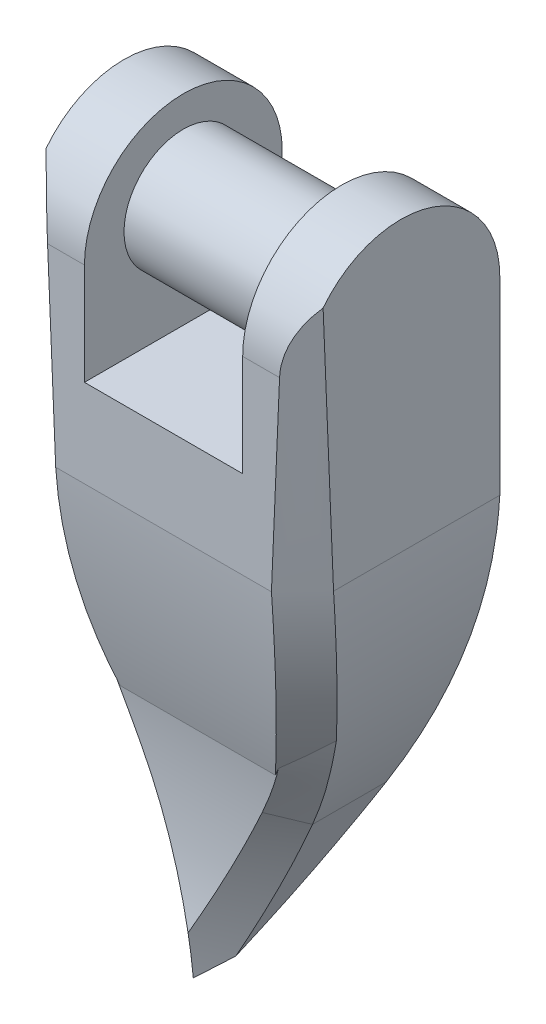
ISO-10303-21;
HEADER;
FILE_DESCRIPTION(('STEP AP214'),'2;1');
FILE_NAME('part.step','',(''),(''),'','','');
FILE_SCHEMA(('AUTOMOTIVE_DESIGN { 1 0 10303 214 1 1 1 1 }'));
ENDSEC;
DATA;
#1=APPLICATION_CONTEXT('core data for automotive mechanical design processes');
#2=APPLICATION_PROTOCOL_DEFINITION('international standard','automotive_design',2000,#1);
#3=PRODUCT_CONTEXT('',#1,'mechanical');
#4=PRODUCT('Part','Part','',(#3));
#5=PRODUCT_RELATED_PRODUCT_CATEGORY('part','',(#4));
#6=PRODUCT_DEFINITION_FORMATION('','',#4);
#7=PRODUCT_DEFINITION_CONTEXT('part definition',#1,'design');
#8=PRODUCT_DEFINITION('design','',#6,#7);
#9=PRODUCT_DEFINITION_SHAPE('','',#8);
#10=(LENGTH_UNIT() NAMED_UNIT(*) SI_UNIT(.MILLI.,.METRE.));
#11=(NAMED_UNIT(*) PLANE_ANGLE_UNIT() SI_UNIT($,.RADIAN.));
#12=(NAMED_UNIT(*) SI_UNIT($,.STERADIAN.) SOLID_ANGLE_UNIT());
#13=UNCERTAINTY_MEASURE_WITH_UNIT(LENGTH_MEASURE(1.E-05),#10,'distance_accuracy_value','');
#14=(GEOMETRIC_REPRESENTATION_CONTEXT(3) GLOBAL_UNCERTAINTY_ASSIGNED_CONTEXT((#13)) GLOBAL_UNIT_ASSIGNED_CONTEXT((#10,
#11,#12)) REPRESENTATION_CONTEXT('',''));
#15=CARTESIAN_POINT('',(0.,0.,0.));
#16=DIRECTION('',(0.,0.,1.));
#17=DIRECTION('',(1.,0.,0.));
#18=AXIS2_PLACEMENT_3D('',#15,#16,#17);
#19=CARTESIAN_POINT('',(-56.2067671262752,16.3694966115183,10.));
#20=DIRECTION('',(1.,0.,0.));
#21=DIRECTION('',(0.,0.,-1.));
#22=AXIS2_PLACEMENT_3D('',#19,#20,#21);
#23=PLANE('',#22);
#24=DIRECTION('',(0.,0.,-1.));
#25=VECTOR('',#24,1.);
#26=CARTESIAN_POINT('',(-56.2067671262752,1.78994679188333,10.));
#27=LINE('',#26,#25);
#28=CARTESIAN_POINT('',(-56.2067671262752,1.78994679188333,8.40559123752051));
#29=VERTEX_POINT('',#28);
#30=CARTESIAN_POINT('',(-56.2067671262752,1.78994679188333,0.));
#31=VERTEX_POINT('',#30);
#32=EDGE_CURVE('E196',#29,#31,#27,.T.);
#33=ORIENTED_EDGE('',*,*,#32,.F.);
#34=CARTESIAN_POINT('',(-56.2067671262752,14.456049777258,8.93359753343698));
#35=CARTESIAN_POINT('',(-56.2067671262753,14.3049550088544,8.92746008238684));
#36=CARTESIAN_POINT('',(-56.2067671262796,14.1538603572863,8.92131975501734));
#37=CARTESIAN_POINT('',(-56.2067671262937,13.8517176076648,8.90903522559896));
#38=CARTESIAN_POINT('',(-56.2067671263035,13.7006695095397,8.90289102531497));
#39=CARTESIAN_POINT('',(-56.2067671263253,13.3986198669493,8.89059875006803));
#40=CARTESIAN_POINT('',(-56.2067671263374,13.2476183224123,8.88445067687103));
#41=CARTESIAN_POINT('',(-56.2067671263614,12.9456617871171,8.87215065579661));
#42=CARTESIAN_POINT('',(-56.2067671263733,12.794706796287,8.86599870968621));
#43=CARTESIAN_POINT('',(-56.2067671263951,12.4928433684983,8.85369094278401));
#44=CARTESIAN_POINT('',(-56.206767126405,12.3419349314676,8.84753512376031));
#45=CARTESIAN_POINT('',(-56.2067671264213,12.0401646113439,8.83521961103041));
#46=CARTESIAN_POINT('',(-56.2067671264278,11.8893027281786,8.8290599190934));
#47=CARTESIAN_POINT('',(-56.2067671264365,11.5876255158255,8.81673666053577));
#48=CARTESIAN_POINT('',(-56.2067671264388,11.4368101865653,8.81057309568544));
#49=CARTESIAN_POINT('',(-56.2067671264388,11.1352260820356,8.7982420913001));
#50=CARTESIAN_POINT('',(-56.2067671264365,10.9844573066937,8.79207465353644));
#51=CARTESIAN_POINT('',(-56.2067671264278,10.6829663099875,8.77973590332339));
#52=CARTESIAN_POINT('',(-56.2067671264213,10.5322440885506,8.77356459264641));
#53=CARTESIAN_POINT('',(-56.206767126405,10.2308461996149,8.76121809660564));
#54=CARTESIAN_POINT('',(-56.2067671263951,10.0801705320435,8.75504291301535));
#55=CARTESIAN_POINT('',(-56.2067671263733,9.77886575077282,8.74268867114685));
#56=CARTESIAN_POINT('',(-56.2067671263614,9.6282366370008,8.73650961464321));
#57=CARTESIAN_POINT('',(-56.2067671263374,9.32702496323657,8.72414762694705));
#58=CARTESIAN_POINT('',(-56.2067671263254,9.1764424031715,8.71796469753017));
#59=CARTESIAN_POINT('',(-56.2067671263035,8.87532383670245,8.70559496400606));
#60=CARTESIAN_POINT('',(-56.2067671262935,8.72478783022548,8.69940816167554));
#61=CARTESIAN_POINT('',(-56.2067671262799,8.42376237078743,8.68703068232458));
#62=CARTESIAN_POINT('',(-56.2067671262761,8.27327291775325,8.68084000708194));
#63=CARTESIAN_POINT('',(-56.2067671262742,7.97185379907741,8.6684347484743));
#64=CARTESIAN_POINT('',(-56.206767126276,7.82092413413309,8.66222014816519));
#65=CARTESIAN_POINT('',(-56.2067671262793,7.5191115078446,8.64978704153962));
#66=CARTESIAN_POINT('',(-56.2067671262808,7.36822854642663,8.64356853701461));
#67=CARTESIAN_POINT('',(-56.2067671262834,7.06650932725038,8.63112762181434));
#68=CARTESIAN_POINT('',(-56.2067671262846,6.91567306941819,8.62490521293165));
#69=CARTESIAN_POINT('',(-56.2067671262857,6.61404725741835,8.61245648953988));
#70=CARTESIAN_POINT('',(-56.2067671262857,6.46325770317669,8.60623017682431));
#71=CARTESIAN_POINT('',(-56.2067671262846,6.16172529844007,8.59377364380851));
#72=CARTESIAN_POINT('',(-56.2067671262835,6.01098244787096,8.5875434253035));
#73=CARTESIAN_POINT('',(-56.2067671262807,5.70954345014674,8.57507908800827));
#74=CARTESIAN_POINT('',(-56.206767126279,5.55884730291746,8.56884497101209));
#75=CARTESIAN_POINT('',(-56.2067671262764,5.25750171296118,8.55637280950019));
#76=CARTESIAN_POINT('',(-56.2067671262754,5.10685227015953,8.55013476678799));
#77=CARTESIAN_POINT('',(-56.2067671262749,4.80535609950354,8.53764474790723));
#78=CARTESIAN_POINT('',(-56.2067671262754,4.65450937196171,8.53139276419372));
#79=CARTESIAN_POINT('',(-56.2067671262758,4.35286270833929,8.51888457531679));
#80=CARTESIAN_POINT('',(-56.2067671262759,4.20206277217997,8.51262837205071));
#81=CARTESIAN_POINT('',(-56.2067671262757,3.90050963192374,8.50011316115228));
#82=CARTESIAN_POINT('',(-56.2067671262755,3.74975642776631,8.49385415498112));
#83=CARTESIAN_POINT('',(-56.2067671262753,3.52364438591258,8.48445885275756));
#84=CARTESIAN_POINT('',(-56.2067671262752,3.44828539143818,8.481326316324));
#85=CARTESIAN_POINT('',(-56.2067671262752,3.29751778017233,8.47506341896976));
#86=CARTESIAN_POINT('',(-56.2067671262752,3.22210916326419,8.47193306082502));
#87=CARTESIAN_POINT('',(-56.2067671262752,2.95823164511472,8.46093829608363));
#88=CARTESIAN_POINT('',(-56.2067671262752,2.76976529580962,8.4530129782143));
#89=CARTESIAN_POINT('',(-56.2067671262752,2.51532053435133,8.44255461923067));
#90=CARTESIAN_POINT('',(-56.2067671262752,2.44934869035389,8.4398649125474));
#91=CARTESIAN_POINT('',(-56.2067671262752,2.31741831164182,8.43416252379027));
#92=CARTESIAN_POINT('',(-56.2067671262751,2.25145977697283,8.43114984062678));
#93=CARTESIAN_POINT('',(-56.2067671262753,2.05360451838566,8.42147129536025));
#94=CARTESIAN_POINT('',(-56.2067671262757,1.92173943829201,8.41416534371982));
#95=CARTESIAN_POINT('',(-56.2067671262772,1.78994679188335,8.40559123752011));
#96=B_SPLINE_CURVE_WITH_KNOTS('',3,(#34,#35,#36,#37,#38,#39,#40,#41,#42,#43,#44,#45,#46,#47,#48,
#49,#50,#51,#52,#53,#54,#55,#56,#57,#58,#59,#60,#61,#62,#63,#64,#65,#66,#67,#68,#69,#70,#71,#72,
#73,#74,#75,#76,#77,#78,#79,#80,#81,#82,#83,#84,#85,#86,#87,#88,#89,#90,#91,#92,#93,#94,#95),
.UNSPECIFIED.,.F.,.F.,(4,2,2,2,2,2,2,2,2,2,2,2,2,2,2,2,2,2,2,2,2,2,2,2,2,2,2,2,2,2,4),(0.,
0.453658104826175,0.907177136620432,1.36055709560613,1.8137979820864,2.26689979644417,
2.71986253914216,3.17268621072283,3.62537081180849,4.0779163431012,4.53032280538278,
4.98259019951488,5.4347185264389,5.88670778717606,6.33855798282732,6.79173064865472,
7.2447638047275,7.69765745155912,8.1504115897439,8.60302621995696,9.05550134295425,
9.50783695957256,9.96076565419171,10.4135546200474,10.8662038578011,11.0924760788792,
11.3188967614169,11.8847955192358,12.08287535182,12.2809558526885,12.6771507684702),.UNSPECIFIED.);
#97=CARTESIAN_POINT('',(-56.2067671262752,14.4560497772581,8.93359753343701));
#98=VERTEX_POINT('',#97);
#99=EDGE_CURVE('E555',#29,#98,#96,.F.);
#100=ORIENTED_EDGE('',*,*,#99,.T.);
#101=CARTESIAN_POINT('',(-56.2067671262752,11.3694966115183,5.));
#102=DIRECTION('',(-1.,0.,0.));
#103=DIRECTION('',(0.,0.,1.));
#104=AXIS2_PLACEMENT_3D('',#101,#102,#103);
#105=CIRCLE('',#104,5.);
#106=CARTESIAN_POINT('',(-56.2067671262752,11.3694966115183,0.));
#107=VERTEX_POINT('',#106);
#108=EDGE_CURVE('E220',#98,#107,#105,.T.);
#109=ORIENTED_EDGE('',*,*,#108,.T.);
#110=DIRECTION('',(0.,-1.,0.));
#111=VECTOR('',#110,1.);
#112=CARTESIAN_POINT('',(-56.2067671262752,16.3694966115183,0.));
#113=LINE('',#112,#111);
#114=EDGE_CURVE('E227',#107,#31,#113,.T.);
#115=ORIENTED_EDGE('',*,*,#114,.T.);
#116=EDGE_LOOP('',(#33,#100,#109,#115));
#117=FACE_BOUND('',#116,.T.);
#118=ADVANCED_FACE('F59',(#117),#23,.F.);
#119=CARTESIAN_POINT('',(-42.2067671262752,1.78994679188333,10.));
#120=DIRECTION('',(-1.,0.,0.));
#121=DIRECTION('',(0.,0.,1.));
#122=AXIS2_PLACEMENT_3D('',#119,#120,#121);
#123=PLANE('',#122);
#124=CARTESIAN_POINT('',(-42.2067671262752,11.3694966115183,5.));
#125=DIRECTION('',(-1.,0.,0.));
#126=DIRECTION('',(0.,0.,1.));
#127=AXIS2_PLACEMENT_3D('',#124,#125,#126);
#128=CIRCLE('',#127,5.);
#129=CARTESIAN_POINT('',(-42.2067671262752,14.4558653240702,8.93374226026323));
#130=VERTEX_POINT('',#129);
#131=CARTESIAN_POINT('',(-42.2067671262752,11.3694966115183,0.));
#132=VERTEX_POINT('',#131);
#133=EDGE_CURVE('E306',#130,#132,#128,.T.);
#134=ORIENTED_EDGE('',*,*,#133,.F.);
#135=CARTESIAN_POINT('',(-42.2067671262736,1.78994679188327,8.40572216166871));
#136=CARTESIAN_POINT('',(-42.2067671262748,1.92173727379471,8.41429617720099));
#137=CARTESIAN_POINT('',(-42.2067671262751,2.05360018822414,8.421602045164));
#138=CARTESIAN_POINT('',(-42.2067671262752,2.25145228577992,8.43128058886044));
#139=CARTESIAN_POINT('',(-42.2067671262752,2.31740982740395,8.43429329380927));
#140=CARTESIAN_POINT('',(-42.2067671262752,2.44933825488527,8.4399957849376));
#141=CARTESIAN_POINT('',(-42.2067671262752,2.51530914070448,8.44268557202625));
#142=CARTESIAN_POINT('',(-42.2067671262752,2.76975021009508,8.45314423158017));
#143=CARTESIAN_POINT('',(-42.2067671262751,2.95821382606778,8.46106975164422));
#144=CARTESIAN_POINT('',(-42.2067671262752,3.22208751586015,8.47206481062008));
#145=CARTESIAN_POINT('',(-42.2067671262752,3.29749503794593,8.47519525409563));
#146=CARTESIAN_POINT('',(-42.2067671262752,3.44826046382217,8.48145832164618));
#147=CARTESIAN_POINT('',(-42.2067671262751,3.52361836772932,8.48459094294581));
#148=CARTESIAN_POINT('',(-42.2067671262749,3.74972713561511,8.49398650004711));
#149=CARTESIAN_POINT('',(-42.2067671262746,3.90047815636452,8.50024567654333));
#150=CARTESIAN_POINT('',(-42.2067671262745,4.20202692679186,8.51276122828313));
#151=CARTESIAN_POINT('',(-42.2067671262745,4.35282467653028,8.51901760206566));
#152=CARTESIAN_POINT('',(-42.206767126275,4.65446696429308,8.53152613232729));
#153=CARTESIAN_POINT('',(-42.2067671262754,4.80531150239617,8.53777828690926));
#154=CARTESIAN_POINT('',(-42.2067671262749,5.10680330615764,8.55026864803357));
#155=CARTESIAN_POINT('',(-42.206767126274,5.25745057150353,8.55650686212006));
#156=CARTESIAN_POINT('',(-42.2067671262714,5.55879180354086,8.56897936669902));
#157=CARTESIAN_POINT('',(-42.2067671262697,5.70948577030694,8.57521365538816));
#158=CARTESIAN_POINT('',(-42.2067671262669,6.0109204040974,8.58767833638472));
#159=CARTESIAN_POINT('',(-42.2067671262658,6.16166107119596,8.5939087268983));
#160=CARTESIAN_POINT('',(-42.2067671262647,6.46318910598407,8.60636560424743));
#161=CARTESIAN_POINT('',(-42.2067671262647,6.61397647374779,8.61259208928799));
#162=CARTESIAN_POINT('',(-42.2067671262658,6.91559790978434,8.62504115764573));
#163=CARTESIAN_POINT('',(-42.206767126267,7.0664319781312,8.63126373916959));
#164=CARTESIAN_POINT('',(-42.2067671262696,7.36814681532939,8.64370499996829));
#165=CARTESIAN_POINT('',(-42.2067671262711,7.51902758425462,8.64992367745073));
#166=CARTESIAN_POINT('',(-42.2067671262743,7.82083582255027,8.66235713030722));
#167=CARTESIAN_POINT('',(-42.2067671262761,7.97176329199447,8.66857190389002));
#168=CARTESIAN_POINT('',(-42.2067671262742,8.27317805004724,8.68097750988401));
#169=CARTESIAN_POINT('',(-42.2067671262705,8.42366533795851,8.68716835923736));
#170=CARTESIAN_POINT('',(-42.2067671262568,8.72468646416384,8.69954618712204));
#171=CARTESIAN_POINT('',(-42.2067671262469,8.875220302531,8.70573316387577));
#172=CARTESIAN_POINT('',(-42.206767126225,9.17633452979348,8.7181032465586));
#173=CARTESIAN_POINT('',(-42.206767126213,9.3269149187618,8.72428635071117));
#174=CARTESIAN_POINT('',(-42.206767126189,9.62812224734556,8.73664868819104));
#175=CARTESIAN_POINT('',(-42.2067671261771,9.77874918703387,8.74282791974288));
#176=CARTESIAN_POINT('',(-42.2067671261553,10.0800496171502,8.75518251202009));
#177=CARTESIAN_POINT('',(-42.2067671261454,10.2307231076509,8.76135787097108));
#178=CARTESIAN_POINT('',(-42.2067671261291,10.5321166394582,8.77370471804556));
#179=CARTESIAN_POINT('',(-42.2067671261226,10.6828366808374,8.77987620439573));
#180=CARTESIAN_POINT('',(-42.2067671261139,10.9843233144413,8.79221530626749));
#181=CARTESIAN_POINT('',(-42.2067671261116,11.1350899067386,8.79838292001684));
#182=CARTESIAN_POINT('',(-42.2067671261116,11.436669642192,8.81071427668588));
#183=CARTESIAN_POINT('',(-42.2067671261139,11.5874827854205,8.81687801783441));
#184=CARTESIAN_POINT('',(-42.2067671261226,11.8891556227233,8.82920162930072));
#185=CARTESIAN_POINT('',(-42.2067671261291,12.0400153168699,8.83536149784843));
#186=CARTESIAN_POINT('',(-42.2067671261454,12.3417812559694,8.84767736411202));
#187=CARTESIAN_POINT('',(-42.2067671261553,12.4926875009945,8.85383336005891));
#188=CARTESIAN_POINT('',(-42.2067671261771,12.7945465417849,8.8661414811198));
#189=CARTESIAN_POINT('',(-42.206767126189,12.9454993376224,8.87229360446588));
#190=CARTESIAN_POINT('',(-42.206767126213,13.2474514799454,8.88459398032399));
#191=CARTESIAN_POINT('',(-42.206767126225,13.3984508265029,8.89074223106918));
#192=CARTESIAN_POINT('',(-42.2067671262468,13.7004960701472,8.9030348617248));
#193=CARTESIAN_POINT('',(-42.2067671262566,13.8515419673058,8.90917923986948));
#194=CARTESIAN_POINT('',(-42.2067671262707,14.1536803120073,8.92146412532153));
#195=CARTESIAN_POINT('',(-42.2067671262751,14.304772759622,8.92760463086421));
#196=CARTESIAN_POINT('',(-42.2067671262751,14.4558653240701,8.93374226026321));
#197=B_SPLINE_CURVE_WITH_KNOTS('',3,(#135,#136,#137,#138,#139,#140,#141,#142,#143,#144,#145,
#146,#147,#148,#149,#150,#151,#152,#153,#154,#155,#156,#157,#158,#159,#160,#161,#162,#163,#164,
#165,#166,#167,#168,#169,#170,#171,#172,#173,#174,#175,#176,#177,#178,#179,#180,#181,#182,#183,
#184,#185,#186,#187,#188,#189,#190,#191,#192,#193,#194,#195,#196),.UNSPECIFIED.,.F.,.F.,(4,2,2,
2,2,2,2,2,2,2,2,2,2,2,2,2,2,2,2,2,2,2,2,2,2,2,2,2,2,2,4),(0.,0.396188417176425,
0.594265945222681,0.792342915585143,1.3582335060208,1.58465091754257,1.81091988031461,
2.26356259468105,2.71634502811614,3.16926718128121,3.6215962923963,4.07406490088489,
4.52667300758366,4.97942061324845,5.4323077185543,5.88533432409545,6.3385004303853,
6.79034415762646,7.24232694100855,7.6944487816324,8.14670968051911,8.59910963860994,
9.05164865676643,9.50432673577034,9.95714387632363,10.4101000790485,10.8631953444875,
11.3164296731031,11.7698030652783,12.2233155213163,12.6769670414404),.UNSPECIFIED.);
#198=CARTESIAN_POINT('',(-42.2067671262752,1.78994679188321,8.40572216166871));
#199=VERTEX_POINT('',#198);
#200=EDGE_CURVE('E400',#130,#199,#197,.F.);
#201=ORIENTED_EDGE('',*,*,#200,.T.);
#202=DIRECTION('',(0.,0.,-1.));
#203=VECTOR('',#202,1.);
#204=CARTESIAN_POINT('',(-42.2067671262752,1.78994679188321,10.));
#205=LINE('',#204,#203);
#206=CARTESIAN_POINT('',(-42.2067671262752,1.78994679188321,0.));
#207=VERTEX_POINT('',#206);
#208=EDGE_CURVE('E257',#199,#207,#205,.T.);
#209=ORIENTED_EDGE('',*,*,#208,.T.);
#210=DIRECTION('',(0.,1.,0.));
#211=VECTOR('',#210,1.);
#212=CARTESIAN_POINT('',(-42.2067671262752,1.78994679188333,0.));
#213=LINE('',#212,#211);
#214=EDGE_CURVE('E230',#207,#132,#213,.T.);
#215=ORIENTED_EDGE('',*,*,#214,.T.);
#216=EDGE_LOOP('',(#134,#201,#209,#215));
#217=FACE_BOUND('',#216,.T.);
#218=ADVANCED_FACE('F289',(#217),#123,.F.);
#219=CARTESIAN_POINT('',(-45.2067671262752,8.23234043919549,10.));
#220=DIRECTION('',(1.,0.,0.));
#221=DIRECTION('',(0.,0.,-1.));
#222=AXIS2_PLACEMENT_3D('',#219,#220,#221);
#223=PLANE('',#222);
#224=CARTESIAN_POINT('',(-45.2067671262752,11.8175438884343,5.));
#225=DIRECTION('',(1.,0.,0.));
#226=DIRECTION('',(0.,0.,-1.));
#227=AXIS2_PLACEMENT_3D('',#224,#225,#226);
#228=CIRCLE('',#227,3.);
#229=CARTESIAN_POINT('',(-45.2067671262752,11.8175438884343,2.));
#230=VERTEX_POINT('',#229);
#231=EDGE_CURVE('E347',#230,#230,#228,.F.);
#232=ORIENTED_EDGE('',*,*,#231,.F.);
#233=EDGE_LOOP('',(#232));
#234=FACE_BOUND('',#233,.T.);
#235=DIRECTION('',(0.,-1.,0.));
#236=VECTOR('',#235,1.);
#237=CARTESIAN_POINT('',(-45.2067671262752,8.23234043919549,10.));
#238=LINE('',#237,#236);
#239=CARTESIAN_POINT('',(-45.2067671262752,11.3694966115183,10.));
#240=VERTEX_POINT('',#239);
#241=CARTESIAN_POINT('',(-45.2067671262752,6.23234043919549,10.));
#242=VERTEX_POINT('',#241);
#243=EDGE_CURVE('E251',#240,#242,#238,.T.);
#244=ORIENTED_EDGE('',*,*,#243,.F.);
#245=CARTESIAN_POINT('',(-45.2067671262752,11.3694966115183,5.));
#246=DIRECTION('',(1.,0.,0.));
#247=DIRECTION('',(0.,0.,-1.));
#248=AXIS2_PLACEMENT_3D('',#245,#246,#247);
#249=CIRCLE('',#248,5.);
#250=CARTESIAN_POINT('',(-45.2067671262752,11.3694966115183,0.));
#251=VERTEX_POINT('',#250);
#252=EDGE_CURVE('E315',#251,#240,#249,.T.);
#253=ORIENTED_EDGE('',*,*,#252,.F.);
#254=DIRECTION('',(0.,-1.,0.));
#255=VECTOR('',#254,1.);
#256=CARTESIAN_POINT('',(-45.2067671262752,8.23234043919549,0.));
#257=LINE('',#256,#255);
#258=CARTESIAN_POINT('',(-45.2067671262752,6.23234043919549,0.));
#259=VERTEX_POINT('',#258);
#260=EDGE_CURVE('E238',#251,#259,#257,.T.);
#261=ORIENTED_EDGE('',*,*,#260,.T.);
#262=DIRECTION('',(0.,0.,-1.));
#263=VECTOR('',#262,1.);
#264=CARTESIAN_POINT('',(-45.2067671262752,6.23234043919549,0.));
#265=LINE('',#264,#263);
#266=EDGE_CURVE('E241',#242,#259,#265,.T.);
#267=ORIENTED_EDGE('',*,*,#266,.F.);
#268=EDGE_LOOP('',(#244,#253,#261,#267));
#269=FACE_BOUND('',#268,.T.);
#270=ADVANCED_FACE('F564',(#234,#269),#223,.F.);
#271=CARTESIAN_POINT('',(-53.2067671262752,8.23234043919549,10.));
#272=DIRECTION('',(-1.,0.,0.));
#273=DIRECTION('',(0.,0.,1.));
#274=AXIS2_PLACEMENT_3D('',#271,#272,#273);
#275=PLANE('',#274);
#276=CARTESIAN_POINT('',(-53.2067671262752,11.8175438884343,5.));
#277=DIRECTION('',(-1.,0.,0.));
#278=DIRECTION('',(0.,0.,1.));
#279=AXIS2_PLACEMENT_3D('',#276,#277,#278);
#280=CIRCLE('',#279,3.);
#281=CARTESIAN_POINT('',(-53.2067671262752,11.8175438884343,8.));
#282=VERTEX_POINT('',#281);
#283=EDGE_CURVE('E206',#282,#282,#280,.F.);
#284=ORIENTED_EDGE('',*,*,#283,.F.);
#285=EDGE_LOOP('',(#284));
#286=FACE_BOUND('',#285,.T.);
#287=CARTESIAN_POINT('',(-53.2067671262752,11.3694966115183,5.));
#288=DIRECTION('',(-1.,0.,0.));
#289=DIRECTION('',(0.,0.,1.));
#290=AXIS2_PLACEMENT_3D('',#287,#288,#289);
#291=CIRCLE('',#290,5.);
#292=CARTESIAN_POINT('',(-53.2067671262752,11.3694966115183,10.));
#293=VERTEX_POINT('',#292);
#294=CARTESIAN_POINT('',(-53.2067671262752,11.3694966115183,0.));
#295=VERTEX_POINT('',#294);
#296=EDGE_CURVE('E340',#293,#295,#291,.T.);
#297=ORIENTED_EDGE('',*,*,#296,.F.);
#298=DIRECTION('',(0.,1.,0.));
#299=VECTOR('',#298,1.);
#300=CARTESIAN_POINT('',(-53.2067671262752,8.23234043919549,10.));
#301=LINE('',#300,#299);
#302=CARTESIAN_POINT('',(-53.2067671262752,6.23234043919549,10.));
#303=VERTEX_POINT('',#302);
#304=EDGE_CURVE('E244',#303,#293,#301,.T.);
#305=ORIENTED_EDGE('',*,*,#304,.F.);
#306=DIRECTION('',(0.,0.,1.));
#307=VECTOR('',#306,1.);
#308=CARTESIAN_POINT('',(-53.2067671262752,6.23234043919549,0.));
#309=LINE('',#308,#307);
#310=CARTESIAN_POINT('',(-53.2067671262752,6.23234043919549,0.));
#311=VERTEX_POINT('',#310);
#312=EDGE_CURVE('E314',#311,#303,#309,.T.);
#313=ORIENTED_EDGE('',*,*,#312,.F.);
#314=DIRECTION('',(0.,1.,0.));
#315=VECTOR('',#314,1.);
#316=CARTESIAN_POINT('',(-53.2067671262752,8.23234043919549,0.));
#317=LINE('',#316,#315);
#318=EDGE_CURVE('E248',#311,#295,#317,.T.);
#319=ORIENTED_EDGE('',*,*,#318,.T.);
#320=EDGE_LOOP('',(#297,#305,#313,#319));
#321=FACE_BOUND('',#320,.T.);
#322=ADVANCED_FACE('F339',(#286,#321),#275,.F.);
#323=CARTESIAN_POINT('',(-72.2067671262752,1.78994679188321,10.));
#324=DIRECTION('',(0.,0.,1.));
#325=DIRECTION('',(1.,0.,0.));
#326=AXIS2_PLACEMENT_3D('',#323,#324,#325);
#327=PLANE('',#326);
#328=DIRECTION('',(-1.,0.,0.));
#329=VECTOR('',#328,1.);
#330=CARTESIAN_POINT('',(-32.2067671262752,11.3694966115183,10.));
#331=LINE('',#330,#329);
#332=CARTESIAN_POINT('',(-55.0713400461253,11.3694966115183,10.));
#333=VERTEX_POINT('',#332);
#334=EDGE_CURVE('E335',#293,#333,#331,.T.);
#335=ORIENTED_EDGE('',*,*,#334,.T.);
#336=CARTESIAN_POINT('',(-54.6605144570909,1.78994674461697,10.));
#337=CARTESIAN_POINT('',(-54.6704241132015,1.94640307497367,10.0000020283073));
#338=CARTESIAN_POINT('',(-54.6780961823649,2.10296693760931,10.0000025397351));
#339=CARTESIAN_POINT('',(-54.6886374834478,2.33794238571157,10.0000026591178));
#340=CARTESIAN_POINT('',(-54.6919916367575,2.4163306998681,10.0000025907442));
#341=CARTESIAN_POINT('',(-54.6987782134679,2.57318593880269,10.0000025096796));
#342=CARTESIAN_POINT('',(-54.7022107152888,2.65165285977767,10.0000024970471));
#343=CARTESIAN_POINT('',(-54.7193735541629,3.04481199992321,10.000002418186));
#344=CARTESIAN_POINT('',(-54.732996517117,3.35950920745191,10.0000023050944));
#345=CARTESIAN_POINT('',(-54.7602540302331,3.99022204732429,10.0000021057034));
#346=CARTESIAN_POINT('',(-54.7738883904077,4.30623768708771,10.000002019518));
#347=CARTESIAN_POINT('',(-54.8011198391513,4.93958974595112,10.000001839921));
#348=CARTESIAN_POINT('',(-54.8147165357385,5.25692618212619,10.0000017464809));
#349=CARTESIAN_POINT('',(-54.8418858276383,5.89291919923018,10.0000015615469));
#350=CARTESIAN_POINT('',(-54.8554580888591,6.21157579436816,10.0000014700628));
#351=CARTESIAN_POINT('',(-54.8825749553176,6.85020930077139,10.0000012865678));
#352=CARTESIAN_POINT('',(-54.8961192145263,7.17018622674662,10.0000011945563));
#353=CARTESIAN_POINT('',(-54.9231810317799,7.81146034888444,10.0000010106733));
#354=CARTESIAN_POINT('',(-54.9366982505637,8.13275755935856,10.0000009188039));
#355=CARTESIAN_POINT('',(-54.9637057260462,8.77667226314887,10.0000007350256));
#356=CARTESIAN_POINT('',(-54.9771956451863,9.09928977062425,10.0000006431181));
#357=CARTESIAN_POINT('',(-55.0041485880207,9.74584506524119,10.0000004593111));
#358=CARTESIAN_POINT('',(-55.0176112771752,10.0697828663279,10.0000003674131));
#359=CARTESIAN_POINT('',(-55.0445097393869,10.7189787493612,10.0000001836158));
#360=CARTESIAN_POINT('',(-55.0579451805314,11.0442368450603,10.0000000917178));
#361=CARTESIAN_POINT('',(-55.0713400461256,11.3694966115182,9.99999999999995));
#362=B_SPLINE_CURVE_WITH_KNOTS('',3,(#336,#337,#338,#339,#340,#341,#342,#343,#344,#345,#346,
#347,#348,#349,#350,#351,#352,#353,#354,#355,#356,#357,#358,#359,#360,#361),.UNSPECIFIED.,.F.,
.F.,(4,2,2,2,2,2,2,2,2,2,2,2,4),(0.,0.470259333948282,0.705638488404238,0.941264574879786,
1.8862399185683,2.83516891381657,3.78805162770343,4.74488812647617,5.70567847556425,
6.67042273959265,7.63912098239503,8.61177326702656,9.58837965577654),.UNSPECIFIED.);
#363=CARTESIAN_POINT('',(-54.6605141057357,1.78994679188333,10.));
#364=VERTEX_POINT('',#363);
#365=EDGE_CURVE('E898',#333,#364,#362,.F.);
#366=ORIENTED_EDGE('',*,*,#365,.T.);
#367=DIRECTION('',(-1.,0.,0.));
#368=VECTOR('',#367,1.);
#369=CARTESIAN_POINT('',(-32.2067671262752,1.78994679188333,10.));
#370=LINE('',#369,#368);
#371=CARTESIAN_POINT('',(-43.7529525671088,1.78994679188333,10.));
#372=VERTEX_POINT('',#371);
#373=EDGE_CURVE('E232',#372,#364,#370,.T.);
#374=ORIENTED_EDGE('',*,*,#373,.F.);
#375=CARTESIAN_POINT('',(-43.342097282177,11.3694966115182,9.99999999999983));
#376=CARTESIAN_POINT('',(-43.3554932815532,11.0442434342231,10.0000005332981));
#377=CARTESIAN_POINT('',(-43.3689298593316,10.7189919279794,10.0000010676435));
#378=CARTESIAN_POINT('',(-43.3958305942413,10.0698092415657,10.0000021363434));
#379=CARTESIAN_POINT('',(-43.4092944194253,9.74587804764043,10.000002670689));
#380=CARTESIAN_POINT('',(-43.4362496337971,9.09933598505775,10.0000037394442));
#381=CARTESIAN_POINT('',(-43.4497406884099,8.77672510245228,10.0000042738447));
#382=CARTESIAN_POINT('',(-43.4767504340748,8.13282366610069,10.0000053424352));
#383=CARTESIAN_POINT('',(-43.4902687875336,7.81153309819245,10.0000058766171));
#384=CARTESIAN_POINT('',(-43.5173328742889,7.17027227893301,10.0000069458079));
#385=CARTESIAN_POINT('',(-43.5308782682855,6.85030201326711,10.0000074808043));
#386=CARTESIAN_POINT('',(-43.5579974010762,6.21168184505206,10.0000085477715));
#387=CARTESIAN_POINT('',(-43.5715707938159,5.89303192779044,10.0000090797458));
#388=CARTESIAN_POINT('',(-43.598742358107,5.25705228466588,10.0000101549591));
#389=CARTESIAN_POINT('',(-43.6123401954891,4.93972254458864,10.0000106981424));
#390=CARTESIAN_POINT('',(-43.6395738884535,4.30638389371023,10.0000117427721));
#391=CARTESIAN_POINT('',(-43.653209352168,3.99037496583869,10.0000122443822));
#392=CARTESIAN_POINT('',(-43.680469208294,3.35967557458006,10.0000134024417));
#393=CARTESIAN_POINT('',(-43.6940934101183,3.04498510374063,10.0000140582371));
#394=CARTESIAN_POINT('',(-43.7112574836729,2.65183437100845,10.0000145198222));
#395=CARTESIAN_POINT('',(-43.714690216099,2.57336913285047,10.0000145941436));
#396=CARTESIAN_POINT('',(-43.7214775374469,2.41651723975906,10.0000150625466));
#397=CARTESIAN_POINT('',(-43.7248322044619,2.33813058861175,10.0000154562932));
#398=CARTESIAN_POINT('',(-43.7353760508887,2.1030936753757,10.000014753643));
#399=CARTESIAN_POINT('',(-43.7430487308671,1.94646661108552,10.0000117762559));
#400=CARTESIAN_POINT('',(-43.7529525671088,1.78994674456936,10.));
#401=B_SPLINE_CURVE_WITH_KNOTS('',3,(#375,#376,#377,#378,#379,#380,#381,#382,#383,#384,#385,
#386,#387,#388,#389,#390,#391,#392,#393,#394,#395,#396,#397,#398,#399,#400),.UNSPECIFIED.,.F.,
.F.,(4,2,2,2,2,2,2,2,2,2,2,2,4),(0.,0.976586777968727,1.94921939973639,2.91789792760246,
3.88262242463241,4.84339295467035,5.80020958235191,6.75307237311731,7.70198139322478,
8.64693670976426,8.8825577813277,9.11793202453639,9.58838079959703),.UNSPECIFIED.);
#402=CARTESIAN_POINT('',(-43.3420972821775,11.3694966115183,10.));
#403=VERTEX_POINT('',#402);
#404=EDGE_CURVE('E560',#372,#403,#401,.F.);
#405=ORIENTED_EDGE('',*,*,#404,.T.);
#406=EDGE_CURVE('E355',#403,#240,#331,.T.);
#407=ORIENTED_EDGE('',*,*,#406,.T.);
#408=ORIENTED_EDGE('',*,*,#243,.T.);
#409=DIRECTION('',(1.,0.,0.));
#410=VECTOR('',#409,1.);
#411=CARTESIAN_POINT('',(-53.2067671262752,6.23234043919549,10.));
#412=LINE('',#411,#410);
#413=EDGE_CURVE('E323',#303,#242,#412,.T.);
#414=ORIENTED_EDGE('',*,*,#413,.F.);
#415=ORIENTED_EDGE('',*,*,#304,.T.);
#416=EDGE_LOOP('',(#335,#366,#374,#405,#407,#408,#414,#415));
#417=FACE_BOUND('',#416,.T.);
#418=ADVANCED_FACE('F333',(#417),#327,.T.);
#419=CARTESIAN_POINT('',(-72.2067671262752,1.78994679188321,0.));
#420=DIRECTION('',(0.,0.,1.));
#421=DIRECTION('',(1.,0.,0.));
#422=AXIS2_PLACEMENT_3D('',#419,#420,#421);
#423=PLANE('',#422);
#424=ORIENTED_EDGE('',*,*,#214,.F.);
#425=DIRECTION('',(-1.,0.,0.));
#426=VECTOR('',#425,1.);
#427=CARTESIAN_POINT('',(-32.2067671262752,1.78994679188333,0.));
#428=LINE('',#427,#426);
#429=EDGE_CURVE('E216',#207,#31,#428,.T.);
#430=ORIENTED_EDGE('',*,*,#429,.T.);
#431=ORIENTED_EDGE('',*,*,#114,.F.);
#432=DIRECTION('',(-1.,0.,0.));
#433=VECTOR('',#432,1.);
#434=CARTESIAN_POINT('',(-32.2067671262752,11.3694966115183,0.));
#435=LINE('',#434,#433);
#436=EDGE_CURVE('E344',#295,#107,#435,.T.);
#437=ORIENTED_EDGE('',*,*,#436,.F.);
#438=ORIENTED_EDGE('',*,*,#318,.F.);
#439=DIRECTION('',(-1.,0.,0.));
#440=VECTOR('',#439,1.);
#441=CARTESIAN_POINT('',(-53.2067671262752,6.23234043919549,0.));
#442=LINE('',#441,#440);
#443=EDGE_CURVE('E236',#259,#311,#442,.T.);
#444=ORIENTED_EDGE('',*,*,#443,.F.);
#445=ORIENTED_EDGE('',*,*,#260,.F.);
#446=EDGE_CURVE('E346',#132,#251,#435,.T.);
#447=ORIENTED_EDGE('',*,*,#446,.F.);
#448=EDGE_LOOP('',(#424,#430,#431,#437,#438,#444,#445,#447));
#449=FACE_BOUND('',#448,.T.);
#450=ADVANCED_FACE('F225',(#449),#423,.F.);
#451=CARTESIAN_POINT('',(-26.2067671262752,1.78994679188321,10.));
#452=DIRECTION('',(0.,0.,-1.));
#453=DIRECTION('',(-1.,0.,0.));
#454=AXIS2_PLACEMENT_3D('',#451,#452,#453);
#455=CYLINDRICAL_SURFACE('',#454,30.);
#456=CARTESIAN_POINT('',(-55.2876443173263,-5.57908176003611,7.3114691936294));
#457=CARTESIAN_POINT('',(-55.1807938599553,-6.00074836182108,7.26116216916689));
#458=CARTESIAN_POINT('',(-55.0645144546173,-6.42112881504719,7.21100858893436));
#459=CARTESIAN_POINT('',(-54.875662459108,-7.04987393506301,7.13599601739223));
#460=CARTESIAN_POINT('',(-54.8102588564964,-7.25926986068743,7.11101399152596));
#461=CARTESIAN_POINT('',(-54.7088133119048,-7.57196302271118,7.07370806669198));
#462=CARTESIAN_POINT('',(-54.6744342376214,-7.6759882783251,7.06129731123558));
#463=CARTESIAN_POINT('',(-54.6220240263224,-7.83170455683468,7.04271954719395));
#464=CARTESIAN_POINT('',(-54.6044135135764,-7.88355712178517,7.03653326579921));
#465=CARTESIAN_POINT('',(-54.5689117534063,-7.98715658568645,7.0241733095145));
#466=CARTESIAN_POINT('',(-54.5510206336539,-8.03890312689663,7.01799552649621));
#467=CARTESIAN_POINT('',(-54.528481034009,-8.10352118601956,7.01029144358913));
#468=CARTESIAN_POINT('',(-54.5239644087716,-8.11644131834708,7.00874896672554));
#469=CARTESIAN_POINT('',(-54.5149135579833,-8.14227516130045,7.00566685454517));
#470=CARTESIAN_POINT('',(-54.5103793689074,-8.15518876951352,7.00412604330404));
#471=CARTESIAN_POINT('',(-54.5035649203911,-8.17455427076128,7.00181586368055));
#472=CARTESIAN_POINT('',(-54.5012912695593,-8.181008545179,7.00104512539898));
#473=CARTESIAN_POINT('',(-54.4967394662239,-8.19391577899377,6.99950769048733));
#474=CARTESIAN_POINT('',(-54.4944613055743,-8.20036876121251,6.99874125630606));
#475=CARTESIAN_POINT('',(-54.4876200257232,-8.21972586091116,6.99644946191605));
#476=CARTESIAN_POINT('',(-54.4830501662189,-8.23262796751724,6.99492972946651));
#477=CARTESIAN_POINT('',(-54.4693133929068,-8.27132688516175,6.99040043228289));
#478=CARTESIAN_POINT('',(-54.4601194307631,-8.29711587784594,6.987415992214));
#479=CARTESIAN_POINT('',(-54.441659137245,-8.34867357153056,6.98152067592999));
#480=CARTESIAN_POINT('',(-54.4323928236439,-8.3744422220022,6.97860921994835));
#481=CARTESIAN_POINT('',(-54.4044853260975,-8.4517175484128,6.96998331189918));
#482=CARTESIAN_POINT('',(-54.3857355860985,-8.50319359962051,6.96437731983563));
#483=CARTESIAN_POINT('',(-54.3479463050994,-8.60606383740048,6.95345377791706));
#484=CARTESIAN_POINT('',(-54.3289067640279,-8.65745802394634,6.94813622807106));
#485=CARTESIAN_POINT('',(-54.2713529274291,-8.81151747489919,6.93261505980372));
#486=CARTESIAN_POINT('',(-54.2324034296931,-8.91405963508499,6.92284292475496));
#487=CARTESIAN_POINT('',(-54.153340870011,-9.11881389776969,6.90444292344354));
#488=CARTESIAN_POINT('',(-54.1132278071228,-9.22102599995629,6.89581505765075));
#489=CARTESIAN_POINT('',(-53.9911381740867,-9.52716432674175,6.87163823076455));
#490=CARTESIAN_POINT('',(-53.9074113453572,-9.73059264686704,6.85779608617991));
#491=CARTESIAN_POINT('',(-53.735258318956,-10.1361041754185,6.83461093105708));
#492=CARTESIAN_POINT('',(-53.6468320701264,-10.3381873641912,6.82526791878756));
#493=CARTESIAN_POINT('',(-53.5560371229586,-10.5395880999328,6.81814759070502));
#494=B_SPLINE_CURVE_WITH_KNOTS('',3,(#456,#457,#458,#459,#460,#461,#462,#463,#464,#465,#466,
#467,#468,#469,#470,#471,#472,#473,#474,#475,#476,#477,#478,#479,#480,#481,#482,#483,#484,#485,
#486,#487,#488,#489,#490,#491,#492,#493),.UNSPECIFIED.,.F.,.F.,(4,2,2,2,2,2,2,2,2,2,2,2,2,2,2,2,
2,2,4),(0.,0.00126063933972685,0.00189095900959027,0.00220611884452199,0.00236369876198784,
0.0025212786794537,0.00256067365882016,0.00260006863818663,0.00261976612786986,
0.00263946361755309,0.00267885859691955,0.00275764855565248,0.00283643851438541,
0.00299401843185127,0.00315159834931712,0.00346675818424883,0.00378191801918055,
0.00441223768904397,0.0050425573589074),.UNSPECIFIED.);
#495=CARTESIAN_POINT('',(-53.5560371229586,-10.5395880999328,6.81814759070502));
#496=VERTEX_POINT('',#495);
#497=CARTESIAN_POINT('',(-55.2255588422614,-5.81989731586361,7.28273864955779));
#498=VERTEX_POINT('',#497);
#499=EDGE_CURVE('E551',#496,#498,#494,.F.);
#500=ORIENTED_EDGE('',*,*,#499,.T.);
#501=CARTESIAN_POINT('',(-55.9543269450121,14.332273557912,9.19496993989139));
#502=CARTESIAN_POINT('',(-55.9721136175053,13.4703621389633,9.14073253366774));
#503=CARTESIAN_POINT('',(-55.9899002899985,12.6084507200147,9.08649512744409));
#504=CARTESIAN_POINT('',(-56.0076869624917,11.746539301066,9.03225772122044));
#505=CARTESIAN_POINT('',(-56.0719184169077,8.63399399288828,8.83639492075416));
#506=CARTESIAN_POINT('',(-56.1361498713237,5.52144868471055,8.64053212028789));
#507=CARTESIAN_POINT('',(-56.2003813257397,2.40890337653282,8.44466931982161));
#508=CARTESIAN_POINT('',(-56.2015825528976,2.35069398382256,8.4410063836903));
#509=CARTESIAN_POINT('',(-56.2026142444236,2.29248449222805,8.43734344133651));
#510=CARTESIAN_POINT('',(-56.2043385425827,2.17607806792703,8.43001834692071));
#511=CARTESIAN_POINT('',(-56.2050312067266,2.11787832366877,8.42635654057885));
#512=CARTESIAN_POINT('',(-56.205816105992,2.03058564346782,8.42086269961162));
#513=CARTESIAN_POINT('',(-56.2060353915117,2.00148901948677,8.41903270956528));
#514=CARTESIAN_POINT('',(-56.2063892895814,1.94329817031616,8.41536952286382));
#515=CARTESIAN_POINT('',(-56.2065239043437,1.91420320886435,8.41354440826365));
#516=CARTESIAN_POINT('',(-56.2067084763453,1.85601780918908,8.40986764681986));
#517=CARTESIAN_POINT('',(-56.2067584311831,1.82692892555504,8.40799893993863));
#518=CARTESIAN_POINT('',(-56.2067737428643,1.76875770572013,8.40421276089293));
#519=CARTESIAN_POINT('',(-56.2067390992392,1.73967555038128,8.40229330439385));
#520=CARTESIAN_POINT('',(-56.2065083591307,1.65243944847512,8.39645580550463));
#521=CARTESIAN_POINT('',(-56.2061854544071,1.59429586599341,8.39245863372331));
#522=CARTESIAN_POINT('',(-56.2052019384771,1.4780363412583,8.38425312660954));
#523=CARTESIAN_POINT('',(-56.2045413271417,1.41992039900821,8.3800447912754));
#524=CARTESIAN_POINT('',(-56.2020535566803,1.24561403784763,8.36710281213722));
#525=CARTESIAN_POINT('',(-56.1997204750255,1.12946508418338,8.35805219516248));
#526=CARTESIAN_POINT('',(-56.1907019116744,0.781184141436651,8.32963062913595));
#527=CARTESIAN_POINT('',(-56.1819971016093,0.54921451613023,8.30898956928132));
#528=CARTESIAN_POINT('',(-56.1592209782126,0.0857323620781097,8.26431340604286));
#529=CARTESIAN_POINT('',(-56.1451467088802,-0.145820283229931,8.2402738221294));
#530=CARTESIAN_POINT('',(-56.0948997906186,-0.839610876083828,8.16306966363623));
#531=CARTESIAN_POINT('',(-56.0508005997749,-1.29976829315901,8.10495821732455));
#532=CARTESIAN_POINT('',(-55.9417180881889,-2.21573195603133,7.97557753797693));
#533=CARTESIAN_POINT('',(-55.8767008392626,-2.67169885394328,7.90427620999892));
#534=CARTESIAN_POINT('',(-55.7261085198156,-3.57844888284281,7.74881594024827));
#535=CARTESIAN_POINT('',(-55.6407249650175,-4.02816567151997,7.66484930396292));
#536=CARTESIAN_POINT('',(-55.4500994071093,-4.92093209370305,7.4847275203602));
#537=CARTESIAN_POINT('',(-55.3448188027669,-5.36409444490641,7.38854046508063));
#538=CARTESIAN_POINT('',(-55.1723512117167,-6.02328011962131,7.23553348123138));
#539=CARTESIAN_POINT('',(-55.1125061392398,-6.24182834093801,7.18313769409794));
#540=CARTESIAN_POINT('',(-54.9881157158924,-6.67676054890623,7.07558700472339));
#541=CARTESIAN_POINT('',(-54.9235775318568,-6.89311770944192,7.02043841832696));
#542=CARTESIAN_POINT('',(-54.8232897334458,-7.21601434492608,6.93570428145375));
#543=CARTESIAN_POINT('',(-54.7892803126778,-7.32337334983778,6.90712435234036));
#544=CARTESIAN_POINT('',(-54.7373995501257,-7.48400487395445,6.86375765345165));
#545=CARTESIAN_POINT('',(-54.7199615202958,-7.53748088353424,6.84921928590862));
#546=CARTESIAN_POINT('',(-54.684797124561,-7.64429769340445,6.81997794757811));
#547=CARTESIAN_POINT('',(-54.6670707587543,-7.6976384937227,6.80527497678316));
#548=CARTESIAN_POINT('',(-54.6402653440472,-7.77754861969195,6.78309781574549));
#549=CARTESIAN_POINT('',(-54.6312942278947,-7.80416848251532,6.77568497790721));
#550=CARTESIAN_POINT('',(-54.613280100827,-7.85737457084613,6.76081852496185));
#551=CARTESIAN_POINT('',(-54.6042369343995,-7.88396125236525,6.75336666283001));
#552=CARTESIAN_POINT('',(-54.5860793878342,-7.93709920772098,6.73841527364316));
#553=CARTESIAN_POINT('',(-54.5769636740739,-7.96365440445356,6.73093082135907));
#554=CARTESIAN_POINT('',(-54.5586552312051,-8.01674630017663,6.71597928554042));
#555=CARTESIAN_POINT('',(-54.5494631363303,-8.04328114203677,6.70850506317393));
#556=CARTESIAN_POINT('',(-54.5217724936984,-8.12285432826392,6.68609470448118));
#557=CARTESIAN_POINT('',(-54.5031607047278,-8.17585813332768,6.67116614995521));
#558=CARTESIAN_POINT('',(-54.4656299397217,-8.28178741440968,6.6413320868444));
#559=CARTESIAN_POINT('',(-54.4467207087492,-8.33468528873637,6.62643385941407));
#560=CARTESIAN_POINT('',(-54.4276714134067,-8.38750678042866,6.61155714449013));
#561=B_SPLINE_CURVE_WITH_KNOTS('',3,(#501,#502,#503,#504,#505,#506,#507,#508,#509,#510,#511,
#512,#513,#514,#515,#516,#517,#518,#519,#520,#521,#522,#523,#524,#525,#526,#527,#528,#529,#530,
#531,#532,#533,#534,#535,#536,#537,#538,#539,#540,#541,#542,#543,#544,#545,#546,#547,#548,#549,
#550,#551,#552,#553,#554,#555,#556,#557,#558,#559,#560),.UNSPECIFIED.,.F.,.F.,(4,3,3,2,2,2,2,2,
2,2,2,2,2,2,2,2,2,2,2,2,2,2,2,2,2,2,2,2,4),(0.00984975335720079,0.0122742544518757,
0.0210296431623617,0.0211933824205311,0.0213571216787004,0.0214389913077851,0.0215208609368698,
0.0216027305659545,0.0216846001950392,0.0218483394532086,0.022012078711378,0.0223395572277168,
0.0229945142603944,0.0236494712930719,0.0249593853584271,0.0262692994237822,0.0275792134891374,
0.0288891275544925,0.0295440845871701,0.0301990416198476,0.0305265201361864,0.0306902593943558,
0.0308539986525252,0.0309358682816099,0.0310177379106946,0.0310996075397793,0.031181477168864,
0.0313452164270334,0.0315089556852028),.UNSPECIFIED.);
#562=EDGE_CURVE('E202',#498,#29,#561,.F.);
#563=ORIENTED_EDGE('',*,*,#562,.T.);
#564=ORIENTED_EDGE('',*,*,#32,.T.);
#565=CARTESIAN_POINT('',(-56.2067671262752,1.78994679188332,0.));
#566=CARTESIAN_POINT('',(-56.2067778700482,1.43620041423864,0.020775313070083));
#567=CARTESIAN_POINT('',(-56.2005107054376,1.08274777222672,0.0465993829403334));
#568=CARTESIAN_POINT('',(-56.1755608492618,0.377211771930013,0.108499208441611));
#569=CARTESIAN_POINT('',(-56.1568792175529,0.025128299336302,0.144574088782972));
#570=CARTESIAN_POINT('',(-56.1072416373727,-0.676934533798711,0.227131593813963));
#571=CARTESIAN_POINT('',(-56.076286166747,-1.02691397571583,0.273613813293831));
#572=CARTESIAN_POINT('',(-56.0029627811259,-1.71794759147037,0.376139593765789));
#573=CARTESIAN_POINT('',(-55.9608037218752,-2.0590508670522,0.432001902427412));
#574=CARTESIAN_POINT('',(-55.8650988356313,-2.73783848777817,0.553811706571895));
#575=CARTESIAN_POINT('',(-55.8115531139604,-3.07552286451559,0.619759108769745));
#576=CARTESIAN_POINT('',(-55.6933817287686,-3.74681294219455,0.761643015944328));
#577=CARTESIAN_POINT('',(-55.6287564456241,-4.08041878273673,0.837579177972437));
#578=CARTESIAN_POINT('',(-55.4832708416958,-4.76899260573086,1.0056325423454));
#579=CARTESIAN_POINT('',(-55.40153394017,-5.12357987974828,1.09855227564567));
#580=CARTESIAN_POINT('',(-55.2260453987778,-5.82666606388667,1.29554170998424));
#581=CARTESIAN_POINT('',(-55.1322924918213,-6.17516432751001,1.39961258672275));
#582=CARTESIAN_POINT('',(-54.9332799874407,-6.86548625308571,1.61854225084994));
#583=CARTESIAN_POINT('',(-54.8280184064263,-7.20730875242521,1.73340289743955));
#584=CARTESIAN_POINT('',(-54.6044054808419,-7.89022447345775,1.97577224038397));
#585=CARTESIAN_POINT('',(-54.4858406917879,-8.23117626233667,2.10348227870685));
#586=CARTESIAN_POINT('',(-54.2379367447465,-8.90502323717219,2.36909048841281));
#587=CARTESIAN_POINT('',(-54.1085991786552,-9.23791960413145,2.50698715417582));
#588=CARTESIAN_POINT('',(-53.8397865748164,-9.89518460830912,2.79232788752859));
#589=CARTESIAN_POINT('',(-53.7003170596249,-10.2195577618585,2.93976674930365));
#590=CARTESIAN_POINT('',(-53.5560371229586,-10.5395880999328,3.09172313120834));
#591=B_SPLINE_CURVE_WITH_KNOTS('',3,(#565,#566,#567,#568,#569,#570,#571,#572,#573,#574,#575,
#576,#577,#578,#579,#580,#581,#582,#583,#584,#585,#586,#587,#588,#589,#590),.UNSPECIFIED.,.F.,
.F.,(4,2,2,2,2,2,2,2,2,2,2,2,4),(0.,1.06298023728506,2.12586973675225,3.18871785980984,
4.23299524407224,5.27726296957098,6.3214948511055,7.44776199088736,8.57414799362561,
9.70072844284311,10.8490545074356,11.9972111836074,13.1447466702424),.UNSPECIFIED.);
#592=CARTESIAN_POINT('',(-53.5560371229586,-10.5395880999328,3.09172313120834));
#593=VERTEX_POINT('',#592);
#594=EDGE_CURVE('E200',#31,#593,#591,.T.);
#595=ORIENTED_EDGE('',*,*,#594,.T.);
#596=DIRECTION('',(0.,0.,-1.));
#597=VECTOR('',#596,1.);
#598=CARTESIAN_POINT('',(-53.5560371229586,-10.5395880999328,10.));
#599=LINE('',#598,#597);
#600=EDGE_CURVE('E207',#496,#593,#599,.T.);
#601=ORIENTED_EDGE('',*,*,#600,.F.);
#602=EDGE_LOOP('',(#500,#563,#564,#595,#601));
#603=FACE_BOUND('',#602,.T.);
#604=ADVANCED_FACE('F198',(#603),#455,.T.);
#605=CARTESIAN_POINT('',(-53.5560371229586,-10.5395880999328,10.));
#606=DIRECTION('',(0.911642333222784,0.410984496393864,0.));
#607=DIRECTION('',(-0.410984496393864,0.911642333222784,0.));
#608=AXIS2_PLACEMENT_3D('',#605,#606,#607);
#609=PLANE('',#608);
#610=CARTESIAN_POINT('',(-53.5560371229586,-10.5395880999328,3.09172313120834));
#611=CARTESIAN_POINT('',(-53.4220508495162,-10.8367953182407,3.23282333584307));
#612=CARTESIAN_POINT('',(-53.288913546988,-11.1321193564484,3.37869443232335));
#613=CARTESIAN_POINT('',(-53.0249694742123,-11.7175978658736,3.67923247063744));
#614=CARTESIAN_POINT('',(-52.8941555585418,-12.0077681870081,3.83386225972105));
#615=CARTESIAN_POINT('',(-52.6348320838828,-12.5829973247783,4.15179618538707));
#616=CARTESIAN_POINT('',(-52.5063166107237,-12.8680692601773,4.31507176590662));
#617=CARTESIAN_POINT('',(-52.2515622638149,-13.4331631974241,4.65016933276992));
#618=CARTESIAN_POINT('',(-52.1253188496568,-13.7131952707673,4.8219708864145));
#619=CARTESIAN_POINT('',(-51.8750815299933,-14.2682695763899,5.17399670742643));
#620=CARTESIAN_POINT('',(-51.7510845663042,-14.5433185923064,5.35420810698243));
#621=CARTESIAN_POINT('',(-51.5053131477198,-15.0884866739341,5.72293136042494));
#622=CARTESIAN_POINT('',(-51.3835371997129,-15.3586090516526,5.91143732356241));
#623=CARTESIAN_POINT('',(-51.1422235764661,-15.8938888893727,6.29656183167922));
#624=CARTESIAN_POINT('',(-51.0226852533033,-16.1590477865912,6.49317797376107));
#625=CARTESIAN_POINT('',(-50.7857688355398,-16.6845737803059,6.89447973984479));
#626=CARTESIAN_POINT('',(-50.6683926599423,-16.9449366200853,7.09917206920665));
#627=CARTESIAN_POINT('',(-50.4357679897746,-17.4609426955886,7.51652407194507));
#628=CARTESIAN_POINT('',(-50.3205232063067,-17.7165776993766,7.72919598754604));
#629=CARTESIAN_POINT('',(-50.0921295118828,-18.2231986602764,8.16240853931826));
#630=CARTESIAN_POINT('',(-49.9789860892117,-18.4741724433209,8.38296630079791));
#631=CARTESIAN_POINT('',(-49.7547648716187,-18.9715380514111,8.83185543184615));
#632=CARTESIAN_POINT('',(-49.643694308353,-19.2179138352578,9.06020817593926));
#633=CARTESIAN_POINT('',(-49.42358698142,-19.7061540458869,9.52459505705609));
#634=CARTESIAN_POINT('',(-49.3145591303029,-19.9479987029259,9.76065420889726));
#635=CARTESIAN_POINT('',(-49.2067671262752,-20.1871020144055,10.));
#636=B_SPLINE_CURVE_WITH_KNOTS('',3,(#610,#611,#612,#613,#614,#615,#616,#617,#618,#619,#620,
#621,#622,#623,#624,#625,#626,#627,#628,#629,#630,#631,#632,#633,#634,#635),.UNSPECIFIED.,.F.,
.F.,(4,2,2,2,2,2,2,2,2,2,2,2,4),(0.,1.06567351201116,2.127123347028,3.18526290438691,
4.24097873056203,5.2951290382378,6.34854241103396,7.40164588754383,8.45564291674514,
9.51132900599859,10.5694665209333,11.6307848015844,12.6959804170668),.UNSPECIFIED.);
#637=CARTESIAN_POINT('',(-50.4149462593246,-17.5071292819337,7.55663342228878));
#638=VERTEX_POINT('',#637);
#639=EDGE_CURVE('E219',#593,#638,#636,.T.);
#640=ORIENTED_EDGE('',*,*,#639,.T.);
#641=CARTESIAN_POINT('',(-53.5560371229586,-10.5395880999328,6.81814759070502));
#642=CARTESIAN_POINT('',(-53.3518666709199,-10.9924772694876,6.8013569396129));
#643=CARTESIAN_POINT('',(-53.1479407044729,-11.4448241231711,6.79681071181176));
#644=CARTESIAN_POINT('',(-52.7405833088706,-12.3484208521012,6.81248586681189));
#645=CARTESIAN_POINT('',(-52.5371518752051,-12.7996707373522,6.83270702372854));
#646=CARTESIAN_POINT('',(-52.1307894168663,-13.7010605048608,6.89821101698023));
#647=CARTESIAN_POINT('',(-51.9278683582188,-14.1511782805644,6.94349494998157));
#648=CARTESIAN_POINT('',(-51.6238368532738,-14.8255783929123,7.03044792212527));
#649=CARTESIAN_POINT('',(-51.5224967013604,-15.0503702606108,7.06263115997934));
#650=CARTESIAN_POINT('',(-51.3204356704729,-15.4985803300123,7.13319980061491));
#651=CARTESIAN_POINT('',(-51.2196658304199,-15.7221071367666,7.17159358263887));
#652=CARTESIAN_POINT('',(-50.9182819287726,-16.3906343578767,7.29601012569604));
#653=CARTESIAN_POINT('',(-50.7184112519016,-16.8339858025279,7.39131537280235));
#654=CARTESIAN_POINT('',(-50.3209211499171,-17.7156949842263,7.60630273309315));
#655=CARTESIAN_POINT('',(-50.1232365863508,-18.1541972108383,7.72602327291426));
#656=CARTESIAN_POINT('',(-49.7301800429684,-19.0260719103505,7.98945609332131));
#657=CARTESIAN_POINT('',(-49.5344531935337,-19.460231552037,8.13346749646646));
#658=CARTESIAN_POINT('',(-49.1467349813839,-20.320264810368,8.44402240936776));
#659=CARTESIAN_POINT('',(-48.9545794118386,-20.7465026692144,8.61063463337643));
#660=CARTESIAN_POINT('',(-48.7640960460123,-21.1690312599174,8.78823938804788));
#661=B_SPLINE_CURVE_WITH_KNOTS('',3,(#641,#642,#643,#644,#645,#646,#647,#648,#649,#650,#651,
#652,#653,#654,#655,#656,#657,#658,#659,#660),.UNSPECIFIED.,.F.,.F.,(4,2,2,2,2,2,2,2,2,4),(0.,
0.00148615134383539,0.00297230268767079,0.00445845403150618,0.00520152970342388,
0.00594460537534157,0.00743075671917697,0.00891690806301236,0.0104030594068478,
0.0118892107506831),.UNSPECIFIED.);
#662=EDGE_CURVE('E485',#638,#496,#661,.F.);
#663=ORIENTED_EDGE('',*,*,#662,.T.);
#664=ORIENTED_EDGE('',*,*,#600,.T.);
#665=EDGE_LOOP('',(#640,#663,#664));
#666=FACE_BOUND('',#665,.T.);
#667=ADVANCED_FACE('F602',(#666),#609,.F.);
#668=CARTESIAN_POINT('',(-49.2067671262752,-20.1871020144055,10.));
#669=DIRECTION('',(-0.911642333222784,0.410984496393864,0.));
#670=DIRECTION('',(-0.410984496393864,-0.911642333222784,0.));
#671=AXIS2_PLACEMENT_3D('',#668,#669,#670);
#672=PLANE('',#671);
#673=DIRECTION('',(0.,0.,-1.));
#674=VECTOR('',#673,1.);
#675=CARTESIAN_POINT('',(-44.8574971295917,-10.5395880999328,10.));
#676=LINE('',#675,#674);
#677=CARTESIAN_POINT('',(-44.8574971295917,-10.5395880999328,6.81863706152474));
#678=VERTEX_POINT('',#677);
#679=CARTESIAN_POINT('',(-44.8574971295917,-10.5395880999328,3.09172313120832));
#680=VERTEX_POINT('',#679);
#681=EDGE_CURVE('E260',#678,#680,#676,.T.);
#682=ORIENTED_EDGE('',*,*,#681,.F.);
#683=CARTESIAN_POINT('',(-49.6493551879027,-21.1688471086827,8.78873527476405));
#684=CARTESIAN_POINT('',(-49.4588752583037,-20.7463261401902,8.61113175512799));
#685=CARTESIAN_POINT('',(-49.2667231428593,-20.3200959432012,8.44452056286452));
#686=CARTESIAN_POINT('',(-48.8790119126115,-19.460078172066,8.13396734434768));
#687=CARTESIAN_POINT('',(-48.6832885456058,-19.0259262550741,7.9899565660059));
#688=CARTESIAN_POINT('',(-48.2902389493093,-18.154066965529,7.72652460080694));
#689=CARTESIAN_POINT('',(-48.0925578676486,-17.7155724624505,7.60680429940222));
#690=CARTESIAN_POINT('',(-47.6950747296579,-16.8338787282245,7.39181704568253));
#691=CARTESIAN_POINT('',(-47.4952075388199,-16.3905350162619,7.29651166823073));
#692=CARTESIAN_POINT('',(-47.1938288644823,-15.7220193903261,7.17209466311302));
#693=CARTESIAN_POINT('',(-47.0930607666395,-15.4984964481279,7.13370068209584));
#694=CARTESIAN_POINT('',(-46.8910032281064,-15.0502941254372,7.06313155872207));
#695=CARTESIAN_POINT('',(-46.7896648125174,-14.8255061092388,7.03094803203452));
#696=CARTESIAN_POINT('',(-46.4856384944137,-14.1511175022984,6.94399406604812));
#697=CARTESIAN_POINT('',(-46.2827208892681,-13.7010073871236,6.89870930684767));
#698=CARTESIAN_POINT('',(-45.8763653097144,-12.7996328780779,6.83320333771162));
#699=CARTESIAN_POINT('',(-45.6729373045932,-12.3483905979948,6.81298103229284));
#700=CARTESIAN_POINT('',(-45.2655867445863,-11.4448090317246,6.7973032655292));
#701=CARTESIAN_POINT('',(-45.0616641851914,-10.9924697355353,6.80184803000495));
#702=CARTESIAN_POINT('',(-44.8574971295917,-10.5395880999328,6.81863706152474));
#703=B_SPLINE_CURVE_WITH_KNOTS('',3,(#683,#684,#685,#686,#687,#688,#689,#690,#691,#692,#693,
#694,#695,#696,#697,#698,#699,#700,#701,#702),.UNSPECIFIED.,.F.,.F.,(4,2,2,2,2,2,2,2,2,4),(0.,
0.00148612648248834,0.00297225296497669,0.00445837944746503,0.00594450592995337,
0.00668756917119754,0.00743063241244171,0.00891675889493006,0.0104028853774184,
0.0118890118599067),.UNSPECIFIED.);
#704=CARTESIAN_POINT('',(-47.999006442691,-17.5080574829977,7.55740102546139));
#705=VERTEX_POINT('',#704);
#706=EDGE_CURVE('E788',#678,#705,#703,.F.);
#707=ORIENTED_EDGE('',*,*,#706,.T.);
#708=CARTESIAN_POINT('',(-49.2067671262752,-20.1871020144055,10.));
#709=CARTESIAN_POINT('',(-49.0989751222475,-19.9479987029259,9.76065420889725));
#710=CARTESIAN_POINT('',(-48.9899472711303,-19.7061540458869,9.52459505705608));
#711=CARTESIAN_POINT('',(-48.7698399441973,-19.2179138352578,9.06020817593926));
#712=CARTESIAN_POINT('',(-48.6587693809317,-18.9715380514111,8.83185543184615));
#713=CARTESIAN_POINT('',(-48.4345481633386,-18.4741724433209,8.38296630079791));
#714=CARTESIAN_POINT('',(-48.3214047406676,-18.2231986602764,8.16240853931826));
#715=CARTESIAN_POINT('',(-48.0930110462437,-17.7165776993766,7.72919598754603));
#716=CARTESIAN_POINT('',(-47.9777662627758,-17.4609426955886,7.51652407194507));
#717=CARTESIAN_POINT('',(-47.745141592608,-16.9449366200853,7.09917206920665));
#718=CARTESIAN_POINT('',(-47.6277654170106,-16.6845737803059,6.89447973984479));
#719=CARTESIAN_POINT('',(-47.3908489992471,-16.1590477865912,6.49317797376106));
#720=CARTESIAN_POINT('',(-47.2713106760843,-15.8938888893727,6.29656183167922));
#721=CARTESIAN_POINT('',(-47.0299970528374,-15.3586090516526,5.91143732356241));
#722=CARTESIAN_POINT('',(-46.9082211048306,-15.0884866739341,5.72293136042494));
#723=CARTESIAN_POINT('',(-46.6624496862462,-14.5433185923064,5.35420810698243));
#724=CARTESIAN_POINT('',(-46.5384527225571,-14.2682695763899,5.17399670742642));
#725=CARTESIAN_POINT('',(-46.2882154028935,-13.7131952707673,4.8219708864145));
#726=CARTESIAN_POINT('',(-46.1619719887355,-13.4331631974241,4.65016933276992));
#727=CARTESIAN_POINT('',(-45.9072176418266,-12.8680692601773,4.31507176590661));
#728=CARTESIAN_POINT('',(-45.7787021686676,-12.5829973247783,4.15179618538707));
#729=CARTESIAN_POINT('',(-45.5193786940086,-12.0077681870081,3.83386225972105));
#730=CARTESIAN_POINT('',(-45.388564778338,-11.7175978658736,3.67923247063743));
#731=CARTESIAN_POINT('',(-45.1246207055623,-11.1321193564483,3.37869443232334));
#732=CARTESIAN_POINT('',(-44.9914834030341,-10.8367953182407,3.23282333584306));
#733=CARTESIAN_POINT('',(-44.8574971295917,-10.5395880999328,3.09172313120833));
#734=B_SPLINE_CURVE_WITH_KNOTS('',3,(#708,#709,#710,#711,#712,#713,#714,#715,#716,#717,#718,
#719,#720,#721,#722,#723,#724,#725,#726,#727,#728,#729,#730,#731,#732,#733),.UNSPECIFIED.,.F.,
.F.,(4,2,2,2,2,2,2,2,2,2,2,2,4),(0.,1.06519561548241,2.12651389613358,3.18465141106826,
4.24033750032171,5.29433452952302,6.34743800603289,7.40085137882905,8.45500168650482,
9.51071751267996,10.5688570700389,11.6303069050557,12.6959804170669),.UNSPECIFIED.);
#735=EDGE_CURVE('E231',#705,#680,#734,.T.);
#736=ORIENTED_EDGE('',*,*,#735,.T.);
#737=EDGE_LOOP('',(#682,#707,#736));
#738=FACE_BOUND('',#737,.T.);
#739=ADVANCED_FACE('F288',(#738),#672,.F.);
#740=CARTESIAN_POINT('',(-72.2067671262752,1.78994679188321,10.));
#741=DIRECTION('',(0.,0.,-1.));
#742=DIRECTION('',(-1.,0.,0.));
#743=AXIS2_PLACEMENT_3D('',#740,#741,#742);
#744=CYLINDRICAL_SURFACE('',#743,30.);
#745=ORIENTED_EDGE('',*,*,#208,.F.);
#746=CARTESIAN_POINT('',(-43.9858940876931,-8.38759342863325,6.61166222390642));
#747=CARTESIAN_POINT('',(-43.9668388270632,-8.33475589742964,6.62654349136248));
#748=CARTESIAN_POINT('',(-43.9479309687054,-8.28186211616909,6.64144060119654));
#749=CARTESIAN_POINT('',(-43.9104101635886,-8.17596201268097,6.67126651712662));
#750=CARTESIAN_POINT('',(-43.8917972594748,-8.12295581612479,6.68619578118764));
#751=CARTESIAN_POINT('',(-43.8640990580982,-8.04336170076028,6.70861208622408));
#752=CARTESIAN_POINT('',(-43.8549033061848,-8.01681655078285,6.71608923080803));
#753=CARTESIAN_POINT('',(-43.8365853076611,-7.96369728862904,6.7310485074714));
#754=CARTESIAN_POINT('',(-43.8274637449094,-7.93712517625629,6.73853774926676));
#755=CARTESIAN_POINT('',(-43.8092921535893,-7.88394615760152,6.75350071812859));
#756=CARTESIAN_POINT('',(-43.8002405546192,-7.8573346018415,6.76095954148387));
#757=CARTESIAN_POINT('',(-43.7822123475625,-7.80408654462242,6.77583765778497));
#758=CARTESIAN_POINT('',(-43.7732345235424,-7.77744648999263,6.78325606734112));
#759=CARTESIAN_POINT('',(-43.746411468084,-7.6974826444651,6.80544793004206));
#760=CARTESIAN_POINT('',(-43.7286754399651,-7.64411162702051,6.82015901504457));
#761=CARTESIAN_POINT('',(-43.6934965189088,-7.53724804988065,6.84941265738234));
#762=CARTESIAN_POINT('',(-43.6760534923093,-7.48375509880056,6.86395532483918));
#763=CARTESIAN_POINT('',(-43.624164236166,-7.32309227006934,6.90732953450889));
#764=CARTESIAN_POINT('',(-43.5901578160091,-7.2157384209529,6.93590728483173));
#765=CARTESIAN_POINT('',(-43.4899025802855,-6.89293691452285,7.02061469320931));
#766=CARTESIAN_POINT('',(-43.4254175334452,-6.67674937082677,7.07571852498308));
#767=CARTESIAN_POINT('',(-43.3011830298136,-6.24237766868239,7.18313342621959));
#768=CARTESIAN_POINT('',(-43.2414335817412,-6.02419351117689,7.23544450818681));
#769=CARTESIAN_POINT('',(-43.0693498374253,-5.36660709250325,7.38810201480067));
#770=CARTESIAN_POINT('',(-42.96417674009,-4.92416302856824,7.48417302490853));
#771=CARTESIAN_POINT('',(-42.821063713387,-4.25427872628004,7.61937642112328));
#772=CARTESIAN_POINT('',(-42.7757831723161,-4.02982492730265,7.66297999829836));
#773=CARTESIAN_POINT('',(-42.6902925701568,-3.5794340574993,7.74704356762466));
#774=CARTESIAN_POINT('',(-42.6500934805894,-3.35357812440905,7.78749121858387));
#775=CARTESIAN_POINT('',(-42.5372054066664,-2.67410731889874,7.90401200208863));
#776=CARTESIAN_POINT('',(-42.472162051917,-2.21833486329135,7.97531759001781));
#777=CARTESIAN_POINT('',(-42.3902063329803,-1.53060559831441,8.07249461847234));
#778=CARTESIAN_POINT('',(-42.365483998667,-1.30058493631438,8.10326720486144));
#779=CARTESIAN_POINT('',(-42.3213655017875,-0.839934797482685,8.16142962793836));
#780=CARTESIAN_POINT('',(-42.3019580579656,-0.609236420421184,8.18883117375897));
#781=CARTESIAN_POINT('',(-42.2684779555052,-0.147181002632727,8.24025853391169));
#782=CARTESIAN_POINT('',(-42.2543991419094,0.0842239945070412,8.26429147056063));
#783=CARTESIAN_POINT('',(-42.2315987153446,0.547724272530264,8.30898431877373));
#784=CARTESIAN_POINT('',(-42.2228759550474,0.779836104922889,8.32964605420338));
#785=CARTESIAN_POINT('',(-42.2138338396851,1.12852330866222,8.35810902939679));
#786=CARTESIAN_POINT('',(-42.2114936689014,1.24485837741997,8.36717626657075));
#787=CARTESIAN_POINT('',(-42.2089985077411,1.41945317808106,8.38014172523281));
#788=CARTESIAN_POINT('',(-42.2083361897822,1.47765040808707,8.3843564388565));
#789=CARTESIAN_POINT('',(-42.207350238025,1.5940538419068,8.39257286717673));
#790=CARTESIAN_POINT('',(-42.2070266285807,1.65225819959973,8.39657444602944));
#791=CARTESIAN_POINT('',(-42.2067953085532,1.73956867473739,8.40241715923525));
#792=CARTESIAN_POINT('',(-42.2067605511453,1.7686728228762,8.40433812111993));
#793=CARTESIAN_POINT('',(-42.2067757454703,1.82688242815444,8.40812687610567));
#794=CARTESIAN_POINT('',(-42.2068256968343,1.85598774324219,8.40999665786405));
#795=CARTESIAN_POINT('',(-42.2070103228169,1.91420024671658,8.41367514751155));
#796=CARTESIAN_POINT('',(-42.2071449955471,1.94330621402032,8.415500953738));
#797=CARTESIAN_POINT('',(-42.2074990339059,2.00151475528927,8.41916526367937));
#798=CARTESIAN_POINT('',(-42.2077184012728,2.03061790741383,8.42099566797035));
#799=CARTESIAN_POINT('',(-42.2085035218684,2.11792338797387,8.42649032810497));
#800=CARTESIAN_POINT('',(-42.2091962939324,2.17612216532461,8.43015208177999));
#801=CARTESIAN_POINT('',(-42.2109204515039,2.29250974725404,8.43747600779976));
#802=CARTESIAN_POINT('',(-42.2119518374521,2.35069858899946,8.44113765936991));
#803=CARTESIAN_POINT('',(-42.2131524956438,2.40888248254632,8.44479899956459));
#804=CARTESIAN_POINT('',(-42.2951666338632,6.3832874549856,8.69489654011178));
#805=CARTESIAN_POINT('',(-42.3771807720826,10.3576924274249,8.94499408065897));
#806=CARTESIAN_POINT('',(-42.459194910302,14.3320973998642,9.19509162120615));
#807=B_SPLINE_CURVE_WITH_KNOTS('',3,(#746,#747,#748,#749,#750,#751,#752,#753,#754,#755,#756,
#757,#758,#759,#760,#761,#762,#763,#764,#765,#766,#767,#768,#769,#770,#771,#772,#773,#774,#775,
#776,#777,#778,#779,#780,#781,#782,#783,#784,#785,#786,#787,#788,#789,#790,#791,#792,#793,#794,
#795,#796,#797,#798,#799,#800,#801,#802,#803,#804,#805,#806),.UNSPECIFIED.,.F.,.F.,(4,2,2,2,2,2,
2,2,2,2,2,2,2,2,2,2,2,2,2,2,2,2,2,2,2,2,2,2,3,4),(0.001960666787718,0.00212448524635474,
0.00228830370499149,0.00237021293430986,0.00245212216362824,0.00253403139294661,
0.00261594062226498,0.00277975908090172,0.00294357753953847,0.00327121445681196,
0.00392648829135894,0.00458176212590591,0.00589230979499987,0.00654758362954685,
0.00720285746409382,0.00851340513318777,0.00916867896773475,0.00982395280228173,
0.0104792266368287,0.0111345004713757,0.0114621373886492,0.0116259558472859,0.0117897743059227,
0.011871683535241,0.0119535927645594,0.0120355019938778,0.0121174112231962,0.0122812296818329,
0.0124450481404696,0.0236351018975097),.UNSPECIFIED.);
#808=CARTESIAN_POINT('',(-43.1871436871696,-5.81672498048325,7.28360637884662));
#809=VERTEX_POINT('',#808);
#810=EDGE_CURVE('E1078',#199,#809,#807,.F.);
#811=ORIENTED_EDGE('',*,*,#810,.T.);
#812=CARTESIAN_POINT('',(-44.8574971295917,-10.5395880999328,6.81863706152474));
#813=CARTESIAN_POINT('',(-44.7666423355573,-10.3380546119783,6.82576157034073));
#814=CARTESIAN_POINT('',(-44.6781593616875,-10.1358377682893,6.83511177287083));
#815=CARTESIAN_POINT('',(-44.5058990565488,-9.73005716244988,6.85831743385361));
#816=CARTESIAN_POINT('',(-44.4221216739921,-9.52649342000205,6.87217289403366));
#817=CARTESIAN_POINT('',(-44.2999607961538,-9.2201506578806,6.89637436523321));
#818=CARTESIAN_POINT('',(-44.2598247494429,-9.11787019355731,6.90501122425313));
#819=CARTESIAN_POINT('',(-44.1807177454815,-8.91297877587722,6.92343078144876));
#820=CARTESIAN_POINT('',(-44.1417467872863,-8.81036782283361,6.93321347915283));
#821=CARTESIAN_POINT('',(-44.0841618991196,-8.65620486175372,6.94875167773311));
#822=CARTESIAN_POINT('',(-44.065112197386,-8.60477611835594,6.95407510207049));
#823=CARTESIAN_POINT('',(-44.0273029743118,-8.50183666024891,6.96501078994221));
#824=CARTESIAN_POINT('',(-44.0085434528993,-8.45032594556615,6.97062305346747));
#825=CARTESIAN_POINT('',(-43.9806215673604,-8.37299854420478,6.97925866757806));
#826=CARTESIAN_POINT('',(-43.9713505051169,-8.3472125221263,6.98217340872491));
#827=CARTESIAN_POINT('',(-43.9528808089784,-8.29562005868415,6.98807539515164));
#828=CARTESIAN_POINT('',(-43.9436821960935,-8.26981367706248,6.99106332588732));
#829=CARTESIAN_POINT('',(-43.9299385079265,-8.23108862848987,6.99559761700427));
#830=CARTESIAN_POINT('',(-43.9253663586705,-8.21817781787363,6.99711913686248));
#831=CARTESIAN_POINT('',(-43.9185216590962,-8.19880764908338,6.99941353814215));
#832=CARTESIAN_POINT('',(-43.9162423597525,-8.19235030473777,7.00018078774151));
#833=CARTESIAN_POINT('',(-43.9116882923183,-8.17943436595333,7.00172010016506));
#834=CARTESIAN_POINT('',(-43.9094134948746,-8.17297568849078,7.0024912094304));
#835=CARTESIAN_POINT('',(-43.9025956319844,-8.15359702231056,7.00480304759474));
#836=CARTESIAN_POINT('',(-43.8980591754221,-8.14067462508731,7.00634487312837));
#837=CARTESIAN_POINT('',(-43.8890038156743,-8.11482320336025,7.00942910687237));
#838=CARTESIAN_POINT('',(-43.8844849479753,-8.10189427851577,7.01097265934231));
#839=CARTESIAN_POINT('',(-43.8619341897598,-8.03723222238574,7.01868197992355));
#840=CARTESIAN_POINT('',(-43.8440343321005,-7.98545042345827,7.02486407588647));
#841=CARTESIAN_POINT('',(-43.8085154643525,-7.88178029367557,7.03723256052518));
#842=CARTESIAN_POINT('',(-43.7908965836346,-7.82989232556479,7.04342311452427));
#843=CARTESIAN_POINT('',(-43.738461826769,-7.67406962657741,7.06201372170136));
#844=CARTESIAN_POINT('',(-43.7040672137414,-7.56997339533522,7.07443304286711));
#845=CARTESIAN_POINT('',(-43.602576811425,-7.25706494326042,7.11176494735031));
#846=CARTESIAN_POINT('',(-43.5371472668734,-7.04752736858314,7.13676406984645));
#847=CARTESIAN_POINT('',(-43.3482286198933,-6.41836258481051,7.21182730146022));
#848=CARTESIAN_POINT('',(-43.2319161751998,-5.99769808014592,7.26201516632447));
#849=CARTESIAN_POINT('',(-43.1250451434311,-5.57574710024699,7.31235651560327));
#850=B_SPLINE_CURVE_WITH_KNOTS('',3,(#812,#813,#814,#815,#816,#817,#818,#819,#820,#821,#822,
#823,#824,#825,#826,#827,#828,#829,#830,#831,#832,#833,#834,#835,#836,#837,#838,#839,#840,#841,
#842,#843,#844,#845,#846,#847,#848,#849),.UNSPECIFIED.,.F.,.F.,(4,2,2,2,2,2,2,2,2,2,2,2,2,2,2,2,
2,2,4),(0.,0.000630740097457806,0.00126148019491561,0.00157685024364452,0.00189222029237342,
0.00204990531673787,0.00220759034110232,0.00228643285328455,0.00236527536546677,
0.00240469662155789,0.00242440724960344,0.002444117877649,0.00248353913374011,
0.00252296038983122,0.00268064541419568,0.00283833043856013,0.00315370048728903,
0.00378444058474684,0.00504592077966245),.UNSPECIFIED.);
#851=EDGE_CURVE('E270',#809,#678,#850,.F.);
#852=ORIENTED_EDGE('',*,*,#851,.T.);
#853=ORIENTED_EDGE('',*,*,#681,.T.);
#854=CARTESIAN_POINT('',(-44.8574971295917,-10.5395880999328,3.09172313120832));
#855=CARTESIAN_POINT('',(-44.7236552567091,-10.2427084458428,2.95076178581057));
#856=CARTESIAN_POINT('',(-44.5939534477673,-9.94209560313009,2.81368644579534));
#857=CARTESIAN_POINT('',(-44.3432428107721,-9.33355549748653,2.5477219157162));
#858=CARTESIAN_POINT('',(-44.222237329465,-9.02562547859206,2.41883587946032));
#859=CARTESIAN_POINT('',(-43.9894246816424,-8.40280206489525,2.1697612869));
#860=CARTESIAN_POINT('',(-43.8776183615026,-8.08790803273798,2.04957353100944));
#861=CARTESIAN_POINT('',(-43.6655603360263,-7.45712175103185,1.82036329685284));
#862=CARTESIAN_POINT('',(-43.5651403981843,-7.1413438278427,1.71118199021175));
#863=CARTESIAN_POINT('',(-43.3740895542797,-6.50387057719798,1.50201655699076));
#864=CARTESIAN_POINT('',(-43.2834576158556,-6.18217587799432,1.40203146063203));
#865=CARTESIAN_POINT('',(-43.1123954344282,-5.53331114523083,1.21156562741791));
#866=CARTESIAN_POINT('',(-43.0319650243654,-5.20614120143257,1.12108473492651));
#867=CARTESIAN_POINT('',(-42.876089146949,-4.52221216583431,0.943490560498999));
#868=CARTESIAN_POINT('',(-42.801464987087,-4.16506854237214,0.857133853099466));
#869=CARTESIAN_POINT('',(-42.6649076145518,-3.44575426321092,0.695934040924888));
#870=CARTESIAN_POINT('',(-42.6029755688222,-3.08358314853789,0.621091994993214));
#871=CARTESIAN_POINT('',(-42.4922088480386,-2.35502496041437,0.48307676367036));
#872=CARTESIAN_POINT('',(-42.4433745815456,-1.98863775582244,0.419903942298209));
#873=CARTESIAN_POINT('',(-42.3583385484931,-1.24548603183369,0.304185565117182));
#874=CARTESIAN_POINT('',(-42.3223951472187,-0.868656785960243,0.251865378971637));
#875=CARTESIAN_POINT('',(-42.2647438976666,-0.112418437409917,0.159342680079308));
#876=CARTESIAN_POINT('',(-42.2430365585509,0.266990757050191,0.11914060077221));
#877=CARTESIAN_POINT('',(-42.214040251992,1.02746827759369,0.050666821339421));
#878=CARTESIAN_POINT('',(-42.2067525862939,1.40853675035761,0.0223961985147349));
#879=CARTESIAN_POINT('',(-42.2067671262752,1.78994679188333,0.));
#880=B_SPLINE_CURVE_WITH_KNOTS('',3,(#854,#855,#856,#857,#858,#859,#860,#861,#862,#863,#864,
#865,#866,#867,#868,#869,#870,#871,#872,#873,#874,#875,#876,#877,#878,#879),.UNSPECIFIED.,.F.,
.F.,(4,2,2,2,2,2,2,2,2,2,2,2,4),(0.,1.0645234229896,2.12945435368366,3.19448315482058,
4.24083665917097,5.28707969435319,6.33330559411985,7.45769215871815,8.58218205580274,
9.70670702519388,10.8526537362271,11.998641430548,13.144732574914),.UNSPECIFIED.);
#881=EDGE_CURVE('E297',#680,#207,#880,.T.);
#882=ORIENTED_EDGE('',*,*,#881,.T.);
#883=EDGE_LOOP('',(#745,#811,#852,#853,#882));
#884=FACE_BOUND('',#883,.T.);
#885=ADVANCED_FACE('F277',(#884),#744,.T.);
#886=CARTESIAN_POINT('',(0.,6.23234043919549,0.));
#887=DIRECTION('',(0.,1.,0.));
#888=DIRECTION('',(0.,0.,1.));
#889=AXIS2_PLACEMENT_3D('',#886,#887,#888);
#890=PLANE('',#889);
#891=ORIENTED_EDGE('',*,*,#312,.T.);
#892=ORIENTED_EDGE('',*,*,#413,.T.);
#893=ORIENTED_EDGE('',*,*,#266,.T.);
#894=ORIENTED_EDGE('',*,*,#443,.T.);
#895=EDGE_LOOP('',(#891,#892,#893,#894));
#896=FACE_BOUND('',#895,.T.);
#897=ADVANCED_FACE('F287',(#896),#890,.T.);
#898=CARTESIAN_POINT('',(-53.2067671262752,11.8175438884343,5.));
#899=DIRECTION('',(1.,0.,0.));
#900=DIRECTION('',(0.,0.,-1.));
#901=AXIS2_PLACEMENT_3D('',#898,#899,#900);
#902=CYLINDRICAL_SURFACE('',#901,3.);
#903=ORIENTED_EDGE('',*,*,#283,.T.);
#904=EDGE_LOOP('',(#903));
#905=FACE_BOUND('',#904,.T.);
#906=ORIENTED_EDGE('',*,*,#231,.T.);
#907=EDGE_LOOP('',(#906));
#908=FACE_BOUND('',#907,.T.);
#909=ADVANCED_FACE('F385',(#905,#908),#902,.T.);
#910=CARTESIAN_POINT('',(-32.2067671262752,11.3694966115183,5.));
#911=DIRECTION('',(-1.,0.,0.));
#912=DIRECTION('',(0.,0.,1.));
#913=AXIS2_PLACEMENT_3D('',#910,#911,#912);
#914=CYLINDRICAL_SURFACE('',#913,5.);
#915=ORIENTED_EDGE('',*,*,#108,.F.);
#916=CARTESIAN_POINT('',(-55.0713400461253,11.3694966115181,10.0000000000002));
#917=CARTESIAN_POINT('',(-55.0737757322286,11.4287476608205,10.0000046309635));
#918=CARTESIAN_POINT('',(-55.0772160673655,11.487960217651,9.99895027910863));
#919=CARTESIAN_POINT('',(-55.0860820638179,11.6062708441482,9.99474511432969));
#920=CARTESIAN_POINT('',(-55.0915113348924,11.6653685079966,9.99159048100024));
#921=CARTESIAN_POINT('',(-55.1011298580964,11.7538340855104,9.98529560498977));
#922=CARTESIAN_POINT('',(-55.1045886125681,11.7833401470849,9.98293171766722));
#923=CARTESIAN_POINT('',(-55.1119522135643,11.8419422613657,9.97771542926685));
#924=CARTESIAN_POINT('',(-55.1158521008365,11.8710394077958,9.97486830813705));
#925=CARTESIAN_POINT('',(-55.1282770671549,11.9582870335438,9.96555944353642));
#926=CARTESIAN_POINT('',(-55.1375127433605,12.0162588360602,9.9583398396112));
#927=CARTESIAN_POINT('',(-55.1578836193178,12.1319032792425,9.94188076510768));
#928=CARTESIAN_POINT('',(-55.1690287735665,12.1895726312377,9.93263063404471));
#929=CARTESIAN_POINT('',(-55.192909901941,12.303236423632,9.91237471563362));
#930=CARTESIAN_POINT('',(-55.2056162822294,12.3592427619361,9.90140074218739));
#931=CARTESIAN_POINT('',(-55.2327643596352,12.4706861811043,9.87759156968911));
#932=CARTESIAN_POINT('',(-55.2472129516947,12.5261199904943,9.86474893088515));
#933=CARTESIAN_POINT('',(-55.2778431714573,12.6364384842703,9.83720450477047));
#934=CARTESIAN_POINT('',(-55.2940352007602,12.6913174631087,9.82249145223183));
#935=CARTESIAN_POINT('',(-55.3281481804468,12.8005461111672,9.79121029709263));
#936=CARTESIAN_POINT('',(-55.3460826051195,12.8548873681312,9.77462754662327));
#937=CARTESIAN_POINT('',(-55.3836766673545,12.9630595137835,9.73961073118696));
#938=CARTESIAN_POINT('',(-55.403352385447,13.0168791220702,9.72115911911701));
#939=CARTESIAN_POINT('',(-55.4434219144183,13.1213973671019,9.68335459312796));
#940=CARTESIAN_POINT('',(-55.4637621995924,13.1721377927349,9.66406030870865));
#941=CARTESIAN_POINT('',(-55.5059063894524,13.2728661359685,9.62388555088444));
#942=CARTESIAN_POINT('',(-55.5277199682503,13.3228457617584,9.60299444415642));
#943=CARTESIAN_POINT('',(-55.5728081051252,13.4220613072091,9.55962881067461));
#944=CARTESIAN_POINT('',(-55.5960939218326,13.4712866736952,9.53714186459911));
#945=CARTESIAN_POINT('',(-55.6441251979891,13.5690007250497,9.49058596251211));
#946=CARTESIAN_POINT('',(-55.6688832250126,13.6174765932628,9.46650309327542));
#947=CARTESIAN_POINT('',(-55.7198572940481,13.7136978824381,9.41675711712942));
#948=CARTESIAN_POINT('',(-55.746086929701,13.7614282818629,9.39107890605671));
#949=CARTESIAN_POINT('',(-55.7987974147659,13.8540405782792,9.33932707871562));
#950=CARTESIAN_POINT('',(-55.8252428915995,13.8989646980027,9.3132929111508));
#951=CARTESIAN_POINT('',(-55.8793702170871,13.9879514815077,9.25987362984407));
#952=CARTESIAN_POINT('',(-55.9070611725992,14.0320024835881,9.23247832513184));
#953=CARTESIAN_POINT('',(-55.9636784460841,14.1192422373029,9.17633798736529));
#954=CARTESIAN_POINT('',(-55.9926144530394,14.1624176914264,9.14758207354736));
#955=CARTESIAN_POINT('',(-56.0517213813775,14.2479035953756,9.08872113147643));
#956=CARTESIAN_POINT('',(-56.0819024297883,14.2901991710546,9.0586046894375));
#957=CARTESIAN_POINT('',(-56.1434995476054,14.3739229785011,8.99702282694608));
#958=CARTESIAN_POINT('',(-56.1749260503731,14.4153348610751,8.96554560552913));
#959=CARTESIAN_POINT('',(-56.2067671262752,14.456049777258,8.93359753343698));
#960=B_SPLINE_CURVE_WITH_KNOTS('',3,(#916,#917,#918,#919,#920,#921,#922,#923,#924,#925,#926,
#927,#928,#929,#930,#931,#932,#933,#934,#935,#936,#937,#938,#939,#940,#941,#942,#943,#944,#945,
#946,#947,#948,#949,#950,#951,#952,#953,#954,#955,#956,#957,#958,#959),.UNSPECIFIED.,.F.,.F.,(4,
2,2,2,2,2,2,2,2,2,2,2,2,2,2,2,2,2,2,2,2,4),(0.,0.177891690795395,0.35610785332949,
0.445506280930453,0.533984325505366,0.711348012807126,0.889666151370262,1.06501374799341,
1.24107959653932,1.41826112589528,1.59694240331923,1.7774922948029,1.95136016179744,
2.12650824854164,2.30321250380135,2.48173747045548,2.66233577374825,2.8371106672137,
3.01348664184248,3.19165357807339,3.37179356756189,3.55408090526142),.UNSPECIFIED.);
#961=EDGE_CURVE('E367',#98,#333,#960,.F.);
#962=ORIENTED_EDGE('',*,*,#961,.T.);
#963=ORIENTED_EDGE('',*,*,#334,.F.);
#964=ORIENTED_EDGE('',*,*,#296,.T.);
#965=ORIENTED_EDGE('',*,*,#436,.T.);
#966=EDGE_LOOP('',(#915,#962,#963,#964,#965));
#967=FACE_BOUND('',#966,.T.);
#968=ADVANCED_FACE('F381',(#967),#914,.T.);
#969=ORIENTED_EDGE('',*,*,#406,.F.);
#970=CARTESIAN_POINT('',(-42.2067671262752,14.4558653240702,8.93374226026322));
#971=CARTESIAN_POINT('',(-42.2385080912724,14.4152763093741,8.96558845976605));
#972=CARTESIAN_POINT('',(-42.2698370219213,14.3739946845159,8.9969667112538));
#973=CARTESIAN_POINT('',(-42.3312470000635,14.2905368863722,9.05835942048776));
#974=CARTESIAN_POINT('',(-42.3613383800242,14.2483769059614,9.08838556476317));
#975=CARTESIAN_POINT('',(-42.4202739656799,14.1631676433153,9.14707468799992));
#976=CARTESIAN_POINT('',(-42.4491282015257,14.1201330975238,9.17574897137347));
#977=CARTESIAN_POINT('',(-42.5055899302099,14.0331805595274,9.23173482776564));
#978=CARTESIAN_POINT('',(-42.5332070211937,13.9892757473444,9.2590571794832));
#979=CARTESIAN_POINT('',(-42.5871945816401,13.9005867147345,9.31233929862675));
#980=CARTESIAN_POINT('',(-42.6135740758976,13.8558140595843,9.33830916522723));
#981=CARTESIAN_POINT('',(-42.666359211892,13.763163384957,9.39013622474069));
#982=CARTESIAN_POINT('',(-42.6927213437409,13.7152333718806,9.41594489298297));
#983=CARTESIAN_POINT('',(-42.743947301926,13.6186060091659,9.46593762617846));
#984=CARTESIAN_POINT('',(-42.7688249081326,13.569923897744,9.49013700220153));
#985=CARTESIAN_POINT('',(-42.8170822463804,13.4717904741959,9.53691176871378));
#986=CARTESIAN_POINT('',(-42.8404747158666,13.4223521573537,9.55950126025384));
#987=CARTESIAN_POINT('',(-42.8857630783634,13.3227038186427,9.60305785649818));
#988=CARTESIAN_POINT('',(-42.9076703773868,13.2725044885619,9.62403754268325));
#989=CARTESIAN_POINT('',(-42.9499889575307,13.1713297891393,9.66437536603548));
#990=CARTESIAN_POINT('',(-42.9704100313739,13.1203628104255,9.68374426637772));
#991=CARTESIAN_POINT('',(-43.0105616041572,13.015556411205,9.72162110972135));
#992=CARTESIAN_POINT('',(-43.0302431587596,12.9616788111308,9.74007544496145));
#993=CARTESIAN_POINT('',(-43.067845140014,12.8533903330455,9.77509378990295));
#994=CARTESIAN_POINT('',(-43.0857816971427,12.7989907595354,9.79167540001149));
#995=CARTESIAN_POINT('',(-43.1198951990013,12.6896450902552,9.82295037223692));
#996=CARTESIAN_POINT('',(-43.136085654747,12.6347074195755,9.83765842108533));
#997=CARTESIAN_POINT('',(-43.1667089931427,12.524271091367,9.86518894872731));
#998=CARTESIAN_POINT('',(-43.1811522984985,12.4687781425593,9.87802271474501));
#999=CARTESIAN_POINT('',(-43.2082860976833,12.3572159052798,9.90181028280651));
#1000=CARTESIAN_POINT('',(-43.2209834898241,12.3011498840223,9.9127715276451));
#1001=CARTESIAN_POINT('',(-43.2447968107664,12.1875838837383,9.93295892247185));
#1002=CARTESIAN_POINT('',(-43.2558898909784,12.1300747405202,9.94216051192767));
#1003=CARTESIAN_POINT('',(-43.2761673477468,12.014753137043,9.95853403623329));
#1004=CARTESIAN_POINT('',(-43.2853615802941,11.9569439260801,9.96571652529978));
#1005=CARTESIAN_POINT('',(-43.2977323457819,11.8699423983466,9.97497828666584));
#1006=CARTESIAN_POINT('',(-43.3016155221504,11.8409274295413,9.97781115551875));
#1007=CARTESIAN_POINT('',(-43.3089509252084,11.782469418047,9.98300358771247));
#1008=CARTESIAN_POINT('',(-43.312397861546,11.7530252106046,9.98535751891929));
#1009=CARTESIAN_POINT('',(-43.321984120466,11.6647449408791,9.99162591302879));
#1010=CARTESIAN_POINT('',(-43.3273959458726,11.6057715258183,9.99476725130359));
#1011=CARTESIAN_POINT('',(-43.3362353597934,11.4877101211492,9.99895469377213));
#1012=CARTESIAN_POINT('',(-43.3396665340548,11.4286225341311,10.0000045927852));
#1013=CARTESIAN_POINT('',(-43.3420972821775,11.3694966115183,10.0000000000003));
#1014=B_SPLINE_CURVE_WITH_KNOTS('',3,(#970,#971,#972,#973,#974,#975,#976,#977,#978,#979,#980,
#981,#982,#983,#984,#985,#986,#987,#988,#989,#990,#991,#992,#993,#994,#995,#996,#997,#998,#999,
#1000,#1001,#1002,#1003,#1004,#1005,#1006,#1007,#1008,#1009,#1010,#1011,#1012,#1013),
.UNSPECIFIED.,.F.,.F.,(4,2,2,2,2,2,2,2,2,2,2,2,2,2,2,2,2,2,2,2,2,4),(0.,0.181716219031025,
0.361298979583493,0.538920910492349,0.714762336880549,0.889011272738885,1.07042379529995,
1.24974279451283,1.42722414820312,1.60313586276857,1.77775755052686,1.9584710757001,
2.13731272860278,2.31465261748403,2.49087611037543,2.6663819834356,2.8441826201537,
3.02103580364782,3.10925995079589,3.19846822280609,3.37630729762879,3.55382339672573),.UNSPECIFIED.);
#1015=EDGE_CURVE('E1079',#403,#130,#1014,.F.);
#1016=ORIENTED_EDGE('',*,*,#1015,.T.);
#1017=ORIENTED_EDGE('',*,*,#133,.T.);
#1018=ORIENTED_EDGE('',*,*,#446,.T.);
#1019=ORIENTED_EDGE('',*,*,#252,.T.);
#1020=EDGE_LOOP('',(#969,#1016,#1017,#1018,#1019));
#1021=FACE_BOUND('',#1020,.T.);
#1022=ADVANCED_FACE('F372',(#1021),#914,.T.);
#1023=CARTESIAN_POINT('',(-32.2067671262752,-20.1871020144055,10.));
#1024=CARTESIAN_POINT('',(-32.2067671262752,-10.9447051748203,0.748382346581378));
#1025=CARTESIAN_POINT('',(-32.2067671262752,1.78994679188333,0.));
#1026=B_SPLINE_CURVE_WITH_KNOTS('',2,(#1023,#1024,#1025),.UNSPECIFIED.,.F.,.F.,(3,3),(0.,1.),.UNSPECIFIED.);
#1027=DIRECTION('',(-1.,0.,0.));
#1028=VECTOR('',#1027,1.);
#1029=SURFACE_OF_LINEAR_EXTRUSION('',#1026,#1028);
#1030=ORIENTED_EDGE('',*,*,#735,.F.);
#1031=CARTESIAN_POINT('',(-47.9990059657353,-17.5080576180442,7.55740113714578));
#1032=CARTESIAN_POINT('',(-48.050758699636,-17.5548879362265,7.59613015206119));
#1033=CARTESIAN_POINT('',(-48.1024524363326,-17.60165988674,7.63500858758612));
#1034=CARTESIAN_POINT('',(-48.2054449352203,-17.6948382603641,7.71285655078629));
#1035=CARTESIAN_POINT('',(-48.256744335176,-17.7412453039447,7.7518244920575));
#1036=CARTESIAN_POINT('',(-48.3589481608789,-17.8336957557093,7.82984684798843));
#1037=CARTESIAN_POINT('',(-48.4098532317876,-17.8797397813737,7.86889968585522));
#1038=CARTESIAN_POINT('',(-48.5112683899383,-17.9714660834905,7.94708724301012));
#1039=CARTESIAN_POINT('',(-48.5617791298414,-18.0171489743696,7.98622039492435));
#1040=CARTESIAN_POINT('',(-48.6624056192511,-18.1081548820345,8.06456401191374));
#1041=CARTESIAN_POINT('',(-48.7125220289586,-18.1534785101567,8.10377291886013));
#1042=CARTESIAN_POINT('',(-48.8123598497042,-18.2437677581,8.18226350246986));
#1043=CARTESIAN_POINT('',(-48.8620819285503,-18.2887339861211,8.22154363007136));
#1044=CARTESIAN_POINT('',(-48.9611310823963,-18.3783102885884,8.30017213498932));
#1045=CARTESIAN_POINT('',(-49.0104588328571,-18.4229209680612,8.33951897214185));
#1046=CARTESIAN_POINT('',(-49.1087193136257,-18.5117880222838,8.41827640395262));
#1047=CARTESIAN_POINT('',(-49.157652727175,-18.5560449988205,8.45768546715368));
#1048=CARTESIAN_POINT('',(-49.2065232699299,-18.6002475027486,8.49723311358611));
#1049=B_SPLINE_CURVE_WITH_KNOTS('',3,(#1031,#1032,#1033,#1034,#1035,#1036,#1037,#1038,#1039,
#1040,#1041,#1042,#1043,#1044,#1045,#1046,#1047,#1048),.UNSPECIFIED.,.F.,.F.,(4,2,2,2,2,2,2,2,
4),(0.,0.239462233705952,0.477649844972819,0.714563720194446,0.95020465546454,1.18457335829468,
1.41767044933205,1.64949646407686,1.88005185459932),.UNSPECIFIED.);
#1050=CARTESIAN_POINT('',(-49.2065232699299,-18.6002475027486,8.49723311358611));
#1051=VERTEX_POINT('',#1050);
#1052=EDGE_CURVE('E777',#705,#1051,#1049,.T.);
#1053=ORIENTED_EDGE('',*,*,#1052,.T.);
#1054=CARTESIAN_POINT('',(-49.2065232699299,-18.6002475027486,8.49723311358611));
#1055=CARTESIAN_POINT('',(-49.2554288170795,-18.5560091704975,8.45765341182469));
#1056=CARTESIAN_POINT('',(-49.3043973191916,-18.5117162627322,8.41821250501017));
#1057=CARTESIAN_POINT('',(-49.4027287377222,-18.4227765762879,8.33939131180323));
#1058=CARTESIAN_POINT('',(-49.4520923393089,-18.3781291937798,8.30001256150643));
#1059=CARTESIAN_POINT('',(-49.5512139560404,-18.288478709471,8.22132017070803));
#1060=CARTESIAN_POINT('',(-49.6009726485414,-18.2434750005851,8.18200807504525));
#1061=CARTESIAN_POINT('',(-49.7008844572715,-18.1531100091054,8.10345351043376));
#1062=CARTESIAN_POINT('',(-49.7510382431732,-18.1077481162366,8.06421259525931));
#1063=CARTESIAN_POINT('',(-49.8517402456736,-18.0166648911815,7.98580493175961));
#1064=CARTESIAN_POINT('',(-49.9022891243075,-17.9709429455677,7.94663974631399));
#1065=CARTESIAN_POINT('',(-50.0037813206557,-17.8791377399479,7.86838810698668));
#1066=CARTESIAN_POINT('',(-50.0547252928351,-17.8330538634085,7.82930322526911));
#1067=CARTESIAN_POINT('',(-50.1570076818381,-17.7405229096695,7.75121678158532));
#1068=CARTESIAN_POINT('',(-50.2083467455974,-17.6940752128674,7.71221680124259));
#1069=CARTESIAN_POINT('',(-50.3114193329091,-17.600814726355,7.63430477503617));
#1070=CARTESIAN_POINT('',(-50.3631534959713,-17.5540013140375,7.5953943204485));
#1071=CARTESIAN_POINT('',(-50.4149467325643,-17.5071294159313,7.55663353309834));
#1072=B_SPLINE_CURVE_WITH_KNOTS('',3,(#1054,#1055,#1056,#1057,#1058,#1059,#1060,#1061,#1062,
#1063,#1064,#1065,#1066,#1067,#1068,#1069,#1070,#1071),.UNSPECIFIED.,.F.,.F.,(4,2,2,2,2,2,2,2,
4),(0.,0.230733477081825,0.46274045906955,0.696021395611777,0.930576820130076,1.16640735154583,
1.40351369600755,1.64189664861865,1.88155709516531),.UNSPECIFIED.);
#1073=EDGE_CURVE('E986',#1051,#638,#1072,.T.);
#1074=ORIENTED_EDGE('',*,*,#1073,.T.);
#1075=ORIENTED_EDGE('',*,*,#639,.F.);
#1076=ORIENTED_EDGE('',*,*,#594,.F.);
#1077=ORIENTED_EDGE('',*,*,#429,.F.);
#1078=ORIENTED_EDGE('',*,*,#881,.F.);
#1079=EDGE_LOOP('',(#1030,#1053,#1074,#1075,#1076,#1077,#1078));
#1080=FACE_BOUND('',#1079,.T.);
#1081=ADVANCED_FACE('F214',(#1080),#1029,.F.);
#1082=CARTESIAN_POINT('',(-32.2067671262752,1.78994679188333,10.));
#1083=CARTESIAN_POINT('',(-32.2067671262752,-3.14236900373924,9.67276031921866));
#1084=CARTESIAN_POINT('',(-32.2067671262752,-7.87718888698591,8.26678191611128));
#1085=B_SPLINE_CURVE_WITH_KNOTS('',2,(#1082,#1083,#1084),.UNSPECIFIED.,.F.,.F.,(3,3),(0.,1.),.UNSPECIFIED.);
#1086=DIRECTION('',(-1.,0.,0.));
#1087=VECTOR('',#1086,1.);
#1088=SURFACE_OF_LINEAR_EXTRUSION('',#1085,#1087);
#1089=ORIENTED_EDGE('',*,*,#373,.T.);
#1090=CARTESIAN_POINT('',(-54.6605141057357,1.78994679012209,9.99999999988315));
#1091=CARTESIAN_POINT('',(-54.6608915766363,1.68618590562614,9.99311595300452));
#1092=CARTESIAN_POINT('',(-54.6607398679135,1.58244706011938,9.98587081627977));
#1093=CARTESIAN_POINT('',(-54.6593795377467,1.37498074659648,9.97065458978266));
#1094=CARTESIAN_POINT('',(-54.658170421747,1.27125330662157,9.9626831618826));
#1095=CARTESIAN_POINT('',(-54.6546953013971,1.06381025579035,9.94601187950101));
#1096=CARTESIAN_POINT('',(-54.6524286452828,0.960094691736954,9.93731157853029));
#1097=CARTESIAN_POINT('',(-54.6468386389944,0.752675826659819,9.91918018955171));
#1098=CARTESIAN_POINT('',(-54.6435144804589,0.648972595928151,9.90974854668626));
#1099=CARTESIAN_POINT('',(-54.6358096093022,0.441578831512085,9.89015207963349));
#1100=CARTESIAN_POINT('',(-54.6314279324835,0.337888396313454,9.87998659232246));
#1101=CARTESIAN_POINT('',(-54.6216082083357,0.130520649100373,9.85892004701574));
#1102=CARTESIAN_POINT('',(-54.6161690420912,0.0268434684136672,9.84801821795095));
#1103=CARTESIAN_POINT('',(-54.604234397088,-0.180497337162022,9.82547659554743));
#1104=CARTESIAN_POINT('',(-54.597737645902,-0.284160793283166,9.81383592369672));
#1105=CARTESIAN_POINT('',(-54.583688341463,-0.49147375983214,9.78981421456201));
#1106=CARTESIAN_POINT('',(-54.5761343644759,-0.595123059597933,9.7774321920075));
#1107=CARTESIAN_POINT('',(-54.5600350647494,-0.801565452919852,9.75202897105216));
#1108=CARTESIAN_POINT('',(-54.5514966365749,-0.904359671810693,9.73901254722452));
#1109=CARTESIAN_POINT('',(-54.5333853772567,-1.10981782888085,9.71226164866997));
#1110=CARTESIAN_POINT('',(-54.5238120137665,-1.21248167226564,9.69852680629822));
#1111=CARTESIAN_POINT('',(-54.5036313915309,-1.41767912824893,9.67033914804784));
#1112=CARTESIAN_POINT('',(-54.49302345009,-1.5202126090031,9.65588586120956));
#1113=CARTESIAN_POINT('',(-54.4707737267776,-1.72514936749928,9.62626139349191));
#1114=CARTESIAN_POINT('',(-54.4591311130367,-1.82755247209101,9.61108963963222));
#1115=CARTESIAN_POINT('',(-54.4348122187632,-2.03222851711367,9.58002831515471));
#1116=CARTESIAN_POINT('',(-54.4221349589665,-2.13450123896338,9.56413807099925));
#1117=CARTESIAN_POINT('',(-54.3957469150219,-2.33891656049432,9.53163984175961));
#1118=CARTESIAN_POINT('',(-54.3820350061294,-2.4410588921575,9.51503108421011));
#1119=CARTESIAN_POINT('',(-54.353577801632,-2.64521347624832,9.48109590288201));
#1120=CARTESIAN_POINT('',(-54.3388312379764,-2.74722540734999,9.46376860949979));
#1121=CARTESIAN_POINT('',(-54.3083048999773,-2.95111925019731,9.42839642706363));
#1122=CARTESIAN_POINT('',(-54.2925237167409,-3.05300078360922,9.41035057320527));
#1123=CARTESIAN_POINT('',(-54.2600861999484,-3.25564648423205,9.37371982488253));
#1124=CARTESIAN_POINT('',(-54.2434380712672,-3.35641297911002,9.35514054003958));
#1125=CARTESIAN_POINT('',(-54.2091422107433,-3.55772085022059,9.31729669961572));
#1126=CARTESIAN_POINT('',(-54.1914937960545,-3.65826202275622,9.29803167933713));
#1127=CARTESIAN_POINT('',(-54.1551975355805,-3.85911966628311,9.25881848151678));
#1128=CARTESIAN_POINT('',(-54.1365488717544,-3.95943588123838,9.2388697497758));
#1129=CARTESIAN_POINT('',(-54.0982522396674,-4.15984403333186,9.19829123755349));
#1130=CARTESIAN_POINT('',(-54.0786033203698,-4.25993565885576,9.17766081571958));
#1131=CARTESIAN_POINT('',(-54.0383063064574,-4.45989505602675,9.13572102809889));
#1132=CARTESIAN_POINT('',(-54.017657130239,-4.55976245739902,9.11441093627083));
#1133=CARTESIAN_POINT('',(-53.9753597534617,-4.75927383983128,9.0711139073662));
#1134=CARTESIAN_POINT('',(-53.9537103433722,-4.85891738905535,9.04912616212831));
#1135=CARTESIAN_POINT('',(-53.9094125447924,-5.05798147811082,9.00447592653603));
#1136=CARTESIAN_POINT('',(-53.8867628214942,-5.15740152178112,8.98181254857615));
#1137=CARTESIAN_POINT('',(-53.8404648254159,-5.35601910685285,8.93581312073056));
#1138=CARTESIAN_POINT('',(-53.8168150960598,-5.45521608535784,8.91247610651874));
#1139=CARTESIAN_POINT('',(-53.7687220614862,-5.65254251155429,8.8653334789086));
#1140=CARTESIAN_POINT('',(-53.7442853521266,-5.75067460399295,8.8415322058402));
#1141=CARTESIAN_POINT('',(-53.6944435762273,-5.94665212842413,8.79328940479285));
#1142=CARTESIAN_POINT('',(-53.669037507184,-6.04449714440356,8.76884722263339));
#1143=CARTESIAN_POINT('',(-53.617257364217,-6.23990124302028,8.71932604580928));
#1144=CARTESIAN_POINT('',(-53.5908821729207,-6.33745984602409,8.69424632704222));
#1145=CARTESIAN_POINT('',(-53.5371640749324,-6.53229185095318,8.64345350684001));
#1146=CARTESIAN_POINT('',(-53.5098199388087,-6.62956470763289,8.61773961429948));
#1147=CARTESIAN_POINT('',(-53.4543056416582,-6.82332822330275,8.56581525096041));
#1148=CARTESIAN_POINT('',(-53.4261388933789,-6.91982044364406,8.5396069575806));
#1149=CARTESIAN_POINT('',(-53.3688532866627,-7.11250071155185,8.48657661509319));
#1150=CARTESIAN_POINT('',(-53.3397332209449,-7.20868818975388,8.45975380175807));
#1151=CARTESIAN_POINT('',(-53.2806048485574,-7.40054035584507,8.40556024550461));
#1152=CARTESIAN_POINT('',(-53.250597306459,-7.49620541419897,8.37818998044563));
#1153=CARTESIAN_POINT('',(-53.2049157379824,-7.63936762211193,8.33671377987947));
#1154=CARTESIAN_POINT('',(-53.1895766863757,-7.68703292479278,8.32281810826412));
#1155=CARTESIAN_POINT('',(-53.158672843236,-7.7822117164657,8.29489915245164));
#1156=CARTESIAN_POINT('',(-53.1431082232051,-7.82972529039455,8.28087596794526));
#1157=CARTESIAN_POINT('',(-53.1274185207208,-7.87717766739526,8.26678524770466));
#1158=B_SPLINE_CURVE_WITH_KNOTS('',3,(#1090,#1091,#1092,#1093,#1094,#1095,#1096,#1097,#1098,
#1099,#1100,#1101,#1102,#1103,#1104,#1105,#1106,#1107,#1108,#1109,#1110,#1111,#1112,#1113,#1114,
#1115,#1116,#1117,#1118,#1119,#1120,#1121,#1122,#1123,#1124,#1125,#1126,#1127,#1128,#1129,#1130,
#1131,#1132,#1133,#1134,#1135,#1136,#1137,#1138,#1139,#1140,#1141,#1142,#1143,#1144,#1145,#1146,
#1147,#1148,#1149,#1150,#1151,#1152,#1153,#1154,#1155,#1156,#1157),.UNSPECIFIED.,.F.,.F.,(4,2,2,
2,2,2,2,2,2,2,2,2,2,2,2,2,2,2,2,2,2,2,2,2,2,2,2,2,2,2,2,2,2,4),(0.,0.311967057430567,
0.624080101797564,0.936385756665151,1.24893071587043,1.56176172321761,1.87492555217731,
2.18846898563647,2.50243879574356,2.81432989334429,3.12638219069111,3.43864181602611,
3.75115480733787,4.06396709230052,4.37712446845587,4.69067258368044,5.0046569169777,
5.31607557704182,5.62770944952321,5.93960219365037,6.25179723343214,6.56433774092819,
6.8772666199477,7.19062649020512,7.50445967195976,7.81612902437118,8.12812993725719,
8.44050262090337,8.75328694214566,9.06491940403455,9.3769630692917,9.68874531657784,
9.84463948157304,10.000420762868),.UNSPECIFIED.);
#1159=CARTESIAN_POINT('',(-53.1274194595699,-7.87718365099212,8.26678257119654));
#1160=VERTEX_POINT('',#1159);
#1161=EDGE_CURVE('E474',#364,#1160,#1158,.T.);
#1162=ORIENTED_EDGE('',*,*,#1161,.T.);
#1163=DIRECTION('',(-1.,0.,0.));
#1164=VECTOR('',#1163,1.);
#1165=CARTESIAN_POINT('',(-32.2067671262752,-7.87718888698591,8.26678191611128));
#1166=LINE('',#1165,#1164);
#1167=CARTESIAN_POINT('',(-45.2860574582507,-7.87718332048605,8.26678374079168));
#1168=VERTEX_POINT('',#1167);
#1169=EDGE_CURVE('E451',#1168,#1160,#1166,.T.);
#1170=ORIENTED_EDGE('',*,*,#1169,.F.);
#1171=CARTESIAN_POINT('',(-45.2860574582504,-7.8771776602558,8.26678524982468));
#1172=CARTESIAN_POINT('',(-45.2703551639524,-7.82968742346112,8.28088721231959));
#1173=CARTESIAN_POINT('',(-45.2547781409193,-7.78213589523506,8.29492153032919));
#1174=CARTESIAN_POINT('',(-45.2238527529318,-7.68688992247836,8.32285991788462));
#1175=CARTESIAN_POINT('',(-45.2085045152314,-7.63919541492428,8.33676391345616));
#1176=CARTESIAN_POINT('',(-45.1628058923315,-7.49597700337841,8.37825566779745));
#1177=CARTESIAN_POINT('',(-45.1327906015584,-7.40028488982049,8.40563308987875));
#1178=CARTESIAN_POINT('',(-45.0736717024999,-7.20845777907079,8.45981820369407));
#1179=CARTESIAN_POINT('',(-45.0445681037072,-7.11232277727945,8.48662588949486));
#1180=CARTESIAN_POINT('',(-44.9873053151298,-6.91971701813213,8.53963512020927));
#1181=CARTESIAN_POINT('',(-44.9591452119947,-6.82324669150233,8.56583724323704));
#1182=CARTESIAN_POINT('',(-44.9036882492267,-6.62968335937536,8.61770767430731));
#1183=CARTESIAN_POINT('',(-44.8763933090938,-6.5325894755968,8.6433747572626));
#1184=CARTESIAN_POINT('',(-44.8227680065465,-6.33810741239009,8.69407865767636));
#1185=CARTESIAN_POINT('',(-44.7964365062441,-6.24071973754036,8.71911620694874));
#1186=CARTESIAN_POINT('',(-44.7447379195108,-6.04564952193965,8.76855755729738));
#1187=CARTESIAN_POINT('',(-44.7193698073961,-5.94796742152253,8.79296202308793));
#1188=CARTESIAN_POINT('',(-44.6695980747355,-5.75230773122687,8.84113373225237));
#1189=CARTESIAN_POINT('',(-44.6451935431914,-5.65433051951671,8.86490157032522));
#1190=CARTESIAN_POINT('',(-44.5971241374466,-5.45716131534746,8.91201606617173));
#1191=CARTESIAN_POINT('',(-44.5734673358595,-5.35796608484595,8.93535741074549));
#1192=CARTESIAN_POINT('',(-44.527155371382,-5.15935178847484,8.98136556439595));
#1193=CARTESIAN_POINT('',(-44.5044987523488,-5.05993328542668,9.00403333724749));
#1194=CARTESIAN_POINT('',(-44.4601872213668,-4.86087209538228,9.04869241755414));
#1195=CARTESIAN_POINT('',(-44.4385309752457,-4.7612299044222,9.07068461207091));
#1196=CARTESIAN_POINT('',(-44.3962200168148,-4.56172104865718,9.11399059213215));
#1197=CARTESIAN_POINT('',(-44.3755640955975,-4.46185481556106,9.13530518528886));
#1198=CARTESIAN_POINT('',(-44.3352536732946,-4.26189756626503,9.17725402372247));
#1199=CARTESIAN_POINT('',(-44.3155980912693,-4.16180692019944,9.19788899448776));
#1200=CARTESIAN_POINT('',(-44.277288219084,-3.96140053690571,9.23847664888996));
#1201=CARTESIAN_POINT('',(-44.2586329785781,-3.86108511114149,9.2584299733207));
#1202=CARTESIAN_POINT('',(-44.2223236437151,-3.66022885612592,9.2976523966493));
#1203=CARTESIAN_POINT('',(-44.2046687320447,-3.55968828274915,9.31692204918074));
#1204=CARTESIAN_POINT('',(-44.1703599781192,-3.35838141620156,9.35477519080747));
#1205=CARTESIAN_POINT('',(-44.1537054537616,-3.25761532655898,9.373359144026));
#1206=CARTESIAN_POINT('',(-44.1212488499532,-3.05493116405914,9.41000636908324));
#1207=CARTESIAN_POINT('',(-44.1054553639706,-2.95301065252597,9.42806376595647));
#1208=CARTESIAN_POINT('',(-44.0749050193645,-2.74903777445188,9.46345864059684));
#1209=CARTESIAN_POINT('',(-44.0601467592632,-2.64698578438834,9.4807970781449));
#1210=CARTESIAN_POINT('',(-44.0316667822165,-2.44274999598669,9.51475413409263));
#1211=CARTESIAN_POINT('',(-44.0179438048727,-2.34056651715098,9.531373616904));
#1212=CARTESIAN_POINT('',(-43.9915342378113,-2.13606781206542,9.56389286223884));
#1213=CARTESIAN_POINT('',(-43.9788465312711,-2.03375285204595,9.57979339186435));
#1214=CARTESIAN_POINT('',(-43.9545073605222,-1.82899123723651,9.61087483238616));
#1215=CARTESIAN_POINT('',(-43.9428549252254,-1.72654479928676,9.62605641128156));
#1216=CARTESIAN_POINT('',(-43.9205861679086,-1.52152027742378,9.65570005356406));
#1217=CARTESIAN_POINT('',(-43.9099690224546,-1.41894236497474,9.67016268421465));
#1218=CARTESIAN_POINT('',(-43.889770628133,-1.2136549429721,9.69836853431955));
#1219=CARTESIAN_POINT('',(-43.8801887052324,-1.11094556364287,9.71211221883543));
#1220=CARTESIAN_POINT('',(-43.8620608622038,-0.905395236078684,9.73888028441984));
#1221=CARTESIAN_POINT('',(-43.853514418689,-0.802554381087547,9.75190502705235));
#1222=CARTESIAN_POINT('',(-43.8374012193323,-0.596033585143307,9.77732239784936));
#1223=CARTESIAN_POINT('',(-43.8298412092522,-0.492352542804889,9.78971035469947));
#1224=CARTESIAN_POINT('',(-43.81578071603,-0.284973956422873,9.81374371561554));
#1225=CARTESIAN_POINT('',(-43.8092788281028,-0.181276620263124,9.82539009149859));
#1226=CARTESIAN_POINT('',(-43.7973346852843,0.0261340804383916,9.84794286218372));
#1227=CARTESIAN_POINT('',(-43.7918911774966,0.129847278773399,9.85885012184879));
#1228=CARTESIAN_POINT('',(-43.7820635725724,0.337289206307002,9.87992722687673));
#1229=CARTESIAN_POINT('',(-43.777678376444,0.441017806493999,9.89009782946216));
#1230=CARTESIAN_POINT('',(-43.769967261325,0.648490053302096,9.90970418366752));
#1231=CARTESIAN_POINT('',(-43.7666403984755,0.752233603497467,9.91914058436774));
#1232=CARTESIAN_POINT('',(-43.7610457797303,0.959735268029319,9.93728110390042));
#1233=CARTESIAN_POINT('',(-43.7587772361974,1.0634933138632,9.94598576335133));
#1234=CARTESIAN_POINT('',(-43.7552991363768,1.27102349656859,9.96266533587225));
#1235=CARTESIAN_POINT('',(-43.7540889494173,1.37479558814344,9.9706406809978));
#1236=CARTESIAN_POINT('',(-43.75272727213,1.58235338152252,9.98586427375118));
#1237=CARTESIAN_POINT('',(-43.7525753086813,1.68613905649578,9.99311284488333));
#1238=CARTESIAN_POINT('',(-43.7529529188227,1.78994679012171,9.99999999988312));
#1239=B_SPLINE_CURVE_WITH_KNOTS('',3,(#1171,#1172,#1173,#1174,#1175,#1176,#1177,#1178,#1179,
#1180,#1181,#1182,#1183,#1184,#1185,#1186,#1187,#1188,#1189,#1190,#1191,#1192,#1193,#1194,#1195,
#1196,#1197,#1198,#1199,#1200,#1201,#1202,#1203,#1204,#1205,#1206,#1207,#1208,#1209,#1210,#1211,
#1212,#1213,#1214,#1215,#1216,#1217,#1218,#1219,#1220,#1221,#1222,#1223,#1224,#1225,#1226,#1227,
#1228,#1229,#1230,#1231,#1232,#1233,#1234,#1235,#1236,#1237,#1238),.UNSPECIFIED.,.F.,.F.,(4,2,2,
2,2,2,2,2,2,2,2,2,2,2,2,2,2,2,2,2,2,2,2,2,2,2,2,2,2,2,2,2,2,4),(0.,0.155905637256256,
0.311894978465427,0.623764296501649,0.935636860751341,1.24719824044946,1.55940834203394,
1.87123694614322,2.18272367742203,2.49390850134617,2.80774440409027,3.12110722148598,
3.43403927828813,3.74658319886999,4.0587818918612,4.37067853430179,4.68231655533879,
4.99373961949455,5.3078493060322,5.62152520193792,5.93481283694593,6.24775791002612,
6.56040627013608,6.87280389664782,7.18499687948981,7.49703139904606,7.81109892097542,
8.12474601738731,8.43801953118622,8.75096631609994,9.0636332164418,9.37606704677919,
9.68831457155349,10.0004224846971),.UNSPECIFIED.);
#1240=EDGE_CURVE('E464',#1168,#372,#1239,.T.);
#1241=ORIENTED_EDGE('',*,*,#1240,.T.);
#1242=EDGE_LOOP('',(#1089,#1162,#1170,#1241));
#1243=FACE_BOUND('',#1242,.T.);
#1244=ADVANCED_FACE('F429',(#1243),#1088,.F.);
#1245=CARTESIAN_POINT('',(-32.2067671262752,-7.31701658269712,8.33686615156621));
#1246=CARTESIAN_POINT('',(-32.2067671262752,-7.3827027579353,8.3286480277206));
#1247=CARTESIAN_POINT('',(-32.2067671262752,-7.44838893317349,8.32042990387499));
#1248=CARTESIAN_POINT('',(-32.2067671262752,-7.6627889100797,8.29360590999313));
#1249=CARTESIAN_POINT('',(-32.2067671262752,-7.87718888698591,8.26678191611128));
#1250=CARTESIAN_POINT('',(-32.2067671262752,-14.2314064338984,7.47179352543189));
#1251=CARTESIAN_POINT('',(-32.2067671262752,-20.187102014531,10.0000000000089));
#1252=B_SPLINE_CURVE_WITH_KNOTS('',2,(#1245,#1246,#1247,#1248,#1249,#1250,#1251),.UNSPECIFIED.,
.F.,.F.,(3,2,2,3),(-0.0440787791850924,-0.0337413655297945,0.,1.),.UNSPECIFIED.);
#1253=DIRECTION('',(-1.,0.,0.));
#1254=VECTOR('',#1253,1.);
#1255=SURFACE_OF_LINEAR_EXTRUSION('',#1252,#1254);
#1256=CARTESIAN_POINT('',(-49.2066166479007,-16.4923933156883,8.76080185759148));
#1257=CARTESIAN_POINT('',(-49.0829868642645,-16.2322089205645,8.69624688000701));
#1258=CARTESIAN_POINT('',(-48.9588901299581,-15.9711297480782,8.63618567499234));
#1259=CARTESIAN_POINT('',(-48.7083622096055,-15.4441862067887,8.52445335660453));
#1260=CARTESIAN_POINT('',(-48.581921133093,-15.1783025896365,8.47289518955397));
#1261=CARTESIAN_POINT('',(-48.3267029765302,-14.6416996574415,8.37855834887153));
#1262=CARTESIAN_POINT('',(-48.197917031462,-14.3709627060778,8.33590392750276));
#1263=CARTESIAN_POINT('',(-47.9380076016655,-13.8246032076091,8.25975959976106));
#1264=CARTESIAN_POINT('',(-47.8068765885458,-13.5489652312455,8.22640598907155));
#1265=CARTESIAN_POINT('',(-47.5505945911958,-13.0102386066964,8.17105189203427));
#1266=CARTESIAN_POINT('',(-47.4254619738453,-12.7471895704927,8.14857930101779));
#1267=CARTESIAN_POINT('',(-47.1725546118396,-12.2154631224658,8.1122928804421));
#1268=CARTESIAN_POINT('',(-47.0447757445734,-11.9467756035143,8.09865565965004));
#1269=CARTESIAN_POINT('',(-46.7865740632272,-11.4037128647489,8.08050247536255));
#1270=CARTESIAN_POINT('',(-46.6561498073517,-11.1293320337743,8.07617565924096));
#1271=CARTESIAN_POINT('',(-46.3926529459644,-10.5748181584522,8.07710347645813));
#1272=CARTESIAN_POINT('',(-46.2595819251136,-10.2946846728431,8.08256012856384));
#1273=CARTESIAN_POINT('',(-46.1266292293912,-10.0146819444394,8.09294695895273));
#1274=B_SPLINE_CURVE_WITH_KNOTS('',3,(#1256,#1257,#1258,#1259,#1260,#1261,#1262,#1263,#1264,
#1265,#1266,#1267,#1268,#1269,#1270,#1271,#1272,#1273),.UNSPECIFIED.,.F.,.F.,(4,2,2,2,2,2,2,2,
4),(0.,0.885589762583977,1.78213162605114,2.69045296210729,3.61145854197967,4.4878028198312,
5.38116390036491,6.29250930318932,7.22289029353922),.UNSPECIFIED.);
#1275=CARTESIAN_POINT('',(-49.2066166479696,-16.4923933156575,8.76080185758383));
#1276=VERTEX_POINT('',#1275);
#1277=CARTESIAN_POINT('',(-46.1266292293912,-10.0146819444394,8.09294695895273));
#1278=VERTEX_POINT('',#1277);
#1279=EDGE_CURVE('E819',#1276,#1278,#1274,.T.);
#1280=ORIENTED_EDGE('',*,*,#1279,.T.);
#1281=CARTESIAN_POINT('',(-46.1266292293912,-10.0146819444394,8.09294695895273));
#1282=CARTESIAN_POINT('',(-46.112764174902,-9.98548179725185,8.09402946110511));
#1283=CARTESIAN_POINT('',(-46.0989537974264,-9.95625770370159,8.0951663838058));
#1284=CARTESIAN_POINT('',(-46.0714430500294,-9.89776296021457,8.09754938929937));
#1285=CARTESIAN_POINT('',(-46.0577426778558,-9.86849231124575,8.09879546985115));
#1286=CARTESIAN_POINT('',(-46.0304519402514,-9.8099044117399,8.10139716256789));
#1287=CARTESIAN_POINT('',(-46.0168615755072,-9.78058716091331,8.10275277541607));
#1288=CARTESIAN_POINT('',(-45.9897908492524,-9.72190601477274,8.10557390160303));
#1289=CARTESIAN_POINT('',(-45.9763104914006,-9.69254211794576,8.10703941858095));
#1290=CARTESIAN_POINT('',(-45.949459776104,-9.63376763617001,8.11008072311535));
#1291=CARTESIAN_POINT('',(-45.9360894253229,-9.60435704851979,8.11165651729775));
#1292=CARTESIAN_POINT('',(-45.9094587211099,-9.54548914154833,8.11491874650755));
#1293=CARTESIAN_POINT('',(-45.8961983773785,-9.51603181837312,8.11660519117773));
#1294=CARTESIAN_POINT('',(-45.8697876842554,-9.45707039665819,8.12008909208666));
#1295=CARTESIAN_POINT('',(-45.8566373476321,-9.4275662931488,8.12188656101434));
#1296=CARTESIAN_POINT('',(-45.8304466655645,-9.36851126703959,8.12559288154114));
#1297=CARTESIAN_POINT('',(-45.8174063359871,-9.33896033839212,8.1275017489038));
#1298=CARTESIAN_POINT('',(-45.7914356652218,-9.27981161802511,8.13143123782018));
#1299=CARTESIAN_POINT('',(-45.7785053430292,-9.25021381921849,8.13345187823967));
#1300=CARTESIAN_POINT('',(-45.7527546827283,-9.19097131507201,8.13760528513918));
#1301=CARTESIAN_POINT('',(-45.7399343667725,-9.16132660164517,8.13973807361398));
#1302=CARTESIAN_POINT('',(-45.7144037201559,-9.10199022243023,8.14411614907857));
#1303=CARTESIAN_POINT('',(-45.7016934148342,-9.07229854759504,8.14636146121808));
#1304=CARTESIAN_POINT('',(-45.6763827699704,-9.0128682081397,8.15096495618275));
#1305=CARTESIAN_POINT('',(-45.6637824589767,-8.98312953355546,8.1533231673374));
#1306=CARTESIAN_POINT('',(-45.638737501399,-8.92371340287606,8.15814405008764));
#1307=CARTESIAN_POINT('',(-45.6262924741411,-8.89403607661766,8.16060634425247));
#1308=CARTESIAN_POINT('',(-45.6015124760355,-8.83463644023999,8.16564357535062));
#1309=CARTESIAN_POINT('',(-45.5891775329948,-8.80491412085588,8.16821853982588));
#1310=CARTESIAN_POINT('',(-45.5646176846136,-8.74542446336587,8.17348146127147));
#1311=CARTESIAN_POINT('',(-45.5523928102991,-8.71565711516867,8.1761694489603));
#1312=CARTESIAN_POINT('',(-45.5280530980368,-8.65607735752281,8.18165876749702));
#1313=CARTESIAN_POINT('',(-45.5159382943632,-8.62626493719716,8.18446013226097));
#1314=CARTESIAN_POINT('',(-45.4918187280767,-8.56659499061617,8.19017655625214));
#1315=CARTESIAN_POINT('',(-45.4798140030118,-8.53673745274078,8.19309165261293));
#1316=CARTESIAN_POINT('',(-45.455914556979,-8.47697724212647,8.19903588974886));
#1317=CARTESIAN_POINT('',(-45.4440198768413,-8.44707455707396,8.20206507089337));
#1318=CARTESIAN_POINT('',(-45.4203611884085,-8.3872758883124,8.20823247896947));
#1319=CARTESIAN_POINT('',(-45.4085970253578,-8.35737995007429,8.21137055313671));
#1320=CARTESIAN_POINT('',(-45.3851771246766,-8.29753968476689,8.21776140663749));
#1321=CARTESIAN_POINT('',(-45.3735214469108,-8.26759534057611,8.22101424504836));
#1322=CARTESIAN_POINT('',(-45.3503188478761,-8.20765810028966,8.22763502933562));
#1323=CARTESIAN_POINT('',(-45.3387719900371,-8.17766518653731,8.23100303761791));
#1324=CARTESIAN_POINT('',(-45.315799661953,-8.11766773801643,8.23785032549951));
#1325=CARTESIAN_POINT('',(-45.304374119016,-8.08766322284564,8.24132953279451));
#1326=CARTESIAN_POINT('',(-45.287320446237,-8.04261876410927,8.24663520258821));
#1327=CARTESIAN_POINT('',(-45.2816474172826,-8.02759077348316,8.24841907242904));
#1328=CARTESIAN_POINT('',(-45.2691991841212,-7.99454339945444,8.25237216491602));
#1329=CARTESIAN_POINT('',(-45.2624289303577,-7.97652288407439,8.25454753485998));
#1330=CARTESIAN_POINT('',(-45.2455457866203,-7.93141173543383,8.26004271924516));
#1331=CARTESIAN_POINT('',(-45.2354625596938,-7.90431315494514,8.26338838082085));
#1332=CARTESIAN_POINT('',(-45.2254573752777,-7.87719149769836,8.26678158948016));
#1333=B_SPLINE_CURVE_WITH_KNOTS('',3,(#1281,#1282,#1283,#1284,#1285,#1286,#1287,#1288,#1289,
#1290,#1291,#1292,#1293,#1294,#1295,#1296,#1297,#1298,#1299,#1300,#1301,#1302,#1303,#1304,#1305,
#1306,#1307,#1308,#1309,#1310,#1311,#1312,#1313,#1314,#1315,#1316,#1317,#1318,#1319,#1320,#1321,
#1322,#1323,#1324,#1325,#1326,#1327,#1328,#1329,#1330,#1331,#1332),.UNSPECIFIED.,.F.,.F.,(4,2,2,
2,2,2,2,2,2,2,2,2,2,2,2,2,2,2,2,2,2,2,2,2,2,4),(0.,0.0970284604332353,0.194054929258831,
0.291082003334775,0.388112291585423,0.485148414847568,0.582193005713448,0.679248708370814,
0.776318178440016,0.873404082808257,0.970509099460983,1.06763591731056,1.1647872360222,
1.26161227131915,1.35846110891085,1.45533644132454,1.55224097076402,1.64917740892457,
1.74614847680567,1.84298860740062,1.93987933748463,2.03682342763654,2.13370571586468,
2.18219128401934,2.24030975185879,2.32762949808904),.UNSPECIFIED.);
#1334=CARTESIAN_POINT('',(-45.2254573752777,-7.87718888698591,8.26678191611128));
#1335=VERTEX_POINT('',#1334);
#1336=EDGE_CURVE('E1063',#1278,#1335,#1333,.T.);
#1337=ORIENTED_EDGE('',*,*,#1336,.T.);
#1338=CARTESIAN_POINT('',(-45.2254547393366,-7.87718419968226,8.26678250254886));
#1339=CARTESIAN_POINT('',(-45.2229878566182,-7.87028474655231,8.26764570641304));
#1340=CARTESIAN_POINT('',(-45.2205392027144,-7.86337895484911,8.26850970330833));
#1341=CARTESIAN_POINT('',(-45.213904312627,-7.84456379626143,8.2708637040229));
#1342=CARTESIAN_POINT('',(-45.2097416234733,-7.83264625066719,8.27235473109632));
#1343=CARTESIAN_POINT('',(-45.1996779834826,-7.80380781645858,8.27596276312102));
#1344=CARTESIAN_POINT('',(-45.1937805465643,-7.78688574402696,8.27807991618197));
#1345=CARTESIAN_POINT('',(-45.1836638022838,-7.75779450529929,8.28171957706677));
#1346=CARTESIAN_POINT('',(-45.1794390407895,-7.7456272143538,8.2832418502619));
#1347=CARTESIAN_POINT('',(-45.1710881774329,-7.72152573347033,8.28625723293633));
#1348=CARTESIAN_POINT('',(-45.1669617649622,-7.70959164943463,8.287750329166));
#1349=CARTESIAN_POINT('',(-45.1588067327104,-7.68595687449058,8.29070732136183));
#1350=CARTESIAN_POINT('',(-45.1547778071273,-7.67425628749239,8.29217120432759));
#1351=CARTESIAN_POINT('',(-45.1466724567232,-7.65066552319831,8.29512269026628));
#1352=CARTESIAN_POINT('',(-45.1425962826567,-7.63877526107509,8.29661030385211));
#1353=CARTESIAN_POINT('',(-45.1344519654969,-7.61496628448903,8.29958909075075));
#1354=CARTESIAN_POINT('',(-45.1303838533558,-7.60304755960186,8.30108026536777));
#1355=CARTESIAN_POINT('',(-45.1222557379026,-7.57918163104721,8.30406617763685));
#1356=CARTESIAN_POINT('',(-45.118195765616,-7.56723441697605,8.30556091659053));
#1357=CARTESIAN_POINT('',(-45.1100839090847,-7.54331151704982,8.3085539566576));
#1358=CARTESIAN_POINT('',(-45.106032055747,-7.53133582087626,8.31005225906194));
#1359=CARTESIAN_POINT('',(-45.0979364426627,-7.50735595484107,8.31305242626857));
#1360=CARTESIAN_POINT('',(-45.093892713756,-7.49535177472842,8.31455429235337));
#1361=CARTESIAN_POINT('',(-45.0858133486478,-7.47131494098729,8.31756158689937));
#1362=CARTESIAN_POINT('',(-45.0817777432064,-7.45928227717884,8.31906701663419));
#1363=CARTESIAN_POINT('',(-45.0777500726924,-7.44724699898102,8.32057277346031));
#1364=B_SPLINE_CURVE_WITH_KNOTS('',3,(#1338,#1339,#1340,#1341,#1342,#1343,#1344,#1345,#1346,
#1347,#1348,#1349,#1350,#1351,#1352,#1353,#1354,#1355,#1356,#1357,#1358,#1359,#1360,#1361,#1362,
#1363),.UNSPECIFIED.,.F.,.F.,(4,2,2,2,2,2,2,2,2,2,2,2,4),(0.,0.022133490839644,
0.0602674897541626,0.114402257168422,0.153310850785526,0.191456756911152,0.228840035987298,
0.266811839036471,0.304857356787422,0.342976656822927,0.381169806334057,0.419436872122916,
0.457777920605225),.UNSPECIFIED.);
#1365=CARTESIAN_POINT('',(-45.0777500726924,-7.44724699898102,8.32057277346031));
#1366=VERTEX_POINT('',#1365);
#1367=EDGE_CURVE('E72',#1335,#1366,#1364,.T.);
#1368=ORIENTED_EDGE('',*,*,#1367,.T.);
#1369=CARTESIAN_POINT('',(-45.0777500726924,-7.44724699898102,8.32057277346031));
#1370=CARTESIAN_POINT('',(-45.0833945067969,-7.45924051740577,8.3190722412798));
#1371=CARTESIAN_POINT('',(-45.0890502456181,-7.47122879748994,8.31757236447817));
#1372=CARTESIAN_POINT('',(-45.1003867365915,-7.49520003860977,8.31457327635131));
#1373=CARTESIAN_POINT('',(-45.1060674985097,-7.50718299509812,8.313074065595));
#1374=CARTESIAN_POINT('',(-45.1174540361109,-7.53114358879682,8.31007630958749));
#1375=CARTESIAN_POINT('',(-45.1231598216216,-7.54312122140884,8.3085777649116));
#1376=CARTESIAN_POINT('',(-45.1345964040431,-7.56707116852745,8.30558134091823));
#1377=CARTESIAN_POINT('',(-45.1403272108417,-7.57904347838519,8.30408346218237));
#1378=CARTESIAN_POINT('',(-45.1518138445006,-7.60298277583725,8.30108837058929));
#1379=CARTESIAN_POINT('',(-45.1575696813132,-7.61494975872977,8.29959115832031));
#1380=CARTESIAN_POINT('',(-45.1691063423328,-7.63887841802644,8.29659739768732));
#1381=CARTESIAN_POINT('',(-45.1748871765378,-7.65084008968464,8.29510084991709));
#1382=CARTESIAN_POINT('',(-45.186462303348,-7.6747340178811,8.29211143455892));
#1383=CARTESIAN_POINT('',(-45.1922565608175,-7.68666629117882,8.29061856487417));
#1384=CARTESIAN_POINT('',(-45.2038695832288,-7.71052560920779,8.28763347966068));
#1385=CARTESIAN_POINT('',(-45.2096883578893,-7.72245264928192,8.28614126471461));
#1386=CARTESIAN_POINT('',(-45.2213521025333,-7.74630068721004,8.28315759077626));
#1387=CARTESIAN_POINT('',(-45.2271970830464,-7.75822167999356,8.28166613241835));
#1388=CARTESIAN_POINT('',(-45.2404278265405,-7.78515690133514,8.27829621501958));
#1389=CARTESIAN_POINT('',(-45.2478186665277,-7.8001686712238,8.27641806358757));
#1390=CARTESIAN_POINT('',(-45.2610981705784,-7.82707419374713,8.27305186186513));
#1391=CARTESIAN_POINT('',(-45.2669813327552,-7.83897060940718,8.27156347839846));
#1392=CARTESIAN_POINT('',(-45.2772623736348,-7.85963707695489,8.26897785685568));
#1393=CARTESIAN_POINT('',(-45.2816474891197,-7.86841338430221,8.26787983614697));
#1394=CARTESIAN_POINT('',(-45.2860555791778,-7.87717840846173,8.26678322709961));
#1395=B_SPLINE_CURVE_WITH_KNOTS('',3,(#1369,#1370,#1371,#1372,#1373,#1374,#1375,#1376,#1377,
#1378,#1379,#1380,#1381,#1382,#1383,#1384,#1385,#1386,#1387,#1388,#1389,#1390,#1391,#1392,#1393,
#1394),.UNSPECIFIED.,.F.,.F.,(4,2,2,2,2,2,2,2,2,2,2,2,4),(0.,0.0400200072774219,
0.0800573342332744,0.120112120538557,0.160184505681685,0.200274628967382,0.24038262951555,
0.28042796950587,0.320491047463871,0.360572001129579,0.411084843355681,0.451149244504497,
0.480765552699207),.UNSPECIFIED.);
#1396=EDGE_CURVE('E477',#1366,#1168,#1395,.T.);
#1397=ORIENTED_EDGE('',*,*,#1396,.T.);
#1398=ORIENTED_EDGE('',*,*,#1169,.T.);
#1399=CARTESIAN_POINT('',(-53.1274203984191,-7.87717841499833,8.26678322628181));
#1400=CARTESIAN_POINT('',(-53.1318147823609,-7.86844046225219,8.26787644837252));
#1401=CARTESIAN_POINT('',(-53.136186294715,-7.85969127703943,8.26897107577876));
#1402=CARTESIAN_POINT('',(-53.1464381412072,-7.83908339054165,8.27154936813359));
#1403=CARTESIAN_POINT('',(-53.1523057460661,-7.82721845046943,8.27303381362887));
#1404=CARTESIAN_POINT('',(-53.1655521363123,-7.80038021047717,8.27639159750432));
#1405=CARTESIAN_POINT('',(-53.1729254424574,-7.78540425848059,8.27826526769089));
#1406=CARTESIAN_POINT('',(-53.1861233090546,-7.75853648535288,8.28162674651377));
#1407=CARTESIAN_POINT('',(-53.1919529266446,-7.74664711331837,8.28311424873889));
#1408=CARTESIAN_POINT('',(-53.2035860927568,-7.72286233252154,8.28609000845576));
#1409=CARTESIAN_POINT('',(-53.2093896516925,-7.71096692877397,8.28757826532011));
#1410=CARTESIAN_POINT('',(-53.2209723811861,-7.68717089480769,8.29055543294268));
#1411=CARTESIAN_POINT('',(-53.2267515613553,-7.6752702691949,8.29204434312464));
#1412=CARTESIAN_POINT('',(-53.2382965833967,-7.65143983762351,8.2950258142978));
#1413=CARTESIAN_POINT('',(-53.2440623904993,-7.6395100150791,8.29651837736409));
#1414=CARTESIAN_POINT('',(-53.255569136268,-7.61564507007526,8.29950416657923));
#1415=CARTESIAN_POINT('',(-53.2613100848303,-7.6037099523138,8.30099739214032));
#1416=CARTESIAN_POINT('',(-53.2727670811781,-7.57983440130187,8.30398450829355));
#1417=CARTESIAN_POINT('',(-53.2784831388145,-7.5678939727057,8.30547839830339));
#1418=CARTESIAN_POINT('',(-53.2898903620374,-7.54400780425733,8.30846684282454));
#1419=CARTESIAN_POINT('',(-53.2955815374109,-7.53206206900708,8.30996139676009));
#1420=CARTESIAN_POINT('',(-53.3069389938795,-7.50816528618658,8.31295116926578));
#1421=CARTESIAN_POINT('',(-53.3126052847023,-7.49621424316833,8.3144463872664));
#1422=CARTESIAN_POINT('',(-53.3239129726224,-7.47230684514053,8.3174374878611));
#1423=CARTESIAN_POINT('',(-53.3295543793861,-7.46035049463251,8.31893336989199));
#1424=CARTESIAN_POINT('',(-53.3351845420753,-7.44838893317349,8.32042990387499));
#1425=B_SPLINE_CURVE_WITH_KNOTS('',3,(#1399,#1400,#1401,#1402,#1403,#1404,#1405,#1406,#1407,
#1408,#1409,#1410,#1411,#1412,#1413,#1414,#1415,#1416,#1417,#1418,#1419,#1420,#1421,#1422,#1423,
#1424),.UNSPECIFIED.,.F.,.F.,(4,2,2,2,2,2,2,2,2,2,2,2,4),(0.,0.0295247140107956,
0.0694831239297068,0.119875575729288,0.159850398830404,0.199807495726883,0.23974700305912,
0.279748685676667,0.319732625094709,0.359698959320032,0.399647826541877,0.43957936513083,
0.479493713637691),.UNSPECIFIED.);
#1426=CARTESIAN_POINT('',(-53.3351845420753,-7.44838893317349,8.32042990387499));
#1427=VERTEX_POINT('',#1426);
#1428=EDGE_CURVE('E85',#1160,#1427,#1425,.T.);
#1429=ORIENTED_EDGE('',*,*,#1428,.T.);
#1430=CARTESIAN_POINT('',(-53.3351845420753,-7.44838893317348,8.32042990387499));
#1431=CARTESIAN_POINT('',(-53.3311610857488,-7.46040992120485,8.31892593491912));
#1432=CARTESIAN_POINT('',(-53.3271297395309,-7.47242830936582,8.31742229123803));
#1433=CARTESIAN_POINT('',(-53.3190612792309,-7.49642969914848,8.31441943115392));
#1434=CARTESIAN_POINT('',(-53.3150242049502,-7.50841271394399,8.31292021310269));
#1435=CARTESIAN_POINT('',(-53.3069442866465,-7.53234335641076,8.30992620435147));
#1436=CARTESIAN_POINT('',(-53.3029014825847,-7.54429099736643,8.30843141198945));
#1437=CARTESIAN_POINT('',(-53.2948101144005,-7.56815089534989,8.30544625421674));
#1438=CARTESIAN_POINT('',(-53.2907615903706,-7.58006316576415,8.30395588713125));
#1439=CARTESIAN_POINT('',(-53.2826587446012,-7.60385230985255,8.30097958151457));
#1440=CARTESIAN_POINT('',(-53.2786044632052,-7.61572919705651,8.29949364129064));
#1441=CARTESIAN_POINT('',(-53.2704902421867,-7.63944762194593,8.2965261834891));
#1442=CARTESIAN_POINT('',(-53.2664303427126,-7.65128917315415,8.29504466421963));
#1443=CARTESIAN_POINT('',(-53.2583942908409,-7.6746750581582,8.29211881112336));
#1444=CARTESIAN_POINT('',(-53.254418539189,-7.68621952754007,8.29067446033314));
#1445=CARTESIAN_POINT('',(-53.2463273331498,-7.70966636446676,8.28774098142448));
#1446=CARTESIAN_POINT('',(-53.2422114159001,-7.72156857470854,8.28625187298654));
#1447=CARTESIAN_POINT('',(-53.2338392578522,-7.74573068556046,8.28322890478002));
#1448=CARTESIAN_POINT('',(-53.2295825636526,-7.75799043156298,8.28169506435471));
#1449=CARTESIAN_POINT('',(-53.2195564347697,-7.78682308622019,8.27808775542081));
#1450=CARTESIAN_POINT('',(-53.2137822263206,-7.80339435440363,8.27601449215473));
#1451=CARTESIAN_POINT('',(-53.2038509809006,-7.83184917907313,8.27245445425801));
#1452=CARTESIAN_POINT('',(-53.1996980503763,-7.84373412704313,8.27096750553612));
#1453=CARTESIAN_POINT('',(-53.1929747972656,-7.86280424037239,8.26858160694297));
#1454=CARTESIAN_POINT('',(-53.1904254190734,-7.86999667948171,8.26768174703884));
#1455=CARTESIAN_POINT('',(-53.1878574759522,-7.8771826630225,8.26678269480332));
#1456=B_SPLINE_CURVE_WITH_KNOTS('',3,(#1430,#1431,#1432,#1433,#1434,#1435,#1436,#1437,#1438,
#1439,#1440,#1441,#1442,#1443,#1444,#1445,#1446,#1447,#1448,#1449,#1450,#1451,#1452,#1453,#1454,
#1455),.UNSPECIFIED.,.F.,.F.,(4,2,2,2,2,2,2,2,2,2,2,2,4),(0.,0.0382960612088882,
0.076496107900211,0.114600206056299,0.152608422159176,0.190520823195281,0.228337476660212,
0.265222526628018,0.303267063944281,0.342471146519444,0.395482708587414,0.433514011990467,
0.456565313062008),.UNSPECIFIED.);
#1457=CARTESIAN_POINT('',(-53.1878545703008,-7.87718888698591,8.26678191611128));
#1458=VERTEX_POINT('',#1457);
#1459=EDGE_CURVE('E12',#1427,#1458,#1456,.T.);
#1460=ORIENTED_EDGE('',*,*,#1459,.T.);
#1461=CARTESIAN_POINT('',(-53.1878545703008,-7.87719072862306,8.26678168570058));
#1462=CARTESIAN_POINT('',(-53.1783255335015,-7.90302518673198,8.26354951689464));
#1463=CARTESIAN_POINT('',(-53.168725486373,-7.92883865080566,8.26036049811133));
#1464=CARTESIAN_POINT('',(-53.1518510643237,-7.9739547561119,8.25485764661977));
#1465=CARTESIAN_POINT('',(-53.1445985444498,-7.99326330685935,8.25252528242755));
#1466=CARTESIAN_POINT('',(-53.1316704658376,-8.02758458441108,8.24841981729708));
#1467=CARTESIAN_POINT('',(-53.1260023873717,-8.04259903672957,8.24663754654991));
#1468=CARTESIAN_POINT('',(-53.1089489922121,-8.08764173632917,8.24133202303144));
#1469=CARTESIAN_POINT('',(-53.0975187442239,-8.11765802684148,8.23785143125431));
#1470=CARTESIAN_POINT('',(-53.0745468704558,-8.17765317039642,8.23100441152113));
#1471=CARTESIAN_POINT('',(-53.0630052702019,-8.20763203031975,8.22763795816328));
#1472=CARTESIAN_POINT('',(-53.0398081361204,-8.26755405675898,8.22101875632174));
#1473=CARTESIAN_POINT('',(-53.0281526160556,-8.29749722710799,8.21776599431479));
#1474=CARTESIAN_POINT('',(-53.0047281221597,-8.35734807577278,8.21137390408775));
#1475=CARTESIAN_POINT('',(-52.9929591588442,-8.38725575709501,8.20823456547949));
#1476=CARTESIAN_POINT('',(-52.9692991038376,-8.44705696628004,8.20206687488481));
#1477=CARTESIAN_POINT('',(-52.9574079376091,-8.47695047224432,8.1990385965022));
#1478=CARTESIAN_POINT('',(-52.9335141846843,-8.53669553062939,8.1930957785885));
#1479=CARTESIAN_POINT('',(-52.9215116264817,-8.56654709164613,8.19018121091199));
#1480=CARTESIAN_POINT('',(-52.8973951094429,-8.62620830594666,8.18446549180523));
#1481=CARTESIAN_POINT('',(-52.8852811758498,-8.65601796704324,8.18166431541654));
#1482=CARTESIAN_POINT('',(-52.8609419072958,-8.71559541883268,8.17617505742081));
#1483=CARTESIAN_POINT('',(-52.8487165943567,-8.74536321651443,8.17348695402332));
#1484=CARTESIAN_POINT('',(-52.8241545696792,-8.80485698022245,8.16822352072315));
#1485=CARTESIAN_POINT('',(-52.8118178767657,-8.83458295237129,8.1656481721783));
#1486=CARTESIAN_POINT('',(-52.787033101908,-8.89399310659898,8.16060992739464));
#1487=CARTESIAN_POINT('',(-52.7745850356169,-8.92367729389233,8.15814701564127));
#1488=CARTESIAN_POINT('',(-52.7495382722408,-8.98309694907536,8.15332577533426));
#1489=CARTESIAN_POINT('',(-52.7369392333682,-9.01283230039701,8.15096778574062));
#1490=CARTESIAN_POINT('',(-52.7116309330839,-9.07225638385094,8.14636467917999));
#1491=CARTESIAN_POINT('',(-52.6989216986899,-9.10194512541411,8.14411953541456));
#1492=CARTESIAN_POINT('',(-52.6733930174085,-9.1612760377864,8.13974174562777));
#1493=CARTESIAN_POINT('',(-52.6605735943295,-9.19091821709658,8.13760907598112));
#1494=CARTESIAN_POINT('',(-52.6348245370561,-9.25015604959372,8.13345586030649));
#1495=CARTESIAN_POINT('',(-52.6218949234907,-9.27975171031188,8.13143529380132));
#1496=CARTESIAN_POINT('',(-52.5959254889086,-9.33889655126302,8.12750591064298));
#1497=CARTESIAN_POINT('',(-52.5828856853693,-9.36844573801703,8.12559707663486));
#1498=CARTESIAN_POINT('',(-52.5566958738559,-9.4274976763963,8.12189078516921));
#1499=CARTESIAN_POINT('',(-52.5435458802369,-9.45700043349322,8.12009331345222));
#1500=CARTESIAN_POINT('',(-52.5171356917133,-9.5159595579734,8.1166093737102));
#1501=CARTESIAN_POINT('',(-52.5038755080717,-9.54541592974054,8.11492289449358));
#1502=CARTESIAN_POINT('',(-52.4772449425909,-9.60428232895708,8.11166056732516));
#1503=CARTESIAN_POINT('',(-52.4638745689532,-9.63369235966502,8.11008471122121));
#1504=CARTESIAN_POINT('',(-52.437023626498,-9.69246612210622,8.10704325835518));
#1505=CARTESIAN_POINT('',(-52.4235430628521,-9.72182985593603,8.10557765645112));
#1506=CARTESIAN_POINT('',(-52.3964717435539,-9.78051107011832,8.10275634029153));
#1507=CARTESIAN_POINT('',(-52.3828809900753,-9.80982855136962,8.10140062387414));
#1508=CARTESIAN_POINT('',(-52.3555892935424,-9.86841730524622,8.09879870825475));
#1509=CARTESIAN_POINT('',(-52.3418883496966,-9.89768857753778,8.0975525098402));
#1510=CARTESIAN_POINT('',(-52.3143762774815,-9.95618496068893,8.09516925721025));
#1511=CARTESIAN_POINT('',(-52.3005651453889,-9.98541006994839,8.09403220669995));
#1512=CARTESIAN_POINT('',(-52.286699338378,-10.0146112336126,8.09294958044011));
#1513=B_SPLINE_CURVE_WITH_KNOTS('',3,(#1461,#1462,#1463,#1464,#1465,#1466,#1467,#1468,#1469,
#1470,#1471,#1472,#1473,#1474,#1475,#1476,#1477,#1478,#1479,#1480,#1481,#1482,#1483,#1484,#1485,
#1486,#1487,#1488,#1489,#1490,#1491,#1492,#1493,#1494,#1495,#1496,#1497,#1498,#1499,#1500,#1501,
#1502,#1503,#1504,#1505,#1506,#1507,#1508,#1509,#1510,#1511,#1512),.UNSPECIFIED.,.F.,.F.,(4,2,2,
2,2,2,2,2,2,2,2,2,2,2,2,2,2,2,2,2,2,2,2,2,2,4),(0.,0.0831742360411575,0.145445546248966,
0.193887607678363,0.290808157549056,0.387706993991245,0.484594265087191,0.58147263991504,
0.678414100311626,0.775331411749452,0.87222727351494,0.969104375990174,1.06596540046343,
1.16281301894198,1.25995364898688,1.35707110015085,1.45416806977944,1.5512472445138,
1.64831130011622,1.74536290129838,1.84240470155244,1.9394393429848,2.03646945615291,
2.13349765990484,2.230526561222,2.32755875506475),.UNSPECIFIED.);
#1514=CARTESIAN_POINT('',(-52.286699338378,-10.0146112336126,8.09294958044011));
#1515=VERTEX_POINT('',#1514);
#1516=EDGE_CURVE('E1045',#1458,#1515,#1513,.T.);
#1517=ORIENTED_EDGE('',*,*,#1516,.T.);
#1518=CARTESIAN_POINT('',(-52.286699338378,-10.0146112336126,8.09294958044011));
#1519=CARTESIAN_POINT('',(-52.1537440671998,-10.2946139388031,8.08256192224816));
#1520=CARTESIAN_POINT('',(-52.0206704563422,-10.5747474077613,8.07710443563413));
#1521=CARTESIAN_POINT('',(-51.7571674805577,-11.12926326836,8.07617495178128));
#1522=CARTESIAN_POINT('',(-51.6267397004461,-11.4036461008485,8.08050100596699));
#1523=CARTESIAN_POINT('',(-51.3685300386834,-11.946714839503,8.09865288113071));
#1524=CARTESIAN_POINT('',(-51.2407467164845,-12.2154063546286,8.11228962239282));
#1525=CARTESIAN_POINT('',(-50.9878294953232,-12.7471427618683,8.14857550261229));
#1526=CARTESIAN_POINT('',(-50.8626914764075,-13.0101977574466,8.17104809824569));
#1527=CARTESIAN_POINT('',(-50.6064015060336,-13.5489300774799,8.22640195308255));
#1528=CARTESIAN_POINT('',(-50.4752679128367,-13.8245678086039,8.2597551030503));
#1529=CARTESIAN_POINT('',(-50.2153524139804,-14.3709289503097,8.33589879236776));
#1530=CARTESIAN_POINT('',(-50.0865629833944,-14.641667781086,8.37855311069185));
#1531=CARTESIAN_POINT('',(-49.8313369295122,-15.1782765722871,8.47289025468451));
#1532=CARTESIAN_POINT('',(-49.7048914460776,-15.4441641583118,8.52444890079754));
#1533=CARTESIAN_POINT('',(-49.4543537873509,-15.9711177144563,8.6361829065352));
#1534=CARTESIAN_POINT('',(-49.3302517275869,-16.2322029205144,8.69624539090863));
#1535=CARTESIAN_POINT('',(-49.2066166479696,-16.4923933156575,8.76080185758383));
#1536=B_SPLINE_CURVE_WITH_KNOTS('',3,(#1518,#1519,#1520,#1521,#1522,#1523,#1524,#1525,#1526,
#1527,#1528,#1529,#1530,#1531,#1532,#1533,#1534,#1535),.UNSPECIFIED.,.F.,.F.,(4,2,2,2,2,2,2,2,
4),(0.,0.930384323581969,1.84173965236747,2.73511721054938,3.61148451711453,4.5324925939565,
5.44082337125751,6.33738166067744,7.22299491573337),.UNSPECIFIED.);
#1537=EDGE_CURVE('E412',#1515,#1276,#1536,.T.);
#1538=ORIENTED_EDGE('',*,*,#1537,.T.);
#1539=EDGE_LOOP('',(#1280,#1337,#1368,#1397,#1398,#1429,#1460,#1517,#1538));
#1540=FACE_BOUND('',#1539,.T.);
#1541=ADVANCED_FACE('F419',(#1540),#1255,.F.);
#1542=CARTESIAN_POINT('',(-42.2067671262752,14.4558653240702,8.93374226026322));
#1543=CARTESIAN_POINT('',(-42.1240570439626,10.4477349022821,8.68364471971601));
#1544=CARTESIAN_POINT('',(-42.04134696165,6.4396044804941,8.43354717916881));
#1545=CARTESIAN_POINT('',(-41.9586368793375,2.43147405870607,8.1834496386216));
#1546=CARTESIAN_POINT('',(-41.9574260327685,2.37279643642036,8.17978829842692));
#1547=CARTESIAN_POINT('',(-41.9563858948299,2.31411382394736,8.17612664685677));
#1548=CARTESIAN_POINT('',(-41.9546471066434,2.19673861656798,8.168802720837));
#1549=CARTESIAN_POINT('',(-41.9539484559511,2.13802790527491,8.16513976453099));
#1550=CARTESIAN_POINT('',(-41.9531566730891,2.05000869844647,8.15964690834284));
#1551=CARTESIAN_POINT('',(-41.9529354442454,2.02063075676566,8.15781465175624));
#1552=CARTESIAN_POINT('',(-41.9525784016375,1.96196585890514,8.15415284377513));
#1553=CARTESIAN_POINT('',(-41.9524425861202,1.93251201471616,8.15232030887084));
#1554=CARTESIAN_POINT('',(-41.9522563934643,1.87415207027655,8.14866490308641));
#1555=CARTESIAN_POINT('',(-41.95220601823,1.84496084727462,8.14680603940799));
#1556=CARTESIAN_POINT('',(-41.9521906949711,1.78659178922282,8.14304023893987));
#1557=CARTESIAN_POINT('',(-41.9522257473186,1.75740797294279,8.14113091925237));
#1558=CARTESIAN_POINT('',(-41.9524590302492,1.66985866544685,8.13532362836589));
#1559=CARTESIAN_POINT('',(-41.9527853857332,1.61149531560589,8.1313463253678));
#1560=CARTESIAN_POINT('',(-41.9537797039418,1.49477434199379,8.12317977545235));
#1561=CARTESIAN_POINT('',(-41.9544476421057,1.43641856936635,8.11899066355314));
#1562=CARTESIAN_POINT('',(-41.9569639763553,1.26134875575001,8.10610401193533));
#1563=CARTESIAN_POINT('',(-41.9593240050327,1.14469801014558,8.09709195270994));
#1564=CARTESIAN_POINT('',(-41.9684428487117,0.795066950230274,8.06880239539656));
#1565=CARTESIAN_POINT('',(-41.9772396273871,0.562329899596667,8.04826681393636));
#1566=CARTESIAN_POINT('',(-42.0002335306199,0.0975863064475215,8.00384741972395));
#1567=CARTESIAN_POINT('',(-42.0144318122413,-0.134436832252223,7.97996179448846));
#1568=CARTESIAN_POINT('',(-42.0481960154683,-0.597722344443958,7.92885018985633));
#1569=CARTESIAN_POINT('',(-42.0677681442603,-0.829032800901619,7.90161713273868));
#1570=CARTESIAN_POINT('',(-42.1122610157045,-1.29090195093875,7.8438127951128));
#1571=CARTESIAN_POINT('',(-42.1371931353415,-1.52152972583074,7.8132298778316));
#1572=CARTESIAN_POINT('',(-42.2198443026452,-2.21107094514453,7.71665232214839));
#1573=CARTESIAN_POINT('',(-42.2854395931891,-2.668039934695,7.64578727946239));
#1574=CARTESIAN_POINT('',(-42.3992855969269,-3.34929414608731,7.52998652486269));
#1575=CARTESIAN_POINT('',(-42.4398258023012,-3.57574281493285,7.48978883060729));
#1576=CARTESIAN_POINT('',(-42.5260418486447,-4.02731652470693,7.40624458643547));
#1577=CARTESIAN_POINT('',(-42.5717066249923,-4.25236021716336,7.36291030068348));
#1578=CARTESIAN_POINT('',(-42.7160340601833,-4.92400772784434,7.22854132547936));
#1579=CARTESIAN_POINT('',(-42.822099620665,-5.36761994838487,7.13306248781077));
#1580=CARTESIAN_POINT('',(-42.995643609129,-6.02695311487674,6.98134322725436));
#1581=CARTESIAN_POINT('',(-43.0559000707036,-6.24571860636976,6.92935322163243));
#1582=CARTESIAN_POINT('',(-43.1811887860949,-6.68125198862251,6.82259645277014));
#1583=CARTESIAN_POINT('',(-43.2462210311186,-6.89801987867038,6.7678296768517));
#1584=CARTESIAN_POINT('',(-43.347326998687,-7.22169175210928,6.68363931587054));
#1585=CARTESIAN_POINT('',(-43.3816219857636,-7.32933569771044,6.65523582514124));
#1586=CARTESIAN_POINT('',(-43.4339515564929,-7.49043370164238,6.61212580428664));
#1587=CARTESIAN_POINT('',(-43.4515425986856,-7.54407171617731,6.59767166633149));
#1588=CARTESIAN_POINT('',(-43.4870200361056,-7.65122544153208,6.56859600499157));
#1589=CARTESIAN_POINT('',(-43.5049065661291,-7.70474154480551,6.55397437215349));
#1590=CARTESIAN_POINT('',(-43.5319572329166,-7.78492304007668,6.5319173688));
#1591=CARTESIAN_POINT('',(-43.5410112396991,-7.81163565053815,6.52454402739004));
#1592=CARTESIAN_POINT('',(-43.5591924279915,-7.8650288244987,6.50975627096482));
#1593=CARTESIAN_POINT('',(-43.5683208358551,-7.89171855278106,6.50234107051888));
#1594=CARTESIAN_POINT('',(-43.5866466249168,-7.94503148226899,6.48747224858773));
#1595=CARTESIAN_POINT('',(-43.595845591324,-7.97192148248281,6.47995560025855));
#1596=CARTESIAN_POINT('',(-43.6143190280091,-8.0254570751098,6.4650065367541));
#1597=CARTESIAN_POINT('',(-43.6235928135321,-8.05225296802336,6.45752182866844));
#1598=CARTESIAN_POINT('',(-43.6515260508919,-8.13249765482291,6.43511289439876));
#1599=CARTESIAN_POINT('',(-43.6702968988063,-8.18597020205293,6.42017871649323));
#1600=CARTESIAN_POINT('',(-43.7081360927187,-8.29276893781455,6.39035280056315));
#1601=CARTESIAN_POINT('',(-43.7272043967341,-8.34611155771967,6.37545569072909));
#1602=CARTESIAN_POINT('',(-43.7464213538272,-8.39939745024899,6.36057442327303));
#1603=CARTESIAN_POINT('',(-42.459194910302,14.3320973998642,9.19509162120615));
#1604=CARTESIAN_POINT('',(-42.3771807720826,10.3576924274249,8.94499408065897));
#1605=CARTESIAN_POINT('',(-42.2951666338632,6.3832874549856,8.69489654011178));
#1606=CARTESIAN_POINT('',(-42.2131524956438,2.40888248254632,8.44479899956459));
#1607=CARTESIAN_POINT('',(-42.2119518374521,2.35069858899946,8.44113765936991));
#1608=CARTESIAN_POINT('',(-42.2109204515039,2.29250974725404,8.43747600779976));
#1609=CARTESIAN_POINT('',(-42.2091962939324,2.17612216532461,8.43015208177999));
#1610=CARTESIAN_POINT('',(-42.2085035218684,2.11792338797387,8.42649032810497));
#1611=CARTESIAN_POINT('',(-42.2077184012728,2.03061790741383,8.42099566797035));
#1612=CARTESIAN_POINT('',(-42.2074990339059,2.00151475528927,8.41916526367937));
#1613=CARTESIAN_POINT('',(-42.2071449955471,1.94330621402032,8.415500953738));
#1614=CARTESIAN_POINT('',(-42.2070103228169,1.91420024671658,8.41367514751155));
#1615=CARTESIAN_POINT('',(-42.2068256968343,1.85598774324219,8.40999665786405));
#1616=CARTESIAN_POINT('',(-42.2067757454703,1.82688242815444,8.40812687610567));
#1617=CARTESIAN_POINT('',(-42.2067605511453,1.7686728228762,8.40433812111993));
#1618=CARTESIAN_POINT('',(-42.2067953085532,1.73956867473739,8.40241715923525));
#1619=CARTESIAN_POINT('',(-42.2070266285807,1.65225819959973,8.39657444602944));
#1620=CARTESIAN_POINT('',(-42.207350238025,1.5940538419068,8.39257286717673));
#1621=CARTESIAN_POINT('',(-42.2083361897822,1.47765040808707,8.3843564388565));
#1622=CARTESIAN_POINT('',(-42.2089985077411,1.41945317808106,8.38014172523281));
#1623=CARTESIAN_POINT('',(-42.2114936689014,1.24485837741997,8.36717626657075));
#1624=CARTESIAN_POINT('',(-42.2138338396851,1.12852330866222,8.35810902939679));
#1625=CARTESIAN_POINT('',(-42.2228759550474,0.779836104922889,8.32964605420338));
#1626=CARTESIAN_POINT('',(-42.2315987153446,0.547724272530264,8.30898431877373));
#1627=CARTESIAN_POINT('',(-42.2543991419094,0.0842239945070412,8.26429147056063));
#1628=CARTESIAN_POINT('',(-42.2684779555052,-0.147181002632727,8.24025853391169));
#1629=CARTESIAN_POINT('',(-42.3019580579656,-0.609236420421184,8.18883117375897));
#1630=CARTESIAN_POINT('',(-42.3213655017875,-0.839934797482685,8.16142962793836));
#1631=CARTESIAN_POINT('',(-42.365483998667,-1.30058493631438,8.10326720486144));
#1632=CARTESIAN_POINT('',(-42.3902063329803,-1.53060559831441,8.07249461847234));
#1633=CARTESIAN_POINT('',(-42.472162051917,-2.21833486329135,7.97531759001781));
#1634=CARTESIAN_POINT('',(-42.5372054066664,-2.67410731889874,7.90401200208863));
#1635=CARTESIAN_POINT('',(-42.6500934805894,-3.35357812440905,7.78749121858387));
#1636=CARTESIAN_POINT('',(-42.6902925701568,-3.5794340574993,7.74704356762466));
#1637=CARTESIAN_POINT('',(-42.7757831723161,-4.02982492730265,7.66297999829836));
#1638=CARTESIAN_POINT('',(-42.821063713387,-4.25427872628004,7.61937642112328));
#1639=CARTESIAN_POINT('',(-42.96417674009,-4.92416302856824,7.48417302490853));
#1640=CARTESIAN_POINT('',(-43.0693498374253,-5.36660709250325,7.38810201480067));
#1641=CARTESIAN_POINT('',(-43.2414335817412,-6.02419351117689,7.23544450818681));
#1642=CARTESIAN_POINT('',(-43.3011830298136,-6.24237766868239,7.18313342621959));
#1643=CARTESIAN_POINT('',(-43.4254175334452,-6.67674937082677,7.07571852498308));
#1644=CARTESIAN_POINT('',(-43.4899025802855,-6.89293691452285,7.02061469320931));
#1645=CARTESIAN_POINT('',(-43.5901578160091,-7.2157384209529,6.93590728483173));
#1646=CARTESIAN_POINT('',(-43.624164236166,-7.32309227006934,6.90732953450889));
#1647=CARTESIAN_POINT('',(-43.6760534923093,-7.48375509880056,6.86395532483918));
#1648=CARTESIAN_POINT('',(-43.6934965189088,-7.53724804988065,6.84941265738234));
#1649=CARTESIAN_POINT('',(-43.7286754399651,-7.64411162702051,6.82015901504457));
#1650=CARTESIAN_POINT('',(-43.746411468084,-7.6974826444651,6.80544793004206));
#1651=CARTESIAN_POINT('',(-43.7732345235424,-7.77744648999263,6.78325606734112));
#1652=CARTESIAN_POINT('',(-43.7822123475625,-7.80408654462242,6.77583765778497));
#1653=CARTESIAN_POINT('',(-43.8002405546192,-7.8573346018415,6.76095954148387));
#1654=CARTESIAN_POINT('',(-43.8092921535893,-7.88394615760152,6.75350071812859));
#1655=CARTESIAN_POINT('',(-43.8274637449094,-7.93712517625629,6.73853774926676));
#1656=CARTESIAN_POINT('',(-43.8365853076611,-7.96369728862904,6.7310485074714));
#1657=CARTESIAN_POINT('',(-43.8549033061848,-8.01681655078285,6.71608923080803));
#1658=CARTESIAN_POINT('',(-43.8640990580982,-8.04336170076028,6.70861208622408));
#1659=CARTESIAN_POINT('',(-43.8917972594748,-8.12295581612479,6.68619578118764));
#1660=CARTESIAN_POINT('',(-43.9104101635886,-8.17596201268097,6.67126651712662));
#1661=CARTESIAN_POINT('',(-43.9479309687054,-8.28186211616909,6.64144060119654));
#1662=CARTESIAN_POINT('',(-43.9668388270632,-8.33475589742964,6.62654349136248));
#1663=CARTESIAN_POINT('',(-43.9858940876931,-8.38759342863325,6.61166222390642));
#1664=CARTESIAN_POINT('',(-43.9921770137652,13.5804605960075,10.7822540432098));
#1665=CARTESIAN_POINT('',(-43.9143893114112,9.81086869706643,10.5321565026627));
#1666=CARTESIAN_POINT('',(-43.8366016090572,6.04127679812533,10.2820589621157));
#1667=CARTESIAN_POINT('',(-43.7588139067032,2.27168489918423,10.0319614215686));
#1668=CARTESIAN_POINT('',(-43.7576751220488,2.21649939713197,10.0283000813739));
#1669=CARTESIAN_POINT('',(-43.7566968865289,2.16130920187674,10.0246384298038));
#1670=CARTESIAN_POINT('',(-43.7550615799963,2.05091942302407,10.017314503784));
#1671=CARTESIAN_POINT('',(-43.7544045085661,1.99582959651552,10.0136600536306));
#1672=CARTESIAN_POINT('',(-43.7536598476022,1.91285854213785,10.0081544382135));
#1673=CARTESIAN_POINT('',(-43.7534517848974,1.8854241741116,10.0063352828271));
#1674=CARTESIAN_POINT('',(-43.7531159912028,1.82998706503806,10.0026557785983));
#1675=CARTESIAN_POINT('',(-43.7529882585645,1.80299373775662,10.0008708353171));
#1676=CARTESIAN_POINT('',(-43.7528131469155,1.74567663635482,9.99705215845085));
#1677=CARTESIAN_POINT('',(-43.7527657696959,1.71709303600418,9.99511607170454));
#1678=CARTESIAN_POINT('',(-43.7527513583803,1.65985177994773,9.99118791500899));
#1679=CARTESIAN_POINT('',(-43.7527843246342,1.63123145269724,9.98919625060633));
#1680=CARTESIAN_POINT('',(-43.7530037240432,1.54537139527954,9.98313841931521));
#1681=CARTESIAN_POINT('',(-43.7533106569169,1.48813258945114,9.97898941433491));
#1682=CARTESIAN_POINT('',(-43.7542457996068,1.37365755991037,9.97047007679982));
#1683=CARTESIAN_POINT('',(-43.754873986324,1.3164231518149,9.96609988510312));
#1684=CARTESIAN_POINT('',(-43.7572405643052,1.14471308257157,9.95265583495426));
#1685=CARTESIAN_POINT('',(-43.7594601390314,1.03029510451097,9.94325350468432));
#1686=CARTESIAN_POINT('',(-43.7680362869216,0.687339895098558,9.91373737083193));
#1687=CARTESIAN_POINT('',(-43.7763095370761,0.459024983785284,9.89230950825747));
#1688=CARTESIAN_POINT('',(-43.7979349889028,0.00307530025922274,9.84595598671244));
#1689=CARTESIAN_POINT('',(-43.8112882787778,-0.224575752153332,9.82102843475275));
#1690=CARTESIAN_POINT('',(-43.8430430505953,-0.679160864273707,9.76768350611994));
#1691=CARTESIAN_POINT('',(-43.8614503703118,-0.906142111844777,9.73925873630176));
#1692=CARTESIAN_POINT('',(-43.9032953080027,-1.35938925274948,9.67892167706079));
#1693=CARTESIAN_POINT('',(-43.9267436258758,-1.58572294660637,9.64699723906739));
#1694=CARTESIAN_POINT('',(-44.004475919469,-2.262448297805,9.54617964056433));
#1695=CARTESIAN_POINT('',(-44.0661673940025,-2.71095425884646,9.47219864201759));
#1696=CARTESIAN_POINT('',(-44.1732380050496,-3.37959452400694,9.35130515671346));
#1697=CARTESIAN_POINT('',(-44.2113655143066,-3.60185080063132,9.30933953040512));
#1698=CARTESIAN_POINT('',(-44.29245052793,-4.04505833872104,9.22212212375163));
#1699=CARTESIAN_POINT('',(-44.335397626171,-4.26592974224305,9.17688315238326));
#1700=CARTESIAN_POINT('',(-44.4711356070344,-4.92510616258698,9.03661235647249));
#1701=CARTESIAN_POINT('',(-44.5708888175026,-5.36045606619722,8.93694511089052));
#1702=CARTESIAN_POINT('',(-44.7341045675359,-6.00743456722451,8.77858967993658));
#1703=CARTESIAN_POINT('',(-44.7907749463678,-6.22208831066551,8.72432871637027));
#1704=CARTESIAN_POINT('',(-44.9086072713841,-6.6494051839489,8.6129170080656));
#1705=CARTESIAN_POINT('',(-44.9697692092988,-6.86206831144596,8.55576625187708));
#1706=CARTESIAN_POINT('',(-45.0648579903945,-7.17958411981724,8.46791883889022));
#1707=CARTESIAN_POINT('',(-45.0971119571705,-7.28517622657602,8.43828281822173));
#1708=CARTESIAN_POINT('',(-45.1463272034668,-7.44319625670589,8.39330420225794));
#1709=CARTESIAN_POINT('',(-45.1628713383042,-7.49580824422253,8.37822389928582));
#1710=CARTESIAN_POINT('',(-45.1962373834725,-7.60090976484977,8.34788938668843));
#1711=CARTESIAN_POINT('',(-45.2130594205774,-7.65339968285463,8.33263506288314));
#1712=CARTESIAN_POINT('',(-45.2385002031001,-7.73204175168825,8.30962420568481));
#1713=CARTESIAN_POINT('',(-45.2470153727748,-7.75824117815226,8.30193209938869));
#1714=CARTESIAN_POINT('',(-45.2641145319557,-7.81060794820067,8.28650523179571));
#1715=CARTESIAN_POINT('',(-45.272699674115,-7.83674476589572,8.27878148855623));
#1716=CARTESIAN_POINT('',(-45.2899348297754,-7.88911055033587,8.26324676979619));
#1717=CARTESIAN_POINT('',(-45.2985863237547,-7.91375214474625,8.25592396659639));
#1718=CARTESIAN_POINT('',(-45.3159603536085,-7.96434305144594,8.24090266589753));
#1719=CARTESIAN_POINT('',(-45.3246822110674,-7.98936545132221,8.23347145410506));
#1720=CARTESIAN_POINT('',(-45.3509530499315,-8.06500867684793,8.21101038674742));
#1721=CARTESIAN_POINT('',(-45.368606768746,-8.11518274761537,8.19611096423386));
#1722=CARTESIAN_POINT('',(-45.4041940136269,-8.21562549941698,8.16628504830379));
#1723=CARTESIAN_POINT('',(-45.4221274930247,-8.26579350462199,8.15138793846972));
#1724=CARTESIAN_POINT('',(-45.4402007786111,-8.31590815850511,8.13650667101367));
#1725=B_SPLINE_SURFACE_WITH_KNOTS('',1,3,((#1542,#1543,#1544,#1545,#1546,#1547,#1548,#1549,
#1550,#1551,#1552,#1553,#1554,#1555,#1556,#1557,#1558,#1559,#1560,#1561,#1562,#1563,#1564,#1565,
#1566,#1567,#1568,#1569,#1570,#1571,#1572,#1573,#1574,#1575,#1576,#1577,#1578,#1579,#1580,#1581,
#1582,#1583,#1584,#1585,#1586,#1587,#1588,#1589,#1590,#1591,#1592,#1593,#1594,#1595,#1596,#1597,
#1598,#1599,#1600,#1601,#1602),(#1603,#1604,#1605,#1606,#1607,#1608,#1609,#1610,#1611,#1612,
#1613,#1614,#1615,#1616,#1617,#1618,#1619,#1620,#1621,#1622,#1623,#1624,#1625,#1626,#1627,#1628,
#1629,#1630,#1631,#1632,#1633,#1634,#1635,#1636,#1637,#1638,#1639,#1640,#1641,#1642,#1643,#1644,
#1645,#1646,#1647,#1648,#1649,#1650,#1651,#1652,#1653,#1654,#1655,#1656,#1657,#1658,#1659,#1660,
#1661,#1662,#1663),(#1664,#1665,#1666,#1667,#1668,#1669,#1670,#1671,#1672,#1673,#1674,#1675,
#1676,#1677,#1678,#1679,#1680,#1681,#1682,#1683,#1684,#1685,#1686,#1687,#1688,#1689,#1690,#1691,
#1692,#1693,#1694,#1695,#1696,#1697,#1698,#1699,#1700,#1701,#1702,#1703,#1704,#1705,#1706,#1707,
#1708,#1709,#1710,#1711,#1712,#1713,#1714,#1715,#1716,#1717,#1718,#1719,#1720,#1721,#1722,#1723,
#1724)),.UNSPECIFIED.,.F.,.F.,.F.,(2,1,2),(4,3,2,2,2,2,2,2,2,2,2,2,2,2,2,2,2,2,2,2,2,2,2,2,2,2,
2,2,2,4),(-0.164664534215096,0.,1.),(0.001960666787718,0.0131507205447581,0.0133145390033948,
0.0134783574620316,0.0135602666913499,0.0136421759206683,0.0137240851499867,0.013805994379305,
0.0139698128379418,0.0141336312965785,0.014461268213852,0.015116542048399,0.015771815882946,
0.016427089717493,0.0170823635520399,0.0183929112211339,0.0190481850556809,0.0197034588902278,
0.0210140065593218,0.0216692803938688,0.0223245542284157,0.0226521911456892,0.022816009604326,
0.0229798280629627,0.0230617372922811,0.0231436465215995,0.0232255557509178,0.0233074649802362,
0.023471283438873,0.0236351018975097),.UNSPECIFIED.);
#1726=CARTESIAN_POINT('',(-43.1871442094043,-5.81672596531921,7.28360625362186));
#1727=CARTESIAN_POINT('',(-43.2188559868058,-5.8463423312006,7.30135569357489));
#1728=CARTESIAN_POINT('',(-43.2506355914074,-5.8758682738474,7.31913462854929));
#1729=CARTESIAN_POINT('',(-43.3186154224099,-5.9387161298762,7.3571421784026));
#1730=CARTESIAN_POINT('',(-43.3548343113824,-5.97201345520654,7.37737807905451));
#1731=CARTESIAN_POINT('',(-43.431722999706,-6.04232782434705,7.42029906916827));
#1732=CARTESIAN_POINT('',(-43.4724126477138,-6.07931910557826,7.44299080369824));
#1733=CARTESIAN_POINT('',(-43.5582795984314,-6.15692895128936,7.49082834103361));
#1734=CARTESIAN_POINT('',(-43.6034784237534,-6.19751945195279,7.51598103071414));
#1735=CARTESIAN_POINT('',(-43.710734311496,-6.29326732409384,7.57558562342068));
#1736=CARTESIAN_POINT('',(-43.7728882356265,-6.34830147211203,7.61006124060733));
#1737=CARTESIAN_POINT('',(-43.8820270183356,-6.44418651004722,7.67047375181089));
#1738=CARTESIAN_POINT('',(-43.9289245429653,-6.48514778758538,7.69639334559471));
#1739=CARTESIAN_POINT('',(-44.0073826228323,-6.55326879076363,7.73969161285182));
#1740=CARTESIAN_POINT('',(-44.03888093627,-6.58050852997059,7.75705720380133));
#1741=CARTESIAN_POINT('',(-44.0864172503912,-6.62146297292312,7.78323584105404));
#1742=CARTESIAN_POINT('',(-44.1024192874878,-6.63522299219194,7.79204335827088));
#1743=CARTESIAN_POINT('',(-44.1628735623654,-6.68712786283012,7.82529100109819));
#1744=CARTESIAN_POINT('',(-44.2073976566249,-6.72519378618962,7.84972385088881));
#1745=CARTESIAN_POINT('',(-44.2932744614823,-6.79825562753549,7.89676349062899));
#1746=CARTESIAN_POINT('',(-44.3346141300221,-6.8332673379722,7.91936956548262));
#1747=CARTESIAN_POINT('',(-44.4140863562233,-6.90029025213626,7.9627475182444));
#1748=CARTESIAN_POINT('',(-44.4522075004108,-6.93231481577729,7.98351966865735));
#1749=CARTESIAN_POINT('',(-44.525216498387,-6.99341707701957,8.02323148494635));
#1750=CARTESIAN_POINT('',(-44.5600941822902,-7.02250649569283,8.04217181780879));
#1751=CARTESIAN_POINT('',(-44.6368584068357,-7.08632954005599,8.08378367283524));
#1752=CARTESIAN_POINT('',(-44.6787656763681,-7.12104057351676,8.10645161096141));
#1753=CARTESIAN_POINT('',(-44.7614707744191,-7.18928342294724,8.15109115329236));
#1754=CARTESIAN_POINT('',(-44.8022645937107,-7.22281964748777,8.17306344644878));
#1755=CARTESIAN_POINT('',(-44.8827329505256,-7.28873838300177,8.21631028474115));
#1756=CARTESIAN_POINT('',(-44.9224037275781,-7.32112491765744,8.23758569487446));
#1757=CARTESIAN_POINT('',(-45.0006181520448,-7.38477115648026,8.279437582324));
#1758=CARTESIAN_POINT('',(-45.0391582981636,-7.41603445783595,8.3000151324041));
#1759=CARTESIAN_POINT('',(-45.0777500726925,-7.44724699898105,8.3205727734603));
#1760=B_SPLINE_CURVE_WITH_KNOTS('',3,(#1726,#1727,#1728,#1729,#1730,#1731,#1732,#1733,#1734,
#1735,#1736,#1737,#1738,#1739,#1740,#1741,#1742,#1743,#1744,#1745,#1746,#1747,#1748,#1749,#1750,
#1751,#1752,#1753,#1754,#1755,#1756,#1757,#1758,#1759),.UNSPECIFIED.,.F.,.F.,(4,2,2,2,2,2,2,2,2,
2,2,2,2,2,2,2,4),(0.,0.140642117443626,0.300234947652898,0.478700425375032,0.675952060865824,
0.945623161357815,1.14796168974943,1.28331793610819,1.35192390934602,1.54233168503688,
1.71843460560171,1.88027521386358,2.02789766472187,2.20474241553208,2.37633569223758,
2.54270163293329,2.70387071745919),.UNSPECIFIED.);
#1761=EDGE_CURVE('E454',#809,#1366,#1760,.T.);
#1762=ORIENTED_EDGE('',*,*,#1240,.F.);
#1763=ORIENTED_EDGE('',*,*,#1396,.F.);
#1764=ORIENTED_EDGE('',*,*,#1761,.F.);
#1765=ORIENTED_EDGE('',*,*,#810,.F.);
#1766=ORIENTED_EDGE('',*,*,#200,.F.);
#1767=ORIENTED_EDGE('',*,*,#1015,.F.);
#1768=ORIENTED_EDGE('',*,*,#404,.F.);
#1769=EDGE_LOOP('',(#1762,#1763,#1764,#1765,#1766,#1767,#1768));
#1770=FACE_BOUND('',#1769,.T.);
#1771=ADVANCED_FACE('F428',(#1770),#1725,.T.);
#1772=CARTESIAN_POINT('',(-43.1250451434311,-5.57574710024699,7.31235651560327));
#1773=CARTESIAN_POINT('',(-43.2319161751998,-5.99769808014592,7.26201516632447));
#1774=CARTESIAN_POINT('',(-43.3482286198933,-6.41836258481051,7.21182730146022));
#1775=CARTESIAN_POINT('',(-43.5371472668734,-7.04752736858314,7.13676406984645));
#1776=CARTESIAN_POINT('',(-43.602576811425,-7.25706494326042,7.11176494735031));
#1777=CARTESIAN_POINT('',(-43.7040672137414,-7.56997339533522,7.07443304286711));
#1778=CARTESIAN_POINT('',(-43.738461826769,-7.67406962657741,7.06201372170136));
#1779=CARTESIAN_POINT('',(-43.7908965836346,-7.82989232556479,7.04342311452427));
#1780=CARTESIAN_POINT('',(-43.8085154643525,-7.88178029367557,7.03723256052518));
#1781=CARTESIAN_POINT('',(-43.8440343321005,-7.98545042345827,7.02486407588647));
#1782=CARTESIAN_POINT('',(-43.8619341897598,-8.03723222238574,7.01868197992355));
#1783=CARTESIAN_POINT('',(-43.8844849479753,-8.10189427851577,7.01097265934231));
#1784=CARTESIAN_POINT('',(-43.8890038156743,-8.11482320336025,7.00942910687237));
#1785=CARTESIAN_POINT('',(-43.8980591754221,-8.14067462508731,7.00634487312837));
#1786=CARTESIAN_POINT('',(-43.9025956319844,-8.15359702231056,7.00480304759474));
#1787=CARTESIAN_POINT('',(-43.9094134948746,-8.17297568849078,7.0024912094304));
#1788=CARTESIAN_POINT('',(-43.9116882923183,-8.17943436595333,7.00172010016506));
#1789=CARTESIAN_POINT('',(-43.9162423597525,-8.19235030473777,7.00018078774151));
#1790=CARTESIAN_POINT('',(-43.9185216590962,-8.19880764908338,6.99941353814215));
#1791=CARTESIAN_POINT('',(-43.9253663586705,-8.21817781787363,6.99711913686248));
#1792=CARTESIAN_POINT('',(-43.9299385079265,-8.23108862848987,6.99559761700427));
#1793=CARTESIAN_POINT('',(-43.9436821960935,-8.26981367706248,6.99106332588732));
#1794=CARTESIAN_POINT('',(-43.9528808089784,-8.29562005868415,6.98807539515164));
#1795=CARTESIAN_POINT('',(-43.9713505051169,-8.3472125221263,6.98217340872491));
#1796=CARTESIAN_POINT('',(-43.9806215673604,-8.37299854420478,6.97925866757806));
#1797=CARTESIAN_POINT('',(-44.0085434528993,-8.45032594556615,6.97062305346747));
#1798=CARTESIAN_POINT('',(-44.0273029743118,-8.50183666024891,6.96501078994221));
#1799=CARTESIAN_POINT('',(-44.065112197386,-8.60477611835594,6.95407510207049));
#1800=CARTESIAN_POINT('',(-44.0841618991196,-8.65620486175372,6.94875167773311));
#1801=CARTESIAN_POINT('',(-44.1417467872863,-8.81036782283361,6.93321347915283));
#1802=CARTESIAN_POINT('',(-44.1807177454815,-8.91297877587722,6.92343078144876));
#1803=CARTESIAN_POINT('',(-44.2598247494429,-9.11787019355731,6.90501122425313));
#1804=CARTESIAN_POINT('',(-44.2999607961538,-9.2201506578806,6.89637436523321));
#1805=CARTESIAN_POINT('',(-44.4221216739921,-9.52649342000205,6.87217289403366));
#1806=CARTESIAN_POINT('',(-44.5058990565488,-9.73005716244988,6.85831743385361));
#1807=CARTESIAN_POINT('',(-44.6781593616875,-10.1358377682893,6.83511177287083));
#1808=CARTESIAN_POINT('',(-44.7666423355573,-10.3380546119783,6.82576157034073));
#1809=CARTESIAN_POINT('',(-44.8574971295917,-10.5395880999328,6.81863706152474));
#1810=CARTESIAN_POINT('',(-44.4745709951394,-5.39225168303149,8.57767719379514));
#1811=CARTESIAN_POINT('',(-44.5764827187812,-5.79462219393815,8.52733584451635));
#1812=CARTESIAN_POINT('',(-44.6873977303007,-6.19576592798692,8.4771479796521));
#1813=CARTESIAN_POINT('',(-44.8675496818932,-6.79573456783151,8.40208474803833));
#1814=CARTESIAN_POINT('',(-44.9299429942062,-6.99554863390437,8.3770856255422));
#1815=CARTESIAN_POINT('',(-45.0267237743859,-7.29393669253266,8.33975372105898));
#1816=CARTESIAN_POINT('',(-45.0595223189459,-7.39320237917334,8.32733439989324));
#1817=CARTESIAN_POINT('',(-45.1095238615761,-7.54179418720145,8.30874379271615));
#1818=CARTESIAN_POINT('',(-45.1263251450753,-7.5912743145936,8.30255323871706));
#1819=CARTESIAN_POINT('',(-45.1601957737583,-7.69013367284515,8.29018475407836));
#1820=CARTESIAN_POINT('',(-45.1772649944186,-7.73947666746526,8.28400735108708));
#1821=CARTESIAN_POINT('',(-45.1987692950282,-7.80118296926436,8.27629216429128));
#1822=CARTESIAN_POINT('',(-45.2030784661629,-7.81350295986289,8.27474978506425));
#1823=CARTESIAN_POINT('',(-45.211713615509,-7.83815475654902,8.27166555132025));
#1824=CARTESIAN_POINT('',(-45.2160395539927,-7.8505221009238,8.27011815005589));
#1825=CARTESIAN_POINT('',(-45.2225410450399,-7.86893459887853,8.26781467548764));
#1826=CARTESIAN_POINT('',(-45.2247102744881,-7.87525043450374,8.26702396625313));
#1827=CARTESIAN_POINT('',(-45.2290530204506,-7.88690508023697,8.26556739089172));
#1828=CARTESIAN_POINT('',(-45.2312265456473,-7.89280403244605,8.26483236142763));
#1829=CARTESIAN_POINT('',(-45.2377536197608,-7.91037937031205,8.26264925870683));
#1830=CARTESIAN_POINT('',(-45.2421135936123,-7.92205906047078,8.26120590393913));
#1831=CARTESIAN_POINT('',(-45.2552195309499,-7.95734244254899,8.25687324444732));
#1832=CARTESIAN_POINT('',(-45.2639912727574,-7.98067627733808,8.25404045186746));
#1833=CARTESIAN_POINT('',(-45.2816038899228,-8.02750108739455,8.2484232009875));
#1834=CARTESIAN_POINT('',(-45.2904447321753,-8.05090306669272,8.24564921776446));
#1835=CARTESIAN_POINT('',(-45.3170709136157,-8.12107773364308,8.23743103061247));
#1836=CARTESIAN_POINT('',(-45.3349599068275,-8.16781915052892,8.23209058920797));
#1837=CARTESIAN_POINT('',(-45.3710146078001,-8.26121862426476,8.22168553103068));
#1838=CARTESIAN_POINT('',(-45.3891803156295,-8.30787668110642,8.21662091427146));
#1839=CARTESIAN_POINT('',(-45.4440929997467,-8.44772584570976,8.20183948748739));
#1840=CARTESIAN_POINT('',(-45.4812555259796,-8.54079195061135,8.19253510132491));
#1841=CARTESIAN_POINT('',(-45.5566916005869,-8.72659092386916,8.17501911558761));
#1842=CARTESIAN_POINT('',(-45.5949651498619,-8.81932379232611,8.1668075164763));
#1843=CARTESIAN_POINT('',(-45.7114572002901,-9.09702254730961,8.1438013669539));
#1844=CARTESIAN_POINT('',(-45.7913469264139,-9.28148864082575,8.13063547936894));
#1845=CARTESIAN_POINT('',(-45.9556135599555,-9.64908669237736,8.1085903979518));
#1846=CARTESIAN_POINT('',(-46.0399905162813,-9.83221864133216,8.09971120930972));
#1847=CARTESIAN_POINT('',(-46.1266292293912,-10.0146819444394,8.09294695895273));
#1848=B_SPLINE_SURFACE_WITH_KNOTS('',1,3,((#1772,#1773,#1774,#1775,#1776,#1777,#1778,#1779,
#1780,#1781,#1782,#1783,#1784,#1785,#1786,#1787,#1788,#1789,#1790,#1791,#1792,#1793,#1794,#1795,
#1796,#1797,#1798,#1799,#1800,#1801,#1802,#1803,#1804,#1805,#1806,#1807,#1808,#1809),(#1810,
#1811,#1812,#1813,#1814,#1815,#1816,#1817,#1818,#1819,#1820,#1821,#1822,#1823,#1824,#1825,#1826,
#1827,#1828,#1829,#1830,#1831,#1832,#1833,#1834,#1835,#1836,#1837,#1838,#1839,#1840,#1841,#1842,
#1843,#1844,#1845,#1846,#1847)),.UNSPECIFIED.,.F.,.F.,.F.,(2,2),(4,2,2,2,2,2,2,2,2,2,2,2,2,2,2,
2,2,2,4),(0.,1.),(0.,0.00126148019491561,0.00189222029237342,0.00220759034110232,
0.00236527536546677,0.00252296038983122,0.00256238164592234,0.00260180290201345,
0.00262151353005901,0.00264122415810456,0.00268064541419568,0.0027594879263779,
0.00283833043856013,0.00299601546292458,0.00315370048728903,0.00346907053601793,
0.00378444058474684,0.00441518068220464,0.00504592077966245),.UNSPECIFIED.);
#1849=CARTESIAN_POINT('',(-44.8574971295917,-10.5395880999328,6.81863706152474));
#1850=CARTESIAN_POINT('',(-46.1266292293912,-10.0146819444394,8.09294695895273));
#1851=B_SPLINE_CURVE_WITH_KNOTS('',1,(#1849,#1850),.UNSPECIFIED.,.F.,.F.,(2,2),(0.,1.),.UNSPECIFIED.);
#1852=EDGE_CURVE('E799',#678,#1278,#1851,.T.);
#1853=ORIENTED_EDGE('',*,*,#1367,.F.);
#1854=ORIENTED_EDGE('',*,*,#1336,.F.);
#1855=ORIENTED_EDGE('',*,*,#1852,.F.);
#1856=ORIENTED_EDGE('',*,*,#851,.F.);
#1857=ORIENTED_EDGE('',*,*,#1761,.T.);
#1858=EDGE_LOOP('',(#1853,#1854,#1855,#1856,#1857));
#1859=FACE_BOUND('',#1858,.T.);
#1860=ADVANCED_FACE('F61',(#1859),#1848,.T.);
#1861=CARTESIAN_POINT('',(-44.8574971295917,-10.5395880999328,6.81863706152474));
#1862=CARTESIAN_POINT('',(-45.0616641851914,-10.9924697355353,6.80184803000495));
#1863=CARTESIAN_POINT('',(-45.2655867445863,-11.4448090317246,6.7973032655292));
#1864=CARTESIAN_POINT('',(-45.6729373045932,-12.3483905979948,6.81298103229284));
#1865=CARTESIAN_POINT('',(-45.8763653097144,-12.7996328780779,6.83320333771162));
#1866=CARTESIAN_POINT('',(-46.2827208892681,-13.7010073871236,6.89870930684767));
#1867=CARTESIAN_POINT('',(-46.4856384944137,-14.1511175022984,6.94399406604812));
#1868=CARTESIAN_POINT('',(-46.7896648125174,-14.8255061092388,7.03094803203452));
#1869=CARTESIAN_POINT('',(-46.8910032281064,-15.0502941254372,7.06313155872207));
#1870=CARTESIAN_POINT('',(-47.0930607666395,-15.4984964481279,7.13370068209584));
#1871=CARTESIAN_POINT('',(-47.1938288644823,-15.7220193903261,7.17209466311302));
#1872=CARTESIAN_POINT('',(-47.4952075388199,-16.3905350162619,7.29651166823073));
#1873=CARTESIAN_POINT('',(-47.6950747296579,-16.8338787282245,7.39181704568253));
#1874=CARTESIAN_POINT('',(-48.0925578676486,-17.7155724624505,7.60680429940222));
#1875=CARTESIAN_POINT('',(-48.2902389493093,-18.154066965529,7.72652460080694));
#1876=CARTESIAN_POINT('',(-48.6832885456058,-19.0259262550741,7.9899565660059));
#1877=CARTESIAN_POINT('',(-48.8790119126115,-19.460078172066,8.13396734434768));
#1878=CARTESIAN_POINT('',(-49.2667231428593,-20.3200959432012,8.44452056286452));
#1879=CARTESIAN_POINT('',(-49.4588752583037,-20.7463261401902,8.61113175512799));
#1880=CARTESIAN_POINT('',(-49.6493551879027,-21.1688471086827,8.78873527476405));
#1881=CARTESIAN_POINT('',(-46.1266292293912,-10.0146819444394,8.09294695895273));
#1882=CARTESIAN_POINT('',(-46.3307962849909,-10.4446627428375,8.07700715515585));
#1883=CARTESIAN_POINT('',(-46.5347188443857,-10.8738501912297,8.0727010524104));
#1884=CARTESIAN_POINT('',(-46.9420694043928,-11.7308110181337,8.08756995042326));
#1885=CARTESIAN_POINT('',(-47.1454974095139,-12.1585845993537,8.10674426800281));
#1886=CARTESIAN_POINT('',(-47.5518529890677,-13.0129046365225,8.16883064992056));
#1887=CARTESIAN_POINT('',(-47.7547705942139,-13.4394306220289,8.21174361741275));
#1888=CARTESIAN_POINT('',(-48.0587969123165,-14.0785081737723,8.29414468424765));
#1889=CARTESIAN_POINT('',(-48.160135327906,-14.2915305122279,8.32464352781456));
#1890=CARTESIAN_POINT('',(-48.362192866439,-14.7163075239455,8.39152435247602));
#1891=CARTESIAN_POINT('',(-48.4629609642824,-14.9281651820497,8.42791429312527));
#1892=CARTESIAN_POINT('',(-48.7643396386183,-15.5618809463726,8.54585468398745));
#1893=CARTESIAN_POINT('',(-48.9642068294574,-15.9822657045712,8.63621983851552));
#1894=CARTESIAN_POINT('',(-49.3616899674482,-16.8187241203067,8.84017712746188));
#1895=CARTESIAN_POINT('',(-49.5593710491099,-17.2349353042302,8.95380616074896));
#1896=CARTESIAN_POINT('',(-49.9524206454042,-18.0630755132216,9.20402835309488));
#1897=CARTESIAN_POINT('',(-50.1481440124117,-18.4757539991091,9.34090664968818));
#1898=CARTESIAN_POINT('',(-50.5358552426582,-19.2939547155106,9.63635960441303));
#1899=CARTESIAN_POINT('',(-50.7280073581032,-19.6998217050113,9.79499968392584));
#1900=CARTESIAN_POINT('',(-50.9184872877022,-20.1025635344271,9.96428905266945));
#1901=B_SPLINE_SURFACE_WITH_KNOTS('',1,3,((#1861,#1862,#1863,#1864,#1865,#1866,#1867,#1868,
#1869,#1870,#1871,#1872,#1873,#1874,#1875,#1876,#1877,#1878,#1879,#1880),(#1881,#1882,#1883,
#1884,#1885,#1886,#1887,#1888,#1889,#1890,#1891,#1892,#1893,#1894,#1895,#1896,#1897,#1898,#1899,
#1900)),.UNSPECIFIED.,.F.,.F.,.F.,(2,2),(4,2,2,2,2,2,2,2,2,4),(0.,1.),(0.,0.00148612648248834,
0.00297225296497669,0.00445837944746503,0.0052014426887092,0.00594450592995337,
0.00743063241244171,0.00891675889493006,0.0104028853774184,0.0118890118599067),.UNSPECIFIED.);
#1902=CARTESIAN_POINT('',(-49.2065232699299,-18.6002475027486,8.49723311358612));
#1903=CARTESIAN_POINT('',(-49.206529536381,-18.5100550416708,8.50523798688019));
#1904=CARTESIAN_POINT('',(-49.2065347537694,-18.4198988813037,8.5136525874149));
#1905=CARTESIAN_POINT('',(-49.2065417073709,-18.2402590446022,8.53124777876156));
#1906=CARTESIAN_POINT('',(-49.2065434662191,-18.1507748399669,8.54042297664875));
#1907=CARTESIAN_POINT('',(-49.2065422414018,-17.9724775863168,8.55952841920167));
#1908=CARTESIAN_POINT('',(-49.2065392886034,-17.8836639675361,8.56945334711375));
#1909=CARTESIAN_POINT('',(-49.2065398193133,-17.7066935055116,8.59003552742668));
#1910=CARTESIAN_POINT('',(-49.2065432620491,-17.6185360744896,8.60068772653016));
#1911=CARTESIAN_POINT('',(-49.2065519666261,-17.4428810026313,8.62271664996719));
#1912=CARTESIAN_POINT('',(-49.2065572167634,-17.3553827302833,8.63408833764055));
#1913=CARTESIAN_POINT('',(-49.2065691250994,-17.1810482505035,8.65754404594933));
#1914=CARTESIAN_POINT('',(-49.2065757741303,-17.0942113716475,8.6696230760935));
#1915=CARTESIAN_POINT('',(-49.2065889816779,-16.9212017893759,8.69448239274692));
#1916=CARTESIAN_POINT('',(-49.2065955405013,-16.8350283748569,8.70725772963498));
#1917=CARTESIAN_POINT('',(-49.2066073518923,-16.6633475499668,8.73349821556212));
#1918=CARTESIAN_POINT('',(-49.2066126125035,-16.5778393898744,8.74695845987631));
#1919=CARTESIAN_POINT('',(-49.2066166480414,-16.4923932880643,8.76080196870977));
#1920=B_SPLINE_CURVE_WITH_KNOTS('',3,(#1902,#1903,#1904,#1905,#1906,#1907,#1908,#1909,#1910,
#1911,#1912,#1913,#1914,#1915,#1916,#1917,#1918,#1919),.UNSPECIFIED.,.F.,.F.,(4,2,2,2,2,2,2,2,
4),(0.,0.271640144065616,0.541496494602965,0.8095922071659,1.075984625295,1.34068346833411,
1.60369880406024,1.86504104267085,2.12472091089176),.UNSPECIFIED.);
#1921=EDGE_CURVE('E756',#1051,#1276,#1920,.T.);
#1922=ORIENTED_EDGE('',*,*,#1852,.T.);
#1923=ORIENTED_EDGE('',*,*,#1279,.F.);
#1924=ORIENTED_EDGE('',*,*,#1921,.F.);
#1925=ORIENTED_EDGE('',*,*,#1052,.F.);
#1926=ORIENTED_EDGE('',*,*,#706,.F.);
#1927=EDGE_LOOP('',(#1922,#1923,#1924,#1925,#1926));
#1928=FACE_BOUND('',#1927,.T.);
#1929=ADVANCED_FACE('F678',(#1928),#1901,.T.);
#1930=CARTESIAN_POINT('',(-48.7640960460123,-21.1690312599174,8.78823938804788));
#1931=CARTESIAN_POINT('',(-48.9545794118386,-20.7465026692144,8.61063463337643));
#1932=CARTESIAN_POINT('',(-49.1467349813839,-20.320264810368,8.44402240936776));
#1933=CARTESIAN_POINT('',(-49.5344531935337,-19.460231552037,8.13346749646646));
#1934=CARTESIAN_POINT('',(-49.7301800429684,-19.0260719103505,7.98945609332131));
#1935=CARTESIAN_POINT('',(-50.1232365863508,-18.1541972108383,7.72602327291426));
#1936=CARTESIAN_POINT('',(-50.3209211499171,-17.7156949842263,7.60630273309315));
#1937=CARTESIAN_POINT('',(-50.7184112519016,-16.8339858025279,7.39131537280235));
#1938=CARTESIAN_POINT('',(-50.9182819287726,-16.3906343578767,7.29601012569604));
#1939=CARTESIAN_POINT('',(-51.2196658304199,-15.7221071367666,7.17159358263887));
#1940=CARTESIAN_POINT('',(-51.3204356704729,-15.4985803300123,7.13319980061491));
#1941=CARTESIAN_POINT('',(-51.5224967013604,-15.0503702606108,7.06263115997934));
#1942=CARTESIAN_POINT('',(-51.6238368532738,-14.8255783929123,7.03044792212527));
#1943=CARTESIAN_POINT('',(-51.9278683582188,-14.1511782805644,6.94349494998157));
#1944=CARTESIAN_POINT('',(-52.1307894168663,-13.7010605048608,6.89821101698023));
#1945=CARTESIAN_POINT('',(-52.5371518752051,-12.7996707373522,6.83270702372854));
#1946=CARTESIAN_POINT('',(-52.7405833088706,-12.3484208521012,6.81248586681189));
#1947=CARTESIAN_POINT('',(-53.1479407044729,-11.4448241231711,6.79681071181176));
#1948=CARTESIAN_POINT('',(-53.3518666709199,-10.9924772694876,6.8013569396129));
#1949=CARTESIAN_POINT('',(-53.5560371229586,-10.5395880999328,6.81814759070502));
#1950=CARTESIAN_POINT('',(-47.4947582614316,-20.1024687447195,9.96424920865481));
#1951=CARTESIAN_POINT('',(-47.685241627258,-19.6997269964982,9.7949617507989));
#1952=CARTESIAN_POINT('',(-47.8773971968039,-19.2938602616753,9.63632364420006));
#1953=CARTESIAN_POINT('',(-48.2651154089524,-18.4756602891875,9.34087466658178));
#1954=CARTESIAN_POINT('',(-48.4608422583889,-18.0629823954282,9.20399841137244));
#1955=CARTESIAN_POINT('',(-48.853898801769,-17.2348436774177,8.95378027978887));
#1956=CARTESIAN_POINT('',(-49.0515833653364,-16.8186333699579,8.84015326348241));
#1957=CARTESIAN_POINT('',(-49.449073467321,-15.9821769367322,8.63619993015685));
#1958=CARTESIAN_POINT('',(-49.6489441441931,-15.5617932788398,8.54583671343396));
#1959=CARTESIAN_POINT('',(-49.9503280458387,-14.9280792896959,8.42789913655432));
#1960=CARTESIAN_POINT('',(-50.0510978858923,-14.7162222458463,8.39151011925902));
#1961=CARTESIAN_POINT('',(-50.2531589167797,-14.2914464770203,8.32463110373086));
#1962=CARTESIAN_POINT('',(-50.3544990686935,-14.0784247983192,8.29413315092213));
#1963=CARTESIAN_POINT('',(-50.6585305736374,-13.439349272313,8.2117346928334));
#1964=CARTESIAN_POINT('',(-50.8614516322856,-13.012824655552,8.16882337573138));
#1965=CARTESIAN_POINT('',(-51.2678140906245,-12.1585073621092,8.10674011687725));
#1966=CARTESIAN_POINT('',(-51.4712455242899,-11.7307351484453,8.08756727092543));
#1967=CARTESIAN_POINT('',(-51.8786029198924,-10.8737769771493,8.07270114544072));
#1968=CARTESIAN_POINT('',(-52.0825288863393,-10.4445908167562,8.07700854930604));
#1969=CARTESIAN_POINT('',(-52.286699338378,-10.0146112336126,8.09294958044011));
#1970=B_SPLINE_SURFACE_WITH_KNOTS('',1,3,((#1930,#1931,#1932,#1933,#1934,#1935,#1936,#1937,
#1938,#1939,#1940,#1941,#1942,#1943,#1944,#1945,#1946,#1947,#1948,#1949),(#1950,#1951,#1952,
#1953,#1954,#1955,#1956,#1957,#1958,#1959,#1960,#1961,#1962,#1963,#1964,#1965,#1966,#1967,#1968,
#1969)),.UNSPECIFIED.,.F.,.F.,.F.,(2,2),(4,2,2,2,2,2,2,2,2,4),(0.,1.),(0.,0.00148615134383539,
0.00297230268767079,0.00445845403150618,0.00594460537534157,0.00668768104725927,
0.00743075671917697,0.00891690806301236,0.0104030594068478,0.0118892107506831),.UNSPECIFIED.);
#1971=CARTESIAN_POINT('',(-53.5560371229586,-10.5395880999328,6.81814759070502));
#1972=CARTESIAN_POINT('',(-52.286699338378,-10.0146112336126,8.09294958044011));
#1973=B_SPLINE_CURVE_WITH_KNOTS('',1,(#1971,#1972),.UNSPECIFIED.,.F.,.F.,(2,2),(0.,1.),.UNSPECIFIED.);
#1974=EDGE_CURVE('E554',#496,#1515,#1973,.T.);
#1975=ORIENTED_EDGE('',*,*,#1921,.T.);
#1976=ORIENTED_EDGE('',*,*,#1537,.F.);
#1977=ORIENTED_EDGE('',*,*,#1974,.F.);
#1978=ORIENTED_EDGE('',*,*,#662,.F.);
#1979=ORIENTED_EDGE('',*,*,#1073,.F.);
#1980=EDGE_LOOP('',(#1975,#1976,#1977,#1978,#1979));
#1981=FACE_BOUND('',#1980,.T.);
#1982=ADVANCED_FACE('F687',(#1981),#1970,.T.);
#1983=CARTESIAN_POINT('',(-53.5560371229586,-10.5395880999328,6.81814759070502));
#1984=CARTESIAN_POINT('',(-53.6468320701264,-10.3381873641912,6.82526791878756));
#1985=CARTESIAN_POINT('',(-53.735258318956,-10.1361041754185,6.83461093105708));
#1986=CARTESIAN_POINT('',(-53.9074113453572,-9.73059264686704,6.85779608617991));
#1987=CARTESIAN_POINT('',(-53.9911381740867,-9.52716432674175,6.87163823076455));
#1988=CARTESIAN_POINT('',(-54.1132278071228,-9.22102599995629,6.89581505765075));
#1989=CARTESIAN_POINT('',(-54.153340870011,-9.11881389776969,6.90444292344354));
#1990=CARTESIAN_POINT('',(-54.2324034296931,-8.91405963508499,6.92284292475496));
#1991=CARTESIAN_POINT('',(-54.2713529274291,-8.81151747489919,6.93261505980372));
#1992=CARTESIAN_POINT('',(-54.3289067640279,-8.65745802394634,6.94813622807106));
#1993=CARTESIAN_POINT('',(-54.3479463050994,-8.60606383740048,6.95345377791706));
#1994=CARTESIAN_POINT('',(-54.3857355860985,-8.50319359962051,6.96437731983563));
#1995=CARTESIAN_POINT('',(-54.4044853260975,-8.4517175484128,6.96998331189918));
#1996=CARTESIAN_POINT('',(-54.4323928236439,-8.3744422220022,6.97860921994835));
#1997=CARTESIAN_POINT('',(-54.441659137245,-8.34867357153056,6.98152067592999));
#1998=CARTESIAN_POINT('',(-54.4601194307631,-8.29711587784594,6.987415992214));
#1999=CARTESIAN_POINT('',(-54.4693133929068,-8.27132688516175,6.99040043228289));
#2000=CARTESIAN_POINT('',(-54.4830501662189,-8.23262796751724,6.99492972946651));
#2001=CARTESIAN_POINT('',(-54.4876200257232,-8.21972586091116,6.99644946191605));
#2002=CARTESIAN_POINT('',(-54.4944613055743,-8.20036876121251,6.99874125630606));
#2003=CARTESIAN_POINT('',(-54.4967394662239,-8.19391577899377,6.99950769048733));
#2004=CARTESIAN_POINT('',(-54.5012912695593,-8.181008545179,7.00104512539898));
#2005=CARTESIAN_POINT('',(-54.5035649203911,-8.17455427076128,7.00181586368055));
#2006=CARTESIAN_POINT('',(-54.5103793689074,-8.15518876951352,7.00412604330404));
#2007=CARTESIAN_POINT('',(-54.5149135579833,-8.14227516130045,7.00566685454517));
#2008=CARTESIAN_POINT('',(-54.5239644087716,-8.11644131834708,7.00874896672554));
#2009=CARTESIAN_POINT('',(-54.528481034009,-8.10352118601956,7.01029144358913));
#2010=CARTESIAN_POINT('',(-54.5510206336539,-8.03890312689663,7.01799552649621));
#2011=CARTESIAN_POINT('',(-54.5689117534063,-7.98715658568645,7.0241733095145));
#2012=CARTESIAN_POINT('',(-54.6044135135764,-7.88355712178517,7.03653326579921));
#2013=CARTESIAN_POINT('',(-54.6220240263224,-7.83170455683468,7.04271954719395));
#2014=CARTESIAN_POINT('',(-54.6744342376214,-7.6759882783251,7.06129731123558));
#2015=CARTESIAN_POINT('',(-54.7088133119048,-7.57196302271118,7.07370806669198));
#2016=CARTESIAN_POINT('',(-54.8102588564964,-7.25926986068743,7.11101399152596));
#2017=CARTESIAN_POINT('',(-54.875662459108,-7.04987393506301,7.13599601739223));
#2018=CARTESIAN_POINT('',(-55.0645144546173,-6.42112881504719,7.21100858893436));
#2019=CARTESIAN_POINT('',(-55.1807938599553,-6.00074836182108,7.26116216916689));
#2020=CARTESIAN_POINT('',(-55.2876443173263,-5.57908176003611,7.3114691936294));
#2021=CARTESIAN_POINT('',(-52.286699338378,-10.0146112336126,8.09294958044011));
#2022=CARTESIAN_POINT('',(-52.3732802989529,-9.83227310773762,8.09970972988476));
#2023=CARTESIAN_POINT('',(-52.4576024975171,-9.6492672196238,8.1085819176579));
#2024=CARTESIAN_POINT('',(-52.6217655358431,-9.2819230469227,8.13060708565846));
#2025=CARTESIAN_POINT('',(-52.7016064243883,-9.0975847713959,8.14376006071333));
#2026=CARTESIAN_POINT('',(-52.8180296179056,-8.82007905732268,8.16674232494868));
#2027=CARTESIAN_POINT('',(-52.8562809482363,-8.72741075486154,8.17494520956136));
#2028=CARTESIAN_POINT('',(-52.9316740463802,-8.54174135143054,8.19244224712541));
#2029=CARTESIAN_POINT('',(-52.968815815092,-8.44874025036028,8.2017363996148));
#2030=CARTESIAN_POINT('',(-53.0236984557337,-8.30898891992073,8.21650132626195));
#2031=CARTESIAN_POINT('',(-53.0418543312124,-8.26236352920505,8.22156025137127));
#2032=CARTESIAN_POINT('',(-53.0778897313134,-8.16902949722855,8.23195354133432));
#2033=CARTESIAN_POINT('',(-53.0957692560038,-8.12232085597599,8.23728790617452));
#2034=CARTESIAN_POINT('',(-53.1223815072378,-8.05219543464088,8.24549668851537));
#2035=CARTESIAN_POINT('',(-53.1312177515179,-8.02880988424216,8.24826748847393));
#2036=CARTESIAN_POINT('',(-53.148821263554,-7.98201795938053,8.25387827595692));
#2037=CARTESIAN_POINT('',(-53.1575885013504,-7.95870030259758,8.25670772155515));
#2038=CARTESIAN_POINT('',(-53.170687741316,-7.92344204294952,8.26103548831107));
#2039=CARTESIAN_POINT('',(-53.1750454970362,-7.91178616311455,8.26247516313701));
#2040=CARTESIAN_POINT('',(-53.18156925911,-7.89419962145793,8.2646586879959));
#2041=CARTESIAN_POINT('',(-53.18374167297,-7.88828771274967,8.26539506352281));
#2042=CARTESIAN_POINT('',(-53.18808224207,-7.87669117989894,8.26684358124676));
#2043=CARTESIAN_POINT('',(-53.1902503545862,-7.87043490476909,8.26762699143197));
#2044=CARTESIAN_POINT('',(-53.1967485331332,-7.85200880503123,8.26993210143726));
#2045=CARTESIAN_POINT('',(-53.2010722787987,-7.83966747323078,8.27147629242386));
#2046=CARTESIAN_POINT('',(-53.2097030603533,-7.81503263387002,8.27455840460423));
#2047=CARTESIAN_POINT('',(-53.2140100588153,-7.80272494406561,8.27609923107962));
#2048=CARTESIAN_POINT('',(-53.2355035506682,-7.74104198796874,8.28381156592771));
#2049=CARTESIAN_POINT('',(-53.2525643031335,-7.69174828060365,8.28998274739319));
#2050=CARTESIAN_POINT('',(-53.286418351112,-7.59295708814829,8.3023427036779));
#2051=CARTESIAN_POINT('',(-53.303211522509,-7.54351111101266,8.30852898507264));
#2052=CARTESIAN_POINT('',(-53.3531892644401,-7.39502195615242,8.32710674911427));
#2053=CARTESIAN_POINT('',(-53.3859727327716,-7.2958247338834,8.33951750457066));
#2054=CARTESIAN_POINT('',(-53.4827099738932,-6.99764432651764,8.37682342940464));
#2055=CARTESIAN_POINT('',(-53.5450780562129,-6.79796691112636,8.40180545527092));
#2056=CARTESIAN_POINT('',(-53.7251650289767,-6.19840318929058,8.47681802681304));
#2057=CARTESIAN_POINT('',(-53.8360476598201,-5.79753348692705,8.52697160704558));
#2058=CARTESIAN_POINT('',(-53.9379389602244,-5.39543732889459,8.57727863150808));
#2059=B_SPLINE_SURFACE_WITH_KNOTS('',1,3,((#1983,#1984,#1985,#1986,#1987,#1988,#1989,#1990,
#1991,#1992,#1993,#1994,#1995,#1996,#1997,#1998,#1999,#2000,#2001,#2002,#2003,#2004,#2005,#2006,
#2007,#2008,#2009,#2010,#2011,#2012,#2013,#2014,#2015,#2016,#2017,#2018,#2019,#2020),(#2021,
#2022,#2023,#2024,#2025,#2026,#2027,#2028,#2029,#2030,#2031,#2032,#2033,#2034,#2035,#2036,#2037,
#2038,#2039,#2040,#2041,#2042,#2043,#2044,#2045,#2046,#2047,#2048,#2049,#2050,#2051,#2052,#2053,
#2054,#2055,#2056,#2057,#2058)),.UNSPECIFIED.,.F.,.F.,.F.,(2,2),(4,2,2,2,2,2,2,2,2,2,2,2,2,2,2,
2,2,2,4),(0.,1.),(0.,0.000630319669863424,0.00126063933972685,0.00157579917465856,
0.00189095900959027,0.00204853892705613,0.00220611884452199,0.00228490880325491,
0.00236369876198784,0.00240309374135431,0.00242279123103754,0.00244248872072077,
0.00248188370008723,0.0025212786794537,0.00267885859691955,0.00283643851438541,
0.00315159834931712,0.00378191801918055,0.0050425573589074),.UNSPECIFIED.);
#2060=CARTESIAN_POINT('',(-55.2255592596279,-5.81989834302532,7.28273768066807));
#2061=CARTESIAN_POINT('',(-55.1547126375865,-5.88596934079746,7.322427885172));
#2062=CARTESIAN_POINT('',(-55.0835330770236,-5.95159644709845,7.36225970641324));
#2063=CARTESIAN_POINT('',(-54.9369290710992,-6.08534742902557,7.44416520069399));
#2064=CARTESIAN_POINT('',(-54.8614724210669,-6.15342913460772,7.4862501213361));
#2065=CARTESIAN_POINT('',(-54.7062977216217,-6.29203020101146,7.57260208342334));
#2066=CARTESIAN_POINT('',(-54.6265487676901,-6.36250999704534,7.61687703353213));
#2067=CARTESIAN_POINT('',(-54.4627729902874,-6.50584027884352,7.70754986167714));
#2068=CARTESIAN_POINT('',(-54.3787162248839,-6.57865326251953,7.75395292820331));
#2069=CARTESIAN_POINT('',(-54.2238035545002,-6.71156044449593,7.83919980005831));
#2070=CARTESIAN_POINT('',(-54.1530480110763,-6.77177863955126,7.87803286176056));
#2071=CARTESIAN_POINT('',(-54.0054721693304,-6.89646895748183,7.95876984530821));
#2072=CARTESIAN_POINT('',(-53.9286161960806,-6.96089941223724,8.00067289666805));
#2073=CARTESIAN_POINT('',(-53.7688124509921,-7.09391302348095,8.08746207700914));
#2074=CARTESIAN_POINT('',(-53.685828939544,-7.16245659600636,8.1323430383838));
#2075=CARTESIAN_POINT('',(-53.5137427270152,-7.30358338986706,8.22499720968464));
#2076=CARTESIAN_POINT('',(-53.424603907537,-7.37612818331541,8.27276188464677));
#2077=CARTESIAN_POINT('',(-53.3351845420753,-7.44838893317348,8.320429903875));
#2078=B_SPLINE_CURVE_WITH_KNOTS('',3,(#2060,#2061,#2062,#2063,#2064,#2065,#2066,#2067,#2068,
#2069,#2070,#2071,#2072,#2073,#2074,#2075,#2076,#2077),.UNSPECIFIED.,.F.,.F.,(4,2,2,2,2,2,2,2,
4),(0.,0.314065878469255,0.644059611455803,0.989869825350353,1.35136790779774,1.65346700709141,
1.97954097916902,2.32937989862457,2.7027523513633),.UNSPECIFIED.);
#2079=EDGE_CURVE('E483',#498,#1427,#2078,.T.);
#2080=ORIENTED_EDGE('',*,*,#1516,.F.);
#2081=ORIENTED_EDGE('',*,*,#1459,.F.);
#2082=ORIENTED_EDGE('',*,*,#2079,.F.);
#2083=ORIENTED_EDGE('',*,*,#499,.F.);
#2084=ORIENTED_EDGE('',*,*,#1974,.T.);
#2085=EDGE_LOOP('',(#2080,#2081,#2082,#2083,#2084));
#2086=FACE_BOUND('',#2085,.T.);
#2087=ADVANCED_FACE('F505',(#2086),#2059,.T.);
#2088=CARTESIAN_POINT('',(-54.6671562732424,-8.39930776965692,6.36044720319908));
#2089=CARTESIAN_POINT('',(-54.6863672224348,-8.34603803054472,6.37532391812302));
#2090=CARTESIAN_POINT('',(-54.7054369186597,-8.29269126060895,6.39022214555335));
#2091=CARTESIAN_POINT('',(-54.7432861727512,-8.18586305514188,6.42005620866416));
#2092=CARTESIAN_POINT('',(-54.7620559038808,-8.13239290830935,6.43498967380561));
#2093=CARTESIAN_POINT('',(-54.7899815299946,-8.0521692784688,6.45739266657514));
#2094=CARTESIAN_POINT('',(-54.7992516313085,-8.02538378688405,6.46487444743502));
#2095=CARTESIAN_POINT('',(-54.8177154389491,-7.97187574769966,6.47981577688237));
#2096=CARTESIAN_POINT('',(-54.8269085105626,-7.94500285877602,6.4873276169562));
#2097=CARTESIAN_POINT('',(-54.845220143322,-7.89173110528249,6.50218492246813));
#2098=CARTESIAN_POINT('',(-54.8543400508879,-7.86506632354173,6.50959319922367));
#2099=CARTESIAN_POINT('',(-54.8725070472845,-7.81171523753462,6.52436935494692));
#2100=CARTESIAN_POINT('',(-54.8815542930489,-7.78502287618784,6.53173715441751));
#2101=CARTESIAN_POINT('',(-54.9085871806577,-7.70489525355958,6.55377953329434));
#2102=CARTESIAN_POINT('',(-54.926463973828,-7.65140945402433,6.56839309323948));
#2103=CARTESIAN_POINT('',(-54.9619267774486,-7.54430263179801,6.59745650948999));
#2104=CARTESIAN_POINT('',(-54.9795127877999,-7.49068160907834,6.61190636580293));
#2105=CARTESIAN_POINT('',(-55.0318338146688,-7.32961500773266,6.65500889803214));
#2106=CARTESIAN_POINT('',(-55.0661318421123,-7.22196590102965,6.68341453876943));
#2107=CARTESIAN_POINT('',(-55.1672706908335,-6.89819866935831,6.7676314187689));
#2108=CARTESIAN_POINT('',(-55.2323565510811,-6.68126072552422,6.82244264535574));
#2109=CARTESIAN_POINT('',(-55.3578025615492,-6.2451653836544,6.92933430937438));
#2110=CARTESIAN_POINT('',(-55.4181554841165,-6.02603488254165,6.98140847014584));
#2111=CARTESIAN_POINT('',(-55.5920866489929,-5.36509830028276,7.13347496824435));
#2112=CARTESIAN_POINT('',(-55.6982606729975,-4.9207659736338,7.2290690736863));
#2113=CARTESIAN_POINT('',(-55.8905038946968,-4.02564981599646,7.40807910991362));
#2114=CARTESIAN_POINT('',(-55.9766120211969,-3.57475295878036,7.4915267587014));
#2115=CARTESIAN_POINT('',(-56.1284822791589,-2.66562307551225,7.64602628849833));
#2116=CARTESIAN_POINT('',(-56.1940512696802,-2.20845916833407,7.71688705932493));
#2117=CARTESIAN_POINT('',(-56.3040594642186,-1.29008228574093,7.84546953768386));
#2118=CARTESIAN_POINT('',(-56.3485328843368,-0.82870823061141,7.90322314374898));
#2119=CARTESIAN_POINT('',(-56.3992062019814,-0.133070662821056,7.97995323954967));
#2120=CARTESIAN_POINT('',(-56.4133999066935,0.0991005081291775,8.00384545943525));
#2121=CARTESIAN_POINT('',(-56.4363693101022,0.563825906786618,8.04824824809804));
#2122=CARTESIAN_POINT('',(-56.4451479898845,0.796420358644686,8.06876326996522));
#2123=CARTESIAN_POINT('',(-56.4542430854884,1.14564404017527,8.09701165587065));
#2124=CARTESIAN_POINT('',(-56.4565959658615,1.26210815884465,8.10600719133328));
#2125=CARTESIAN_POINT('',(-56.4591048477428,1.43688873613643,8.11887049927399));
#2126=CARTESIAN_POINT('',(-56.459771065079,1.49516299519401,8.1230532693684));
#2127=CARTESIAN_POINT('',(-56.4607629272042,1.61173965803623,8.1312089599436));
#2128=CARTESIAN_POINT('',(-56.4610885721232,1.67004206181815,8.1351818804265));
#2129=CARTESIAN_POINT('',(-56.4613212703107,1.75751678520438,8.14098398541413));
#2130=CARTESIAN_POINT('',(-56.4613562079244,1.7866785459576,8.14289180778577));
#2131=CARTESIAN_POINT('',(-56.4613407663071,1.84500910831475,8.14665504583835));
#2132=CARTESIAN_POINT('',(-56.4612903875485,1.87418385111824,8.14851284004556));
#2133=CARTESIAN_POINT('',(-56.4611042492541,1.93251661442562,8.15216652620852));
#2134=CARTESIAN_POINT('',(-56.4609684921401,1.96195933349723,8.15399836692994));
#2135=CARTESIAN_POINT('',(-56.4606115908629,2.02060642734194,8.15765905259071));
#2136=CARTESIAN_POINT('',(-56.4603904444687,2.04997778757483,8.15949089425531));
#2137=CARTESIAN_POINT('',(-56.4595988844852,2.13798413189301,8.1649829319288));
#2138=CARTESIAN_POINT('',(-56.4589003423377,2.19669583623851,8.16864594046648));
#2139=CARTESIAN_POINT('',(-56.457161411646,2.31409009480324,8.17597103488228));
#2140=CARTESIAN_POINT('',(-56.4561209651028,2.37279355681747,8.17963397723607));
#2141=CARTESIAN_POINT('',(-56.4549095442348,2.43149691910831,8.18329691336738));
#2142=CARTESIAN_POINT('',(-56.3901330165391,5.57045553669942,8.37915971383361));
#2143=CARTESIAN_POINT('',(-56.3253564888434,8.70941415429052,8.57502251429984));
#2144=CARTESIAN_POINT('',(-56.2605799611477,11.8483727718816,8.77088531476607));
#2145=CARTESIAN_POINT('',(-56.2426423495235,12.7175984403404,8.82512272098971));
#2146=CARTESIAN_POINT('',(-56.2247047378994,13.5868241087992,8.87936012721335));
#2147=CARTESIAN_POINT('',(-56.2067671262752,14.456049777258,8.93359753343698));
#2148=CARTESIAN_POINT('',(-54.4276714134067,-8.38750678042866,6.61155714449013));
#2149=CARTESIAN_POINT('',(-54.4467207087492,-8.33468528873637,6.62643385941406));
#2150=CARTESIAN_POINT('',(-54.4656299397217,-8.28178741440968,6.64133208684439));
#2151=CARTESIAN_POINT('',(-54.5031607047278,-8.17585813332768,6.67116614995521));
#2152=CARTESIAN_POINT('',(-54.5217724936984,-8.12285432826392,6.68609470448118));
#2153=CARTESIAN_POINT('',(-54.5494631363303,-8.04328114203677,6.70850506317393));
#2154=CARTESIAN_POINT('',(-54.5586552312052,-8.01674630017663,6.71597928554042));
#2155=CARTESIAN_POINT('',(-54.5769636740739,-7.96365440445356,6.73093082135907));
#2156=CARTESIAN_POINT('',(-54.5860793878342,-7.93709920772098,6.73841527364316));
#2157=CARTESIAN_POINT('',(-54.6042369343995,-7.88396125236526,6.75336666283));
#2158=CARTESIAN_POINT('',(-54.613280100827,-7.85737457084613,6.76081852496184));
#2159=CARTESIAN_POINT('',(-54.6312942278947,-7.80416848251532,6.7756849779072));
#2160=CARTESIAN_POINT('',(-54.6402653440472,-7.77754861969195,6.78309781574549));
#2161=CARTESIAN_POINT('',(-54.6670707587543,-7.6976384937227,6.80527497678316));
#2162=CARTESIAN_POINT('',(-54.684797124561,-7.64429769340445,6.81997794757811));
#2163=CARTESIAN_POINT('',(-54.7199615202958,-7.53748088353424,6.84921928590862));
#2164=CARTESIAN_POINT('',(-54.7373995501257,-7.48400487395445,6.86375765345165));
#2165=CARTESIAN_POINT('',(-54.7892803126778,-7.32337334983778,6.90712435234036));
#2166=CARTESIAN_POINT('',(-54.8232897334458,-7.21601434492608,6.93570428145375));
#2167=CARTESIAN_POINT('',(-54.9235775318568,-6.89311770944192,7.02043841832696));
#2168=CARTESIAN_POINT('',(-54.9881157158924,-6.67676054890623,7.07558700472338));
#2169=CARTESIAN_POINT('',(-55.1125061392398,-6.24182834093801,7.18313769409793));
#2170=CARTESIAN_POINT('',(-55.1723512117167,-6.02328011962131,7.23553348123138));
#2171=CARTESIAN_POINT('',(-55.3448188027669,-5.36409444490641,7.38854046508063));
#2172=CARTESIAN_POINT('',(-55.4500994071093,-4.92093209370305,7.48472752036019));
#2173=CARTESIAN_POINT('',(-55.6407249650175,-4.02816567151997,7.66484930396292));
#2174=CARTESIAN_POINT('',(-55.7261085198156,-3.57844888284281,7.74881594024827));
#2175=CARTESIAN_POINT('',(-55.8767008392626,-2.67169885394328,7.90427620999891));
#2176=CARTESIAN_POINT('',(-55.9417180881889,-2.21573195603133,7.97557753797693));
#2177=CARTESIAN_POINT('',(-56.0508005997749,-1.29976829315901,8.10495821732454));
#2178=CARTESIAN_POINT('',(-56.0948997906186,-0.839610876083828,8.16306966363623));
#2179=CARTESIAN_POINT('',(-56.1451467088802,-0.145820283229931,8.2402738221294));
#2180=CARTESIAN_POINT('',(-56.1592209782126,0.0857323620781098,8.26431340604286));
#2181=CARTESIAN_POINT('',(-56.1819971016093,0.54921451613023,8.30898956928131));
#2182=CARTESIAN_POINT('',(-56.1907019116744,0.781184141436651,8.32963062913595));
#2183=CARTESIAN_POINT('',(-56.1997204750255,1.12946508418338,8.35805219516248));
#2184=CARTESIAN_POINT('',(-56.2020535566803,1.24561403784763,8.36710281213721));
#2185=CARTESIAN_POINT('',(-56.2045413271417,1.41992039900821,8.3800447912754));
#2186=CARTESIAN_POINT('',(-56.2052019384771,1.4780363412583,8.38425312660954));
#2187=CARTESIAN_POINT('',(-56.2061854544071,1.59429586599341,8.3924586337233));
#2188=CARTESIAN_POINT('',(-56.2065083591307,1.65243944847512,8.39645580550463));
#2189=CARTESIAN_POINT('',(-56.2067390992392,1.73967555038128,8.40229330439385));
#2190=CARTESIAN_POINT('',(-56.2067737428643,1.76875770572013,8.40421276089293));
#2191=CARTESIAN_POINT('',(-56.2067584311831,1.82692892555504,8.40799893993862));
#2192=CARTESIAN_POINT('',(-56.2067084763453,1.85601780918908,8.40986764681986));
#2193=CARTESIAN_POINT('',(-56.2065239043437,1.91420320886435,8.41354440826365));
#2194=CARTESIAN_POINT('',(-56.2063892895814,1.94329817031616,8.41536952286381));
#2195=CARTESIAN_POINT('',(-56.2060353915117,2.00148901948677,8.41903270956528));
#2196=CARTESIAN_POINT('',(-56.205816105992,2.03058564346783,8.42086269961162));
#2197=CARTESIAN_POINT('',(-56.2050312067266,2.11787832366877,8.42635654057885));
#2198=CARTESIAN_POINT('',(-56.2043385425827,2.17607806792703,8.4300183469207));
#2199=CARTESIAN_POINT('',(-56.2026142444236,2.29248449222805,8.4373434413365));
#2200=CARTESIAN_POINT('',(-56.2015825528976,2.35069398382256,8.4410063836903));
#2201=CARTESIAN_POINT('',(-56.2003813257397,2.40890337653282,8.44466931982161));
#2202=CARTESIAN_POINT('',(-56.1361498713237,5.52144868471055,8.64053212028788));
#2203=CARTESIAN_POINT('',(-56.0719184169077,8.63399399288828,8.83639492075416));
#2204=CARTESIAN_POINT('',(-56.0076869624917,11.746539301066,9.03225772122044));
#2205=CARTESIAN_POINT('',(-55.9899002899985,12.6084507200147,9.08649512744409));
#2206=CARTESIAN_POINT('',(-55.9721136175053,13.4703621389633,9.14073253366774));
#2207=CARTESIAN_POINT('',(-55.9543269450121,14.332273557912,9.19496993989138));
#2208=CARTESIAN_POINT('',(-52.9732999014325,-8.31584036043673,8.1365268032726));
#2209=CARTESIAN_POINT('',(-52.9913674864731,-8.26574103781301,8.15140351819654));
#2210=CARTESIAN_POINT('',(-53.0093022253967,-8.21556926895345,8.16630174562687));
#2211=CARTESIAN_POINT('',(-53.0448988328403,-8.11509908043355,8.19613580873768));
#2212=CARTESIAN_POINT('',(-53.0625514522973,-8.06492732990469,8.21103454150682));
#2213=CARTESIAN_POINT('',(-53.0888150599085,-7.98930423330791,8.23348963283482));
#2214=CARTESIAN_POINT('',(-53.097533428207,-7.96429156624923,8.24091795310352));
#2215=CARTESIAN_POINT('',(-53.1148983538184,-7.91372687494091,8.25593147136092));
#2216=CARTESIAN_POINT('',(-53.1235442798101,-7.88910099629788,8.26324959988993));
#2217=CARTESIAN_POINT('',(-53.1407660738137,-7.8367755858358,8.27877235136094));
#2218=CARTESIAN_POINT('',(-53.1493431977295,-7.81066320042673,8.28648890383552));
#2219=CARTESIAN_POINT('',(-53.1664289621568,-7.75833767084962,8.30190372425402));
#2220=CARTESIAN_POINT('',(-53.1749377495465,-7.7321580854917,8.30959007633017));
#2221=CARTESIAN_POINT('',(-53.2003617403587,-7.65356879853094,8.33258575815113));
#2222=CARTESIAN_POINT('',(-53.2171745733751,-7.60110856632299,8.34783171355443));
#2223=CARTESIAN_POINT('',(-53.2505267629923,-7.4960529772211,8.37815355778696));
#2224=CARTESIAN_POINT('',(-53.2670661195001,-7.4434576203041,8.39322944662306));
#2225=CARTESIAN_POINT('',(-53.3162731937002,-7.2854682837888,8.43820040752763));
#2226=CARTESIAN_POINT('',(-53.3485299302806,-7.17987104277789,8.46783877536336));
#2227=CARTESIAN_POINT('',(-53.4436493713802,-6.86226146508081,8.55571416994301));
#2228=CARTESIAN_POINT('',(-53.5048615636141,-6.64943135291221,8.61291151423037));
#2229=CARTESIAN_POINT('',(-53.6228414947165,-6.22156275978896,8.7244644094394));
#2230=CARTESIAN_POINT('',(-53.6796024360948,-6.00655067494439,8.77881340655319));
#2231=CARTESIAN_POINT('',(-53.8431818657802,-5.35799811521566,8.93753188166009));
#2232=CARTESIAN_POINT('',(-53.943036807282,-4.92194092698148,9.03731987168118));
#2233=CARTESIAN_POINT('',(-54.1238384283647,-4.04344425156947,9.22419320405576));
#2234=CARTESIAN_POINT('',(-54.2048217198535,-3.6008939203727,9.31131160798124));
#2235=CARTESIAN_POINT('',(-54.3476532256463,-2.70859654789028,9.47260637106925));
#2236=CARTESIAN_POINT('',(-54.4093197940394,-2.25989898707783,9.54658316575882));
#2237=CARTESIAN_POINT('',(-54.5127807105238,-1.35859060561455,9.68081125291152));
#2238=CARTESIAN_POINT('',(-54.5546072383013,-0.905821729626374,9.74109583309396));
#2239=CARTESIAN_POINT('',(-54.6022646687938,-0.223247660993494,9.8211789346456));
#2240=CARTESIAN_POINT('',(-54.6156136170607,0.00454872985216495,9.8461134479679));
#2241=CARTESIAN_POINT('',(-54.6372159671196,0.460480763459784,9.89244979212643));
#2242=CARTESIAN_POINT('',(-54.6454721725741,0.688655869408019,9.91385627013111));
#2243=CARTESIAN_POINT('',(-54.654025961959,1.03121163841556,9.94332954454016));
#2244=CARTESIAN_POINT('',(-54.6562388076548,1.1454466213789,9.95271466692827));
#2245=CARTESIAN_POINT('',(-54.6585983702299,1.31687310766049,9.96613440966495));
#2246=CARTESIAN_POINT('',(-54.6592249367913,1.37402760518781,9.97049800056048));
#2247=CARTESIAN_POINT('',(-54.6601577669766,1.48836117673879,9.97900603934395));
#2248=CARTESIAN_POINT('',(-54.6604640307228,1.54554025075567,9.9831504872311));
#2249=CARTESIAN_POINT('',(-54.6606828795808,1.63132722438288,9.98920293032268));
#2250=CARTESIAN_POINT('',(-54.6607157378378,1.65992594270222,9.99119303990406));
#2251=CARTESIAN_POINT('',(-54.660701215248,1.71712948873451,9.99511853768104));
#2252=CARTESIAN_POINT('',(-54.6606538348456,1.74569695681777,9.99705351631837));
#2253=CARTESIAN_POINT('',(-54.6604787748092,1.80298742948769,10.0008704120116));
#2254=CARTESIAN_POINT('',(-54.6603510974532,1.82997048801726,10.0026546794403));
#2255=CARTESIAN_POINT('',(-54.6600154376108,1.88539060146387,10.0063330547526));
#2256=CARTESIAN_POINT('',(-54.6598074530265,1.91281877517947,10.0081518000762));
#2257=CARTESIAN_POINT('',(-54.659063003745,1.99577743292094,10.0136565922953));
#2258=CARTESIAN_POINT('',(-54.6584060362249,2.0508680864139,10.0173110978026));
#2259=CARTESIAN_POINT('',(-54.656770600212,2.16127547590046,10.0246361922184));
#2260=CARTESIAN_POINT('',(-54.6557920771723,2.21648512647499,10.0282991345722));
#2261=CARTESIAN_POINT('',(-54.6546527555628,2.27169468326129,10.0319620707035));
#2262=CARTESIAN_POINT('',(-54.5937314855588,5.22383417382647,10.22782487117));
#2263=CARTESIAN_POINT('',(-54.5328102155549,8.17597366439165,10.4236876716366));
#2264=CARTESIAN_POINT('',(-54.4718889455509,11.1281131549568,10.6195504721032));
#2265=CARTESIAN_POINT('',(-54.4550189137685,11.9456057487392,10.6737878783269));
#2266=CARTESIAN_POINT('',(-54.438148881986,12.7630983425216,10.7280252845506));
#2267=CARTESIAN_POINT('',(-54.4212788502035,13.580590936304,10.7822626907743));
#2268=B_SPLINE_SURFACE_WITH_KNOTS('',1,3,((#2088,#2089,#2090,#2091,#2092,#2093,#2094,#2095,
#2096,#2097,#2098,#2099,#2100,#2101,#2102,#2103,#2104,#2105,#2106,#2107,#2108,#2109,#2110,#2111,
#2112,#2113,#2114,#2115,#2116,#2117,#2118,#2119,#2120,#2121,#2122,#2123,#2124,#2125,#2126,#2127,
#2128,#2129,#2130,#2131,#2132,#2133,#2134,#2135,#2136,#2137,#2138,#2139,#2140,#2141,#2142,#2143,
#2144,#2145,#2146,#2147),(#2148,#2149,#2150,#2151,#2152,#2153,#2154,#2155,#2156,#2157,#2158,
#2159,#2160,#2161,#2162,#2163,#2164,#2165,#2166,#2167,#2168,#2169,#2170,#2171,#2172,#2173,#2174,
#2175,#2176,#2177,#2178,#2179,#2180,#2181,#2182,#2183,#2184,#2185,#2186,#2187,#2188,#2189,#2190,
#2191,#2192,#2193,#2194,#2195,#2196,#2197,#2198,#2199,#2200,#2201,#2202,#2203,#2204,#2205,#2206,
#2207),(#2208,#2209,#2210,#2211,#2212,#2213,#2214,#2215,#2216,#2217,#2218,#2219,#2220,#2221,
#2222,#2223,#2224,#2225,#2226,#2227,#2228,#2229,#2230,#2231,#2232,#2233,#2234,#2235,#2236,#2237,
#2238,#2239,#2240,#2241,#2242,#2243,#2244,#2245,#2246,#2247,#2248,#2249,#2250,#2251,#2252,#2253,
#2254,#2255,#2256,#2257,#2258,#2259,#2260,#2261,#2262,#2263,#2264,#2265,#2266,#2267)),
.UNSPECIFIED.,.F.,.F.,.F.,(2,1,2),(4,2,2,2,2,2,2,2,2,2,2,2,2,2,2,2,2,2,2,2,2,2,2,2,2,2,3,3,4),
(-0.16466553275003,0.,1.),(0.00984975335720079,0.0100134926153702,0.0101772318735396,
0.0102591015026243,0.010340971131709,0.0104228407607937,0.0105047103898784,0.0106684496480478,
0.0108321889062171,0.0111596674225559,0.0118146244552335,0.0124695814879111,0.0137794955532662,
0.0150894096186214,0.0163993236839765,0.0177092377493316,0.0183641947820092,0.0190191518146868,
0.0193466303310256,0.0195103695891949,0.0196741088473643,0.019755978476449,0.0198378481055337,
0.0199197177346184,0.0200015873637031,0.0201653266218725,0.0203290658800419,0.0290844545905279,
0.0315089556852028),.UNSPECIFIED.);
#2269=ORIENTED_EDGE('',*,*,#1428,.F.);
#2270=ORIENTED_EDGE('',*,*,#1161,.F.);
#2271=ORIENTED_EDGE('',*,*,#365,.F.);
#2272=ORIENTED_EDGE('',*,*,#961,.F.);
#2273=ORIENTED_EDGE('',*,*,#99,.F.);
#2274=ORIENTED_EDGE('',*,*,#562,.F.);
#2275=ORIENTED_EDGE('',*,*,#2079,.T.);
#2276=EDGE_LOOP('',(#2269,#2270,#2271,#2272,#2273,#2274,#2275));
#2277=FACE_BOUND('',#2276,.T.);
#2278=ADVANCED_FACE('F481',(#2277),#2268,.T.);
#2279=CLOSED_SHELL('',(#118,#218,#270,#322,#418,#450,#604,#667,#739,#885,#897,#909,#968,#1022,
#1081,#1244,#1541,#1771,#1860,#1929,#1982,#2087,#2278));
#2280=MANIFOLD_SOLID_BREP('B2',#2279);
#2281=ADVANCED_BREP_SHAPE_REPRESENTATION('',(#18,#2280),#14);
#2282=SHAPE_DEFINITION_REPRESENTATION(#9,#2281);
ENDSEC;
END-ISO-10303-21;
